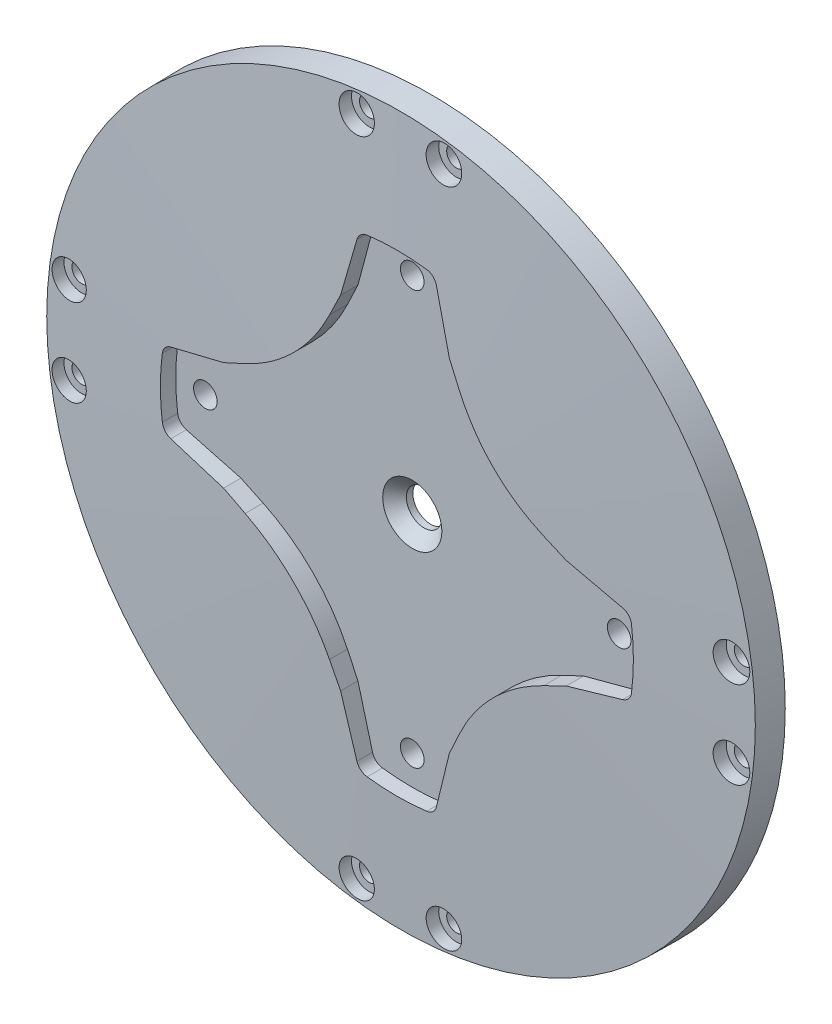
ISO-10303-21;
HEADER;
FILE_DESCRIPTION(('STEP AP214'),'2;1');
FILE_NAME('part.step','',(''),(''),'','','');
FILE_SCHEMA(('AUTOMOTIVE_DESIGN { 1 0 10303 214 1 1 1 1 }'));
ENDSEC;
DATA;
#1=APPLICATION_CONTEXT('core data for automotive mechanical design processes');
#2=APPLICATION_PROTOCOL_DEFINITION('international standard','automotive_design',2000,#1);
#3=PRODUCT_CONTEXT('',#1,'mechanical');
#4=PRODUCT('Part','Part','',(#3));
#5=PRODUCT_RELATED_PRODUCT_CATEGORY('part','',(#4));
#6=PRODUCT_DEFINITION_FORMATION('','',#4);
#7=PRODUCT_DEFINITION_CONTEXT('part definition',#1,'design');
#8=PRODUCT_DEFINITION('design','',#6,#7);
#9=PRODUCT_DEFINITION_SHAPE('','',#8);
#10=(LENGTH_UNIT() NAMED_UNIT(*) SI_UNIT(.MILLI.,.METRE.));
#11=(NAMED_UNIT(*) PLANE_ANGLE_UNIT() SI_UNIT($,.RADIAN.));
#12=(NAMED_UNIT(*) SI_UNIT($,.STERADIAN.) SOLID_ANGLE_UNIT());
#13=UNCERTAINTY_MEASURE_WITH_UNIT(LENGTH_MEASURE(1.E-05),#10,'distance_accuracy_value','');
#14=(GEOMETRIC_REPRESENTATION_CONTEXT(3) GLOBAL_UNCERTAINTY_ASSIGNED_CONTEXT((#13)) GLOBAL_UNIT_ASSIGNED_CONTEXT((#10,
#11,#12)) REPRESENTATION_CONTEXT('',''));
#15=CARTESIAN_POINT('',(0.,0.,0.));
#16=DIRECTION('',(0.,0.,1.));
#17=DIRECTION('',(1.,0.,0.));
#18=AXIS2_PLACEMENT_3D('',#15,#16,#17);
#19=CARTESIAN_POINT('',(-39.3414027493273,80.6093947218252,0.));
#20=DIRECTION('',(0.,0.,1.));
#21=DIRECTION('',(1.,0.,0.));
#22=AXIS2_PLACEMENT_3D('',#19,#20,#21);
#23=PLANE('',#22);
#24=CARTESIAN_POINT('',(20.658597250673,80.6093947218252,0.));
#25=DIRECTION('',(0.,0.,1.));
#26=DIRECTION('',(1.,0.,0.));
#27=AXIS2_PLACEMENT_3D('',#24,#25,#26);
#28=CIRCLE('',#27,3.);
#29=CARTESIAN_POINT('',(23.658597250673,80.6093947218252,0.));
#30=VERTEX_POINT('',#29);
#31=EDGE_CURVE('E1680',#30,#30,#28,.T.);
#32=ORIENTED_EDGE('',*,*,#31,.T.);
#33=EDGE_LOOP('',(#32));
#34=FACE_BOUND('',#33,.T.);
#35=CARTESIAN_POINT('',(20.658597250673,115.609394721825,0.));
#36=DIRECTION('',(0.,0.,1.));
#37=DIRECTION('',(1.,0.,0.));
#38=AXIS2_PLACEMENT_3D('',#35,#36,#37);
#39=CIRCLE('',#38,2.00000000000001);
#40=CARTESIAN_POINT('',(22.658597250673,115.609394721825,0.));
#41=VERTEX_POINT('',#40);
#42=EDGE_CURVE('E278',#41,#41,#39,.T.);
#43=ORIENTED_EDGE('',*,*,#42,.T.);
#44=EDGE_LOOP('',(#43));
#45=FACE_BOUND('',#44,.T.);
#46=CARTESIAN_POINT('',(55.658597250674,80.6093947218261,0.));
#47=DIRECTION('',(0.,0.,1.));
#48=DIRECTION('',(1.,0.,0.));
#49=AXIS2_PLACEMENT_3D('',#46,#47,#48);
#50=CIRCLE('',#49,2.00000000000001);
#51=CARTESIAN_POINT('',(57.658597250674,80.6093947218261,0.));
#52=VERTEX_POINT('',#51);
#53=EDGE_CURVE('E1690',#52,#52,#50,.T.);
#54=ORIENTED_EDGE('',*,*,#53,.T.);
#55=EDGE_LOOP('',(#54));
#56=FACE_BOUND('',#55,.T.);
#57=CARTESIAN_POINT('',(20.6585972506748,45.6093947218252,0.));
#58=DIRECTION('',(0.,0.,1.));
#59=DIRECTION('',(1.,0.,0.));
#60=AXIS2_PLACEMENT_3D('',#57,#58,#59);
#61=CIRCLE('',#60,2.);
#62=CARTESIAN_POINT('',(22.6585972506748,45.6093947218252,0.));
#63=VERTEX_POINT('',#62);
#64=EDGE_CURVE('E1696',#63,#63,#61,.T.);
#65=ORIENTED_EDGE('',*,*,#64,.T.);
#66=EDGE_LOOP('',(#65));
#67=FACE_BOUND('',#66,.T.);
#68=CARTESIAN_POINT('',(-14.341402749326,80.6093947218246,0.));
#69=DIRECTION('',(0.,0.,1.));
#70=DIRECTION('',(1.,0.,0.));
#71=AXIS2_PLACEMENT_3D('',#68,#69,#70);
#72=CIRCLE('',#71,2.00000000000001);
#73=CARTESIAN_POINT('',(-12.341402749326,80.6093947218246,0.));
#74=VERTEX_POINT('',#73);
#75=EDGE_CURVE('E284',#74,#74,#72,.T.);
#76=ORIENTED_EDGE('',*,*,#75,.T.);
#77=EDGE_LOOP('',(#76));
#78=FACE_BOUND('',#77,.T.);
#79=CARTESIAN_POINT('',(13.28386739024,136.626029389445,0.));
#80=DIRECTION('',(0.,0.,-1.));
#81=DIRECTION('',(-1.,0.,0.));
#82=AXIS2_PLACEMENT_3D('',#79,#80,#81);
#83=CIRCLE('',#82,1.65);
#84=CARTESIAN_POINT('',(11.63386739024,136.626029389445,0.));
#85=VERTEX_POINT('',#84);
#86=EDGE_CURVE('E416',#85,#85,#83,.T.);
#87=ORIENTED_EDGE('',*,*,#86,.F.);
#88=EDGE_LOOP('',(#87));
#89=FACE_BOUND('',#88,.T.);
#90=CARTESIAN_POINT('',(76.6752319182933,73.2346648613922,0.));
#91=DIRECTION('',(0.,0.,-1.));
#92=DIRECTION('',(-1.,0.,0.));
#93=AXIS2_PLACEMENT_3D('',#90,#91,#92);
#94=CIRCLE('',#93,1.65);
#95=CARTESIAN_POINT('',(75.0252319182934,73.2346648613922,0.));
#96=VERTEX_POINT('',#95);
#97=EDGE_CURVE('E419',#96,#96,#94,.T.);
#98=ORIENTED_EDGE('',*,*,#97,.F.);
#99=EDGE_LOOP('',(#98));
#100=FACE_BOUND('',#99,.T.);
#101=CARTESIAN_POINT('',(76.6752319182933,87.984124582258,0.));
#102=DIRECTION('',(0.,0.,-1.));
#103=DIRECTION('',(-1.,0.,0.));
#104=AXIS2_PLACEMENT_3D('',#101,#102,#103);
#105=CIRCLE('',#104,1.65);
#106=CARTESIAN_POINT('',(75.0252319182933,87.984124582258,0.));
#107=VERTEX_POINT('',#106);
#108=EDGE_CURVE('E422',#107,#107,#105,.T.);
#109=ORIENTED_EDGE('',*,*,#108,.F.);
#110=EDGE_LOOP('',(#109));
#111=FACE_BOUND('',#110,.T.);
#112=CARTESIAN_POINT('',(13.2838673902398,24.5927600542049,0.));
#113=DIRECTION('',(0.,0.,-1.));
#114=DIRECTION('',(-1.,0.,0.));
#115=AXIS2_PLACEMENT_3D('',#112,#113,#114);
#116=CIRCLE('',#115,1.65);
#117=CARTESIAN_POINT('',(11.6338673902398,24.5927600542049,0.));
#118=VERTEX_POINT('',#117);
#119=EDGE_CURVE('E425',#118,#118,#116,.T.);
#120=ORIENTED_EDGE('',*,*,#119,.F.);
#121=EDGE_LOOP('',(#120));
#122=FACE_BOUND('',#121,.T.);
#123=CARTESIAN_POINT('',(-35.3580374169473,87.9841245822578,0.));
#124=DIRECTION('',(0.,0.,-1.));
#125=DIRECTION('',(-1.,0.,0.));
#126=AXIS2_PLACEMENT_3D('',#123,#124,#125);
#127=CIRCLE('',#126,1.65);
#128=CARTESIAN_POINT('',(-37.0080374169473,87.9841245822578,0.));
#129=VERTEX_POINT('',#128);
#130=EDGE_CURVE('E408',#129,#129,#127,.T.);
#131=ORIENTED_EDGE('',*,*,#130,.F.);
#132=EDGE_LOOP('',(#131));
#133=FACE_BOUND('',#132,.T.);
#134=CARTESIAN_POINT('',(-35.3580374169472,73.234664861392,0.));
#135=DIRECTION('',(0.,0.,-1.));
#136=DIRECTION('',(-1.,0.,0.));
#137=AXIS2_PLACEMENT_3D('',#134,#135,#136);
#138=CIRCLE('',#137,1.65);
#139=CARTESIAN_POINT('',(-37.0080374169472,73.234664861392,0.));
#140=VERTEX_POINT('',#139);
#141=EDGE_CURVE('E411',#140,#140,#138,.T.);
#142=ORIENTED_EDGE('',*,*,#141,.F.);
#143=EDGE_LOOP('',(#142));
#144=FACE_BOUND('',#143,.T.);
#145=CARTESIAN_POINT('',(28.0333271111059,136.626029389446,0.));
#146=DIRECTION('',(0.,0.,-1.));
#147=DIRECTION('',(-1.,0.,0.));
#148=AXIS2_PLACEMENT_3D('',#145,#146,#147);
#149=CIRCLE('',#148,1.65);
#150=CARTESIAN_POINT('',(26.3833271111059,136.626029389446,0.));
#151=VERTEX_POINT('',#150);
#152=EDGE_CURVE('E413',#151,#151,#149,.T.);
#153=ORIENTED_EDGE('',*,*,#152,.F.);
#154=EDGE_LOOP('',(#153));
#155=FACE_BOUND('',#154,.T.);
#156=CARTESIAN_POINT('',(28.0333271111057,24.5927600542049,0.));
#157=DIRECTION('',(0.,0.,-1.));
#158=DIRECTION('',(-1.,0.,0.));
#159=AXIS2_PLACEMENT_3D('',#156,#157,#158);
#160=CIRCLE('',#159,1.65);
#161=CARTESIAN_POINT('',(26.3833271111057,24.5927600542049,0.));
#162=VERTEX_POINT('',#161);
#163=EDGE_CURVE('E428',#162,#162,#160,.T.);
#164=ORIENTED_EDGE('',*,*,#163,.F.);
#165=EDGE_LOOP('',(#164));
#166=FACE_BOUND('',#165,.T.);
#167=CARTESIAN_POINT('',(20.658597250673,80.6093947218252,0.));
#168=DIRECTION('',(0.,0.,-1.));
#169=DIRECTION('',(-1.,0.,0.));
#170=AXIS2_PLACEMENT_3D('',#167,#168,#169);
#171=CIRCLE('',#170,60.0000000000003);
#172=CARTESIAN_POINT('',(-39.3414027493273,80.6093947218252,0.));
#173=VERTEX_POINT('',#172);
#174=EDGE_CURVE('E433',#173,#173,#171,.T.);
#175=ORIENTED_EDGE('',*,*,#174,.T.);
#176=EDGE_LOOP('',(#175));
#177=FACE_BOUND('',#176,.T.);
#178=ADVANCED_FACE('F40',(#34,#45,#56,#67,#78,#89,#100,#111,#122,#133,#144,#155,#166,#177),#23,.F.);
#179=CARTESIAN_POINT('',(20.658597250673,80.6093947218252,7.09296047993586));
#180=DIRECTION('',(0.,0.,-1.));
#181=DIRECTION('',(-1.,0.,0.));
#182=AXIS2_PLACEMENT_3D('',#179,#180,#181);
#183=CONICAL_SURFACE('',#182,3.12250225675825E-13,1.53588974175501);
#184=CARTESIAN_POINT('',(20.658597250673,80.6093947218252,5.69612970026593));
#185=DIRECTION('',(0.,0.,-1.));
#186=DIRECTION('',(-1.,0.,0.));
#187=AXIS2_PLACEMENT_3D('',#184,#185,#186);
#188=CIRCLE('',#187,40.);
#189=CARTESIAN_POINT('',(60.3396502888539,75.5681617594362,5.69612970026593));
#190=VERTEX_POINT('',#189);
#191=CARTESIAN_POINT('',(60.3396502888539,85.6506276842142,5.69612970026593));
#192=VERTEX_POINT('',#191);
#193=EDGE_CURVE('E873',#190,#192,#188,.F.);
#194=ORIENTED_EDGE('',*,*,#193,.F.);
#195=CARTESIAN_POINT('',(60.3396502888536,75.5681617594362,5.69612970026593));
#196=CARTESIAN_POINT('',(60.332561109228,75.5123637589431,5.69612973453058));
#197=CARTESIAN_POINT('',(60.323120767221,75.4568916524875,5.69620846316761));
#198=CARTESIAN_POINT('',(60.2996059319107,75.3469418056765,5.69652268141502));
#199=CARTESIAN_POINT('',(60.2855316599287,75.2924640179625,5.69675816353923));
#200=CARTESIAN_POINT('',(60.2365131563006,75.1312066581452,5.69769776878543));
#201=CARTESIAN_POINT('',(60.1947492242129,75.0264155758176,5.69863505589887));
#202=CARTESIAN_POINT('',(60.0942393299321,74.8253458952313,5.70110881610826));
#203=CARTESIAN_POINT('',(60.0354867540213,74.7290706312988,5.70264552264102));
#204=CARTESIAN_POINT('',(59.9026576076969,74.5477350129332,5.70628048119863));
#205=CARTESIAN_POINT('',(59.828581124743,74.4626745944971,5.70837873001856));
#206=CARTESIAN_POINT('',(59.6671810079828,74.3061546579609,5.71308523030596));
#207=CARTESIAN_POINT('',(59.5798491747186,74.2347036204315,5.71569379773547));
#208=CARTESIAN_POINT('',(59.3944558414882,74.1075111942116,5.72135411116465));
#209=CARTESIAN_POINT('',(59.2964025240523,74.0517579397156,5.72440551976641));
#210=CARTESIAN_POINT('',(59.1426553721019,73.9807096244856,5.72927820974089));
#211=CARTESIAN_POINT('',(59.0898337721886,73.9589991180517,5.73096680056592));
#212=CARTESIAN_POINT('',(58.9826363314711,73.9202070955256,5.73442297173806));
#213=CARTESIAN_POINT('',(58.9282637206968,73.9031166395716,5.73619039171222));
#214=CARTESIAN_POINT('',(58.8732357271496,73.8883717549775,5.73799378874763));
#215=B_SPLINE_CURVE_WITH_KNOTS('',3,(#195,#196,#197,#198,#199,#200,#201,#202,#203,#204,#205,
#206,#207,#208,#209,#210,#211,#212,#213,#214),.UNSPECIFIED.,.F.,.F.,(4,2,2,2,2,2,2,2,2,4),(0.,
0.168635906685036,0.337263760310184,0.673959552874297,1.01078659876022,1.34761172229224,
1.68464605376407,2.02142493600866,2.19264608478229,2.36353350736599),.UNSPECIFIED.);
#216=CARTESIAN_POINT('',(58.8732357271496,73.8883717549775,5.73799378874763));
#217=VERTEX_POINT('',#216);
#218=EDGE_CURVE('E536',#190,#217,#215,.T.);
#219=ORIENTED_EDGE('',*,*,#218,.T.);
#220=CARTESIAN_POINT('',(60.1467398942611,74.2296061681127,5.69612310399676));
#221=CARTESIAN_POINT('',(59.2720212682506,73.9952260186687,5.72496928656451));
#222=CARTESIAN_POINT('',(58.3972972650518,73.7608444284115,5.75364191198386));
#223=CARTESIAN_POINT('',(56.647836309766,73.2920777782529,5.81054991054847));
#224=CARTESIAN_POINT('',(55.7730993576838,73.0576927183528,5.83878528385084));
#225=CARTESIAN_POINT('',(54.0236095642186,72.5889183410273,5.89472866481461));
#226=CARTESIAN_POINT('',(53.1488567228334,72.3545290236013,5.92243667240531));
#227=CARTESIAN_POINT('',(51.3993314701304,71.8857451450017,5.97719280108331));
#228=CARTESIAN_POINT('',(50.5245590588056,71.6513505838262,6.00424092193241));
#229=CARTESIAN_POINT('',(49.6497752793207,71.4169529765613,6.0308928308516));
#230=B_SPLINE_CURVE_WITH_KNOTS('',3,(#220,#221,#222,#223,#224,#225,#226,#227,#228,#229),
.UNSPECIFIED.,.F.,.F.,(4,2,2,2,4),(0.,2.71810406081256,5.4362071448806,8.15431059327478,
10.8724150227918),.UNSPECIFIED.);
#231=CARTESIAN_POINT('',(49.6499752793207,71.4170065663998,6.03088673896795));
#232=VERTEX_POINT('',#231);
#233=EDGE_CURVE('E439',#217,#232,#230,.T.);
#234=ORIENTED_EDGE('',*,*,#233,.T.);
#235=CARTESIAN_POINT('',(49.6501752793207,71.4171013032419,6.03088108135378));
#236=CARTESIAN_POINT('',(49.3374744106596,71.2689798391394,6.03972661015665));
#237=CARTESIAN_POINT('',(49.024771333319,71.1208573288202,6.04847690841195));
#238=CARTESIAN_POINT('',(48.3993606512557,70.8246101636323,6.06577124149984));
#239=CARTESIAN_POINT('',(48.0866530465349,70.6764855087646,6.07431527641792));
#240=CARTESIAN_POINT('',(47.4612329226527,70.3802338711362,6.09118128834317));
#241=CARTESIAN_POINT('',(47.1485204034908,70.2321068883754,6.09950326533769));
#242=CARTESIAN_POINT('',(46.5230901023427,69.9358504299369,6.11590751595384));
#243=CARTESIAN_POINT('',(46.2103723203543,69.7877209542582,6.1239897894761));
#244=CARTESIAN_POINT('',(45.8976518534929,69.6395902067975,6.13194338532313));
#245=B_SPLINE_CURVE_WITH_KNOTS('',3,(#235,#236,#237,#238,#239,#240,#241,#242,#243,#244),
.UNSPECIFIED.,.F.,.F.,(4,2,2,2,4),(0.,1.03836429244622,2.07672815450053,3.11509207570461,
4.153456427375),.UNSPECIFIED.);
#246=CARTESIAN_POINT('',(45.8978518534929,69.6396849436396,6.13193829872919));
#247=VERTEX_POINT('',#246);
#248=EDGE_CURVE('E858',#232,#247,#245,.T.);
#249=ORIENTED_EDGE('',*,*,#248,.T.);
#250=CARTESIAN_POINT('',(31.6282122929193,55.3699401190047,6.13193321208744));
#251=CARTESIAN_POINT('',(31.8109965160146,55.755823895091,6.14174692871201));
#252=CARTESIAN_POINT('',(32.002000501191,56.1377653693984,6.15112439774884));
#253=CARTESIAN_POINT('',(32.4001437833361,56.8931692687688,6.16890816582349));
#254=CARTESIAN_POINT('',(32.6072831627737,57.266631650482,6.17731445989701));
#255=CARTESIAN_POINT('',(33.2523072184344,58.3731660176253,6.20092337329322));
#256=CARTESIAN_POINT('',(33.7139154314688,59.0926334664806,6.21452244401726));
#257=CARTESIAN_POINT('',(34.6829478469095,60.4698483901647,6.23637531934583));
#258=CARTESIAN_POINT('',(35.1887165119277,61.1287631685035,6.24476881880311));
#259=CARTESIAN_POINT('',(36.2531641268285,62.4024345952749,6.25630144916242));
#260=CARTESIAN_POINT('',(36.8118420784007,63.0171920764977,6.25944067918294));
#261=CARTESIAN_POINT('',(37.9995652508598,64.2198543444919,6.26027270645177));
#262=CARTESIAN_POINT('',(38.6304349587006,64.8059590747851,6.25776245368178));
#263=CARTESIAN_POINT('',(39.9401868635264,65.9217960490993,6.24705038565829));
#264=CARTESIAN_POINT('',(40.6190730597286,66.4515235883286,6.23884809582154));
#265=CARTESIAN_POINT('',(42.0409630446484,67.4657205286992,6.2169595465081));
#266=CARTESIAN_POINT('',(42.7852799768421,67.9483534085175,6.20311601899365));
#267=CARTESIAN_POINT('',(43.9313246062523,68.6213534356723,6.17887003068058));
#268=CARTESIAN_POINT('',(44.3183268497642,68.8372232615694,6.17020638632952));
#269=CARTESIAN_POINT('',(45.1014878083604,69.2516048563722,6.15182944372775));
#270=CARTESIAN_POINT('',(45.4976464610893,69.4501167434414,6.14211615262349));
#271=CARTESIAN_POINT('',(45.8980518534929,69.6397796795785,6.13193321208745));
#272=B_SPLINE_CURVE_WITH_KNOTS('',3,(#250,#251,#252,#253,#254,#255,#256,#257,#258,#259,#260,
#261,#262,#263,#264,#265,#266,#267,#268,#269,#270,#271),.UNSPECIFIED.,.F.,.F.,(4,2,2,2,2,2,2,2,
2,2,4),(0.,1.28108814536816,2.56218283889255,5.1235506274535,7.61281489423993,10.1020322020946,
12.6821379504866,15.2624588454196,17.9202570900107,19.2495477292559,20.5788293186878),.UNSPECIFIED.);
#273=CARTESIAN_POINT('',(31.6283070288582,55.3701401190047,6.13193829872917));
#274=VERTEX_POINT('',#273);
#275=EDGE_CURVE('E255',#274,#247,#272,.T.);
#276=ORIENTED_EDGE('',*,*,#275,.F.);
#277=CARTESIAN_POINT('',(31.6284017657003,55.3703401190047,6.13194338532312));
#278=CARTESIAN_POINT('',(31.4802710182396,55.0576196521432,6.12398978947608));
#279=CARTESIAN_POINT('',(31.3321415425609,54.7449018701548,6.11590751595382));
#280=CARTESIAN_POINT('',(31.0358850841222,54.1194715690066,6.09950326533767));
#281=CARTESIAN_POINT('',(30.8877581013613,53.8067590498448,6.09118128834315));
#282=CARTESIAN_POINT('',(30.5915064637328,53.1813389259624,6.0743152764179));
#283=CARTESIAN_POINT('',(30.443381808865,52.8686313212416,6.06577124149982));
#284=CARTESIAN_POINT('',(30.1471346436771,52.2432206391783,6.04847690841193));
#285=CARTESIAN_POINT('',(29.9990121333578,51.9305175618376,6.03972661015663));
#286=CARTESIAN_POINT('',(29.8508906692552,51.6178166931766,6.03088108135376));
#287=B_SPLINE_CURVE_WITH_KNOTS('',3,(#277,#278,#279,#280,#281,#282,#283,#284,#285,#286),
.UNSPECIFIED.,.F.,.F.,(4,2,2,2,4),(0.,1.03836435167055,2.07672827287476,3.11509213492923,
4.15345642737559),.UNSPECIFIED.);
#288=CARTESIAN_POINT('',(29.8509854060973,51.6180166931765,6.03088673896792));
#289=VERTEX_POINT('',#288);
#290=EDGE_CURVE('E831',#274,#289,#287,.T.);
#291=ORIENTED_EDGE('',*,*,#290,.T.);
#292=CARTESIAN_POINT('',(27.0383858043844,41.1212520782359,5.69612310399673));
#293=CARTESIAN_POINT('',(27.2727659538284,41.9959707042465,5.72496928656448));
#294=CARTESIAN_POINT('',(27.5071475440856,42.8706947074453,5.75364191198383));
#295=CARTESIAN_POINT('',(27.9759141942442,44.6201556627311,5.81054991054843));
#296=CARTESIAN_POINT('',(28.2102992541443,45.4948926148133,5.83878528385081));
#297=CARTESIAN_POINT('',(28.6790736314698,47.2443824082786,5.89472866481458));
#298=CARTESIAN_POINT('',(28.9134629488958,48.1191352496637,5.92243667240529));
#299=CARTESIAN_POINT('',(29.3822468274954,49.8686605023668,5.97719280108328));
#300=CARTESIAN_POINT('',(29.616641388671,50.7434329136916,6.00424092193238));
#301=CARTESIAN_POINT('',(29.8510389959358,51.6182166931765,6.03089283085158));
#302=B_SPLINE_CURVE_WITH_KNOTS('',3,(#292,#293,#294,#295,#296,#297,#298,#299,#300,#301),
.UNSPECIFIED.,.F.,.F.,(4,2,2,2,4),(0.,2.71810406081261,5.4362071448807,8.15431059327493,
10.872415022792),.UNSPECIFIED.);
#303=CARTESIAN_POINT('',(27.3796202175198,42.3947562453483,5.73799378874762));
#304=VERTEX_POINT('',#303);
#305=EDGE_CURVE('E825',#304,#289,#302,.T.);
#306=ORIENTED_EDGE('',*,*,#305,.F.);
#307=CARTESIAN_POINT('',(27.3796202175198,42.3947562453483,5.73799378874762));
#308=CARTESIAN_POINT('',(27.3650565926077,42.3404056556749,5.73621259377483));
#309=CARTESIAN_POINT('',(27.3482053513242,42.2866947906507,5.73446650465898));
#310=CARTESIAN_POINT('',(27.31004060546,42.1808826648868,5.73105429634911));
#311=CARTESIAN_POINT('',(27.2887272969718,42.1287813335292,5.7293881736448));
#312=CARTESIAN_POINT('',(27.2183378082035,41.9755458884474,5.72452942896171));
#313=CARTESIAN_POINT('',(27.1627639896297,41.877301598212,5.72147058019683));
#314=CARTESIAN_POINT('',(27.0359088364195,41.6915405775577,5.71579608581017));
#315=CARTESIAN_POINT('',(26.9646211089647,41.604028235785,5.71318062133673));
#316=CARTESIAN_POINT('',(26.8083433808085,41.4421975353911,5.70845847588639));
#317=CARTESIAN_POINT('',(26.7233535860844,41.3678789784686,5.70635178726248));
#318=CARTESIAN_POINT('',(26.5421098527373,41.2345736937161,5.70270051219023));
#319=CARTESIAN_POINT('',(26.4458560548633,41.1755867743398,5.70115591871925));
#320=CARTESIAN_POINT('',(26.2448221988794,41.0746434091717,5.69866763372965));
#321=CARTESIAN_POINT('',(26.1400487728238,41.0326738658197,5.69772347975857));
#322=CARTESIAN_POINT('',(25.9782197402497,40.9831800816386,5.69677060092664));
#323=CARTESIAN_POINT('',(25.9231529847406,40.9688810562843,5.6965301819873));
#324=CARTESIAN_POINT('',(25.8121100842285,40.9450432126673,5.69620990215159));
#325=CARTESIAN_POINT('',(25.7561359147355,40.9354951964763,5.69612973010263));
#326=CARTESIAN_POINT('',(25.6998302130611,40.9283416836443,5.69612970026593));
#327=B_SPLINE_CURVE_WITH_KNOTS('',3,(#307,#308,#309,#310,#311,#312,#313,#314,#315,#316,#317,
#318,#319,#320,#321,#322,#323,#324,#325,#326),.UNSPECIFIED.,.F.,.F.,(4,2,2,2,2,2,2,2,2,4),(0.,
0.168784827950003,0.337562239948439,0.674568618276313,1.01171235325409,1.34885102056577,
1.68598547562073,2.02285995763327,2.19336092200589,2.3635305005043),.UNSPECIFIED.);
#328=CARTESIAN_POINT('',(25.6998302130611,40.9283416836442,5.69612970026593));
#329=VERTEX_POINT('',#328);
#330=EDGE_CURVE('E550',#304,#329,#327,.T.);
#331=ORIENTED_EDGE('',*,*,#330,.T.);
#332=CARTESIAN_POINT('',(20.658597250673,80.6093947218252,5.69612970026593));
#333=DIRECTION('',(0.,0.,-1.));
#334=DIRECTION('',(-1.,0.,0.));
#335=AXIS2_PLACEMENT_3D('',#332,#333,#334);
#336=CIRCLE('',#335,40.);
#337=CARTESIAN_POINT('',(15.6173642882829,40.9283416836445,5.69612970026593));
#338=VERTEX_POINT('',#337);
#339=EDGE_CURVE('E822',#338,#329,#336,.F.);
#340=ORIENTED_EDGE('',*,*,#339,.F.);
#341=CARTESIAN_POINT('',(15.6173642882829,40.9283416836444,5.69612970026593));
#342=CARTESIAN_POINT('',(15.5615662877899,40.93543086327,5.69612973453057));
#343=CARTESIAN_POINT('',(15.5060941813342,40.944871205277,5.6962084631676));
#344=CARTESIAN_POINT('',(15.3961443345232,40.9683860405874,5.696522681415));
#345=CARTESIAN_POINT('',(15.3416665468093,40.9824603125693,5.69675816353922));
#346=CARTESIAN_POINT('',(15.1804091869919,41.0314788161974,5.69769776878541));
#347=CARTESIAN_POINT('',(15.0756181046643,41.0732427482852,5.69863505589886));
#348=CARTESIAN_POINT('',(14.874548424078,41.1737526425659,5.70110881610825));
#349=CARTESIAN_POINT('',(14.7782731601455,41.2325052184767,5.70264552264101));
#350=CARTESIAN_POINT('',(14.59693754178,41.3653343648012,5.70628048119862));
#351=CARTESIAN_POINT('',(14.5118771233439,41.4394108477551,5.70837873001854));
#352=CARTESIAN_POINT('',(14.3553571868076,41.6008109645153,5.71308523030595));
#353=CARTESIAN_POINT('',(14.2839061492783,41.6881427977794,5.71569379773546));
#354=CARTESIAN_POINT('',(14.1567137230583,41.8735361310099,5.72135411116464));
#355=CARTESIAN_POINT('',(14.1009604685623,41.9715894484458,5.7244055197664));
#356=CARTESIAN_POINT('',(14.0299121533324,42.1253366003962,5.72927820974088));
#357=CARTESIAN_POINT('',(14.0082016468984,42.1781582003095,5.73096680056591));
#358=CARTESIAN_POINT('',(13.9694096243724,42.285355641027,5.73442297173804));
#359=CARTESIAN_POINT('',(13.9523191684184,42.3397282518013,5.7361903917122));
#360=CARTESIAN_POINT('',(13.9375742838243,42.3947562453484,5.73799378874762));
#361=B_SPLINE_CURVE_WITH_KNOTS('',3,(#341,#342,#343,#344,#345,#346,#347,#348,#349,#350,#351,
#352,#353,#354,#355,#356,#357,#358,#359,#360),.UNSPECIFIED.,.F.,.F.,(4,2,2,2,2,2,2,2,2,4),(0.,
0.168635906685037,0.337263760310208,0.673959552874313,1.01078659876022,1.34761172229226,
1.68464605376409,2.02142493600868,2.1926460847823,2.36353350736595),.UNSPECIFIED.);
#362=CARTESIAN_POINT('',(13.9375742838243,42.3947562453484,5.73799378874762));
#363=VERTEX_POINT('',#362);
#364=EDGE_CURVE('E574',#338,#363,#361,.T.);
#365=ORIENTED_EDGE('',*,*,#364,.T.);
#366=CARTESIAN_POINT('',(14.2788086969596,41.1212520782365,5.69612310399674));
#367=CARTESIAN_POINT('',(14.0444285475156,41.9959707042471,5.72496928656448));
#368=CARTESIAN_POINT('',(13.8100469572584,42.8706947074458,5.75364191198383));
#369=CARTESIAN_POINT('',(13.3412803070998,44.6201556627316,5.81054991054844));
#370=CARTESIAN_POINT('',(13.1068952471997,45.4948926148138,5.83878528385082));
#371=CARTESIAN_POINT('',(12.6381208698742,47.2443824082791,5.89472866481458));
#372=CARTESIAN_POINT('',(12.4037315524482,48.1191352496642,5.92243667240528));
#373=CARTESIAN_POINT('',(11.9349476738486,49.8686605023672,5.97719280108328));
#374=CARTESIAN_POINT('',(11.7005531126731,50.7434329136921,6.00424092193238));
#375=CARTESIAN_POINT('',(11.4661555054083,51.6182166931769,6.03089283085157));
#376=B_SPLINE_CURVE_WITH_KNOTS('',3,(#366,#367,#368,#369,#370,#371,#372,#373,#374,#375),
.UNSPECIFIED.,.F.,.F.,(4,2,2,2,4),(0.,2.71810406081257,5.4362071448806,8.15431059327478,
10.8724150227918),.UNSPECIFIED.);
#377=CARTESIAN_POINT('',(11.4662090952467,51.6180166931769,6.03088673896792));
#378=VERTEX_POINT('',#377);
#379=EDGE_CURVE('E816',#363,#378,#376,.T.);
#380=ORIENTED_EDGE('',*,*,#379,.T.);
#381=CARTESIAN_POINT('',(11.4663038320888,51.6178166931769,6.03088108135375));
#382=CARTESIAN_POINT('',(11.3181823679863,51.930517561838,6.03972661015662));
#383=CARTESIAN_POINT('',(11.1700598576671,52.2432206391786,6.04847690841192));
#384=CARTESIAN_POINT('',(10.8738126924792,52.868631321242,6.06577124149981));
#385=CARTESIAN_POINT('',(10.7256880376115,53.1813389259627,6.07431527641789));
#386=CARTESIAN_POINT('',(10.4294363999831,53.806759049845,6.09118128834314));
#387=CARTESIAN_POINT('',(10.2813094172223,54.1194715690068,6.09950326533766));
#388=CARTESIAN_POINT('',(9.98505295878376,54.744901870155,6.11590751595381));
#389=CARTESIAN_POINT('',(9.83692348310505,55.0576196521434,6.12398978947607));
#390=CARTESIAN_POINT('',(9.68879273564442,55.3703401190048,6.1319433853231));
#391=B_SPLINE_CURVE_WITH_KNOTS('',3,(#381,#382,#383,#384,#385,#386,#387,#388,#389,#390),
.UNSPECIFIED.,.F.,.F.,(4,2,2,2,4),(0.,1.03836429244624,2.07672815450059,3.11509207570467,
4.1534564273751),.UNSPECIFIED.);
#392=CARTESIAN_POINT('',(9.68888747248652,55.3701401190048,6.13193829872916));
#393=VERTEX_POINT('',#392);
#394=EDGE_CURVE('E809',#378,#393,#391,.T.);
#395=ORIENTED_EDGE('',*,*,#394,.T.);
#396=CARTESIAN_POINT('',(-4.58085735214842,69.6397796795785,6.1319332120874));
#397=CARTESIAN_POINT('',(-4.1949735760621,69.4569954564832,6.14174692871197));
#398=CARTESIAN_POINT('',(-3.81303210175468,69.2659914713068,6.15112439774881));
#399=CARTESIAN_POINT('',(-3.05762820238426,68.8678481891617,6.16890816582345));
#400=CARTESIAN_POINT('',(-2.68416582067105,68.6607088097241,6.17731445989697));
#401=CARTESIAN_POINT('',(-1.57763145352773,68.0156847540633,6.20092337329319));
#402=CARTESIAN_POINT('',(-0.858164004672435,67.554076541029,6.21452244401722));
#403=CARTESIAN_POINT('',(0.51905091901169,66.5850441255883,6.2363753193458));
#404=CARTESIAN_POINT('',(1.17796569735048,66.0792754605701,6.24476881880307));
#405=CARTESIAN_POINT('',(2.45163712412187,65.0148278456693,6.25630144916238));
#406=CARTESIAN_POINT('',(3.06639460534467,64.456149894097,6.25944067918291));
#407=CARTESIAN_POINT('',(4.2690568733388,63.2684267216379,6.26027270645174));
#408=CARTESIAN_POINT('',(4.85516160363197,62.6375570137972,6.25776245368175));
#409=CARTESIAN_POINT('',(5.97099857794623,61.3278051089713,6.24705038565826));
#410=CARTESIAN_POINT('',(6.50072611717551,60.6489189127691,6.23884809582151));
#411=CARTESIAN_POINT('',(7.5149230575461,59.2270289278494,6.21695954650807));
#412=CARTESIAN_POINT('',(7.99755593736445,58.4827119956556,6.20311601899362));
#413=CARTESIAN_POINT('',(8.67055596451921,57.3366673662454,6.17887003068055));
#414=CARTESIAN_POINT('',(8.88642579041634,56.9496651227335,6.17020638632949));
#415=CARTESIAN_POINT('',(9.30080738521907,56.1665041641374,6.15182944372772));
#416=CARTESIAN_POINT('',(9.49931927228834,55.7703455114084,6.14211615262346));
#417=CARTESIAN_POINT('',(9.68898220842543,55.3699401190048,6.13193321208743));
#418=B_SPLINE_CURVE_WITH_KNOTS('',3,(#396,#397,#398,#399,#400,#401,#402,#403,#404,#405,#406,
#407,#408,#409,#410,#411,#412,#413,#414,#415,#416,#417),.UNSPECIFIED.,.F.,.F.,(4,2,2,2,2,2,2,2,
2,2,4),(0.,1.28108814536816,2.56218283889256,5.12355062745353,7.61281489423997,10.1020322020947,
12.6821379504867,15.2624588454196,17.9202570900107,19.2495477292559,20.5788293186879),.UNSPECIFIED.);
#419=CARTESIAN_POINT('',(-4.58065735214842,69.6396849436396,6.13193829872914));
#420=VERTEX_POINT('',#419);
#421=EDGE_CURVE('E785',#420,#393,#418,.T.);
#422=ORIENTED_EDGE('',*,*,#421,.F.);
#423=CARTESIAN_POINT('',(-4.58045735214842,69.6395902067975,6.13194338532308));
#424=CARTESIAN_POINT('',(-4.89317781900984,69.7877209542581,6.12398978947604));
#425=CARTESIAN_POINT('',(-5.20589560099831,69.9358504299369,6.11590751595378));
#426=CARTESIAN_POINT('',(-5.83132590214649,70.2321068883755,6.09950326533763));
#427=CARTESIAN_POINT('',(-6.14403842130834,70.3802338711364,6.09118128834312));
#428=CARTESIAN_POINT('',(-6.76945854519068,70.6764855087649,6.07431527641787));
#429=CARTESIAN_POINT('',(-7.08216614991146,70.8246101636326,6.06577124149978));
#430=CARTESIAN_POINT('',(-7.70757683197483,71.1208573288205,6.04847690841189));
#431=CARTESIAN_POINT('',(-8.02027990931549,71.2689798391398,6.03972661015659));
#432=CARTESIAN_POINT('',(-8.33298077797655,71.4171013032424,6.03088108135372));
#433=B_SPLINE_CURVE_WITH_KNOTS('',3,(#423,#424,#425,#426,#427,#428,#429,#430,#431,#432),
.UNSPECIFIED.,.F.,.F.,(4,2,2,2,4),(0.,1.03836435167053,2.07672827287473,3.11509213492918,
4.15345642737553),.UNSPECIFIED.);
#434=CARTESIAN_POINT('',(-8.33278077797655,71.4170065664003,6.03088673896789));
#435=VERTEX_POINT('',#434);
#436=EDGE_CURVE('E778',#420,#435,#433,.T.);
#437=ORIENTED_EDGE('',*,*,#436,.T.);
#438=CARTESIAN_POINT('',(-18.8295453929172,74.2296061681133,5.69612310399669));
#439=CARTESIAN_POINT('',(-17.9548267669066,73.9952260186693,5.72496928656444));
#440=CARTESIAN_POINT('',(-17.0801027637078,73.760844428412,5.75364191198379));
#441=CARTESIAN_POINT('',(-15.330641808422,73.2920777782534,5.8105499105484));
#442=CARTESIAN_POINT('',(-14.4559048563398,73.0576927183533,5.83878528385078));
#443=CARTESIAN_POINT('',(-12.7064150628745,72.5889183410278,5.89472866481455));
#444=CARTESIAN_POINT('',(-11.8316622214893,72.3545290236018,5.92243667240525));
#445=CARTESIAN_POINT('',(-10.0821369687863,71.8857451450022,5.97719280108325));
#446=CARTESIAN_POINT('',(-9.20736455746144,71.6513505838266,6.00424092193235));
#447=CARTESIAN_POINT('',(-8.33258077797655,71.4169529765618,6.03089283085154));
#448=B_SPLINE_CURVE_WITH_KNOTS('',3,(#438,#439,#440,#441,#442,#443,#444,#445,#446,#447),
.UNSPECIFIED.,.F.,.F.,(4,2,2,2,4),(0.,2.71810406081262,5.4362071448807,8.15431059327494,
10.872415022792),.UNSPECIFIED.);
#449=CARTESIAN_POINT('',(-17.5560412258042,73.8883717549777,5.73799378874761));
#450=VERTEX_POINT('',#449);
#451=EDGE_CURVE('E772',#450,#435,#448,.T.);
#452=ORIENTED_EDGE('',*,*,#451,.F.);
#453=CARTESIAN_POINT('',(-17.5560412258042,73.8883717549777,5.73799378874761));
#454=CARTESIAN_POINT('',(-17.6103918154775,73.9029353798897,5.73621259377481));
#455=CARTESIAN_POINT('',(-17.6641026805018,73.9197866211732,5.73446650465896));
#456=CARTESIAN_POINT('',(-17.7699148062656,73.9579513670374,5.7310542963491));
#457=CARTESIAN_POINT('',(-17.8220161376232,73.9792646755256,5.72938817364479));
#458=CARTESIAN_POINT('',(-17.975251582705,74.049654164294,5.7245294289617));
#459=CARTESIAN_POINT('',(-18.0734958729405,74.1052279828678,5.72147058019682));
#460=CARTESIAN_POINT('',(-18.2592568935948,74.232083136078,5.71579608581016));
#461=CARTESIAN_POINT('',(-18.3467692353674,74.3033708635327,5.71318062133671));
#462=CARTESIAN_POINT('',(-18.5085999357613,74.4596485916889,5.70845847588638));
#463=CARTESIAN_POINT('',(-18.5829184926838,74.544638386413,5.70635178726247));
#464=CARTESIAN_POINT('',(-18.7162237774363,74.7258821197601,5.70270051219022));
#465=CARTESIAN_POINT('',(-18.7752106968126,74.8221359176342,5.70115591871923));
#466=CARTESIAN_POINT('',(-18.8761540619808,75.0231697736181,5.69866763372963));
#467=CARTESIAN_POINT('',(-18.9181236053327,75.1279431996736,5.69772347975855));
#468=CARTESIAN_POINT('',(-18.9676173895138,75.2897722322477,5.69677060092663));
#469=CARTESIAN_POINT('',(-18.9819164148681,75.3448389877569,5.69653018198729));
#470=CARTESIAN_POINT('',(-19.0057542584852,75.4558818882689,5.69620990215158));
#471=CARTESIAN_POINT('',(-19.0153022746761,75.5118560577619,5.69612973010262));
#472=CARTESIAN_POINT('',(-19.0224557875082,75.5681617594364,5.69612970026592));
#473=B_SPLINE_CURVE_WITH_KNOTS('',3,(#453,#454,#455,#456,#457,#458,#459,#460,#461,#462,#463,
#464,#465,#466,#467,#468,#469,#470,#471,#472),.UNSPECIFIED.,.F.,.F.,(4,2,2,2,2,2,2,2,2,4),(0.,
0.168784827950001,0.337562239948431,0.674568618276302,1.01171235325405,1.34885102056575,
1.68598547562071,2.02285995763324,2.19336092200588,2.36353050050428),.UNSPECIFIED.);
#474=CARTESIAN_POINT('',(-19.0224557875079,75.5681617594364,5.69612970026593));
#475=VERTEX_POINT('',#474);
#476=EDGE_CURVE('E544',#450,#475,#473,.T.);
#477=ORIENTED_EDGE('',*,*,#476,.T.);
#478=CARTESIAN_POINT('',(20.658597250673,80.6093947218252,5.69612970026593));
#479=DIRECTION('',(0.,0.,-1.));
#480=DIRECTION('',(-1.,0.,0.));
#481=AXIS2_PLACEMENT_3D('',#478,#479,#480);
#482=CIRCLE('',#481,40.);
#483=CARTESIAN_POINT('',(-19.0224557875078,85.6506276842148,5.69612970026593));
#484=VERTEX_POINT('',#483);
#485=EDGE_CURVE('E769',#484,#475,#482,.F.);
#486=ORIENTED_EDGE('',*,*,#485,.F.);
#487=CARTESIAN_POINT('',(-19.0224557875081,85.6506276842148,5.69612970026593));
#488=CARTESIAN_POINT('',(-19.0153666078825,85.7064256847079,5.69612973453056));
#489=CARTESIAN_POINT('',(-19.0059262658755,85.7618977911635,5.69620846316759));
#490=CARTESIAN_POINT('',(-18.9824114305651,85.8718476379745,5.69652268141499));
#491=CARTESIAN_POINT('',(-18.9683371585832,85.9263254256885,5.69675816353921));
#492=CARTESIAN_POINT('',(-18.9193186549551,86.0875827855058,5.6976977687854));
#493=CARTESIAN_POINT('',(-18.8775547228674,86.1923738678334,5.69863505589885));
#494=CARTESIAN_POINT('',(-18.7770448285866,86.3934435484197,5.70110881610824));
#495=CARTESIAN_POINT('',(-18.7182922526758,86.4897188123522,5.702645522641));
#496=CARTESIAN_POINT('',(-18.5854631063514,86.6710544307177,5.70628048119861));
#497=CARTESIAN_POINT('',(-18.5113866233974,86.7561148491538,5.70837873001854));
#498=CARTESIAN_POINT('',(-18.3499865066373,86.9126347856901,5.71308523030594));
#499=CARTESIAN_POINT('',(-18.2626546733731,86.9840858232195,5.71569379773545));
#500=CARTESIAN_POINT('',(-18.0772613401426,87.1112782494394,5.72135411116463));
#501=CARTESIAN_POINT('',(-17.9792080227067,87.1670315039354,5.72440551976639));
#502=CARTESIAN_POINT('',(-17.8254608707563,87.2380798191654,5.72927820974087));
#503=CARTESIAN_POINT('',(-17.772639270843,87.2597903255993,5.7309668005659));
#504=CARTESIAN_POINT('',(-17.6654418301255,87.2985823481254,5.73442297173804));
#505=CARTESIAN_POINT('',(-17.6110692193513,87.3156728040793,5.73619039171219));
#506=CARTESIAN_POINT('',(-17.5560412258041,87.3304176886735,5.73799378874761));
#507=B_SPLINE_CURVE_WITH_KNOTS('',3,(#487,#488,#489,#490,#491,#492,#493,#494,#495,#496,#497,
#498,#499,#500,#501,#502,#503,#504,#505,#506),.UNSPECIFIED.,.F.,.F.,(4,2,2,2,2,2,2,2,2,4),(0.,
0.16863590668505,0.337263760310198,0.673959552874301,1.01078659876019,1.34761172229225,
1.68464605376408,2.02142493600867,2.19264608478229,2.36353350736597),.UNSPECIFIED.);
#508=CARTESIAN_POINT('',(-17.5560412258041,87.3304176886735,5.73799378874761));
#509=VERTEX_POINT('',#508);
#510=EDGE_CURVE('E580',#484,#509,#507,.T.);
#511=ORIENTED_EDGE('',*,*,#510,.T.);
#512=CARTESIAN_POINT('',(-18.8295453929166,86.989183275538,5.69612310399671));
#513=CARTESIAN_POINT('',(-17.954826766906,87.223563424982,5.72496928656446));
#514=CARTESIAN_POINT('',(-17.0801027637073,87.4579450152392,5.75364191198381));
#515=CARTESIAN_POINT('',(-15.3306418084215,87.9267116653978,5.81054991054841));
#516=CARTESIAN_POINT('',(-14.4559048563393,88.1610967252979,5.83878528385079));
#517=CARTESIAN_POINT('',(-12.706415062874,88.6298711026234,5.89472866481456));
#518=CARTESIAN_POINT('',(-11.8316622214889,88.8642604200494,5.92243667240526));
#519=CARTESIAN_POINT('',(-10.0821369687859,89.333044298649,5.97719280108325));
#520=CARTESIAN_POINT('',(-9.20736455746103,89.5674388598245,6.00424092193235));
#521=CARTESIAN_POINT('',(-8.33258077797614,89.8018364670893,6.03089283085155));
#522=B_SPLINE_CURVE_WITH_KNOTS('',3,(#512,#513,#514,#515,#516,#517,#518,#519,#520,#521),
.UNSPECIFIED.,.F.,.F.,(4,2,2,2,4),(0.,2.71810406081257,5.4362071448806,8.15431059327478,
10.8724150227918),.UNSPECIFIED.);
#523=CARTESIAN_POINT('',(-8.33278077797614,89.8017828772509,6.03088673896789));
#524=VERTEX_POINT('',#523);
#525=EDGE_CURVE('E763',#509,#524,#522,.T.);
#526=ORIENTED_EDGE('',*,*,#525,.T.);
#527=CARTESIAN_POINT('',(-8.33298077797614,89.8016881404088,6.03088108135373));
#528=CARTESIAN_POINT('',(-8.02027990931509,89.9498096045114,6.0397266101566));
#529=CARTESIAN_POINT('',(-7.70757683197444,90.0979321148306,6.0484769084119));
#530=CARTESIAN_POINT('',(-7.08216614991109,90.3941792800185,6.06577124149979));
#531=CARTESIAN_POINT('',(-6.76945854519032,90.5423039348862,6.07431527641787));
#532=CARTESIAN_POINT('',(-6.14403842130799,90.8385555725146,6.09118128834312));
#533=CARTESIAN_POINT('',(-5.83132590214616,90.9866825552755,6.09950326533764));
#534=CARTESIAN_POINT('',(-5.205895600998,91.282939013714,6.11590751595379));
#535=CARTESIAN_POINT('',(-4.89317781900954,91.4310684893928,6.12398978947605));
#536=CARTESIAN_POINT('',(-4.58045735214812,91.5791992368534,6.13194338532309));
#537=B_SPLINE_CURVE_WITH_KNOTS('',3,(#527,#528,#529,#530,#531,#532,#533,#534,#535,#536),
.UNSPECIFIED.,.F.,.F.,(4,2,2,2,4),(0.,1.03836429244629,2.07672815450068,3.11509207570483,
4.15345642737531),.UNSPECIFIED.);
#538=CARTESIAN_POINT('',(-4.58065735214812,91.5791045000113,6.13193829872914));
#539=VERTEX_POINT('',#538);
#540=EDGE_CURVE('E738',#524,#539,#537,.T.);
#541=ORIENTED_EDGE('',*,*,#540,.T.);
#542=CARTESIAN_POINT('',(9.68898220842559,105.848849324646,6.13193321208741));
#543=CARTESIAN_POINT('',(9.50619798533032,105.46296554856,6.14174692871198));
#544=CARTESIAN_POINT('',(9.31519400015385,105.081024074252,6.15112439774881));
#545=CARTESIAN_POINT('',(8.91705071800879,104.325620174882,6.16890816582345));
#546=CARTESIAN_POINT('',(8.70991133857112,103.952157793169,6.17731445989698));
#547=CARTESIAN_POINT('',(8.06488728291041,102.845623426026,6.20092337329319));
#548=CARTESIAN_POINT('',(7.60327906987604,102.12615597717,6.21452244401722));
#549=CARTESIAN_POINT('',(6.63424665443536,100.748941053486,6.2363753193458));
#550=CARTESIAN_POINT('',(6.12847798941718,100.090026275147,6.24476881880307));
#551=CARTESIAN_POINT('',(5.06403037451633,98.816354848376,6.25630144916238));
#552=CARTESIAN_POINT('',(4.50535242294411,98.2015973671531,6.2594406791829));
#553=CARTESIAN_POINT('',(3.31762925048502,96.998935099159,6.26027270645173));
#554=CARTESIAN_POINT('',(2.68675954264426,96.4128303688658,6.25776245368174));
#555=CARTESIAN_POINT('',(1.37700763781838,95.2969933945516,6.24705038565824));
#556=CARTESIAN_POINT('',(0.698121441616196,94.7672658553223,6.2388480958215));
#557=CARTESIAN_POINT('',(-0.723768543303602,93.7530689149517,6.21695954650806));
#558=CARTESIAN_POINT('',(-1.46808547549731,93.2704360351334,6.20311601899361));
#559=CARTESIAN_POINT('',(-2.61413010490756,92.5974360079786,6.17887003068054));
#560=CARTESIAN_POINT('',(-3.00113234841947,92.3815661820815,6.17020638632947));
#561=CARTESIAN_POINT('',(-3.78429330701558,91.9671845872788,6.1518294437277));
#562=CARTESIAN_POINT('',(-4.18045195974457,91.7686727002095,6.14211615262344));
#563=CARTESIAN_POINT('',(-4.58085735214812,91.5790097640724,6.13193321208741));
#564=B_SPLINE_CURVE_WITH_KNOTS('',3,(#542,#543,#544,#545,#546,#547,#548,#549,#550,#551,#552,
#553,#554,#555,#556,#557,#558,#559,#560,#561,#562,#563),.UNSPECIFIED.,.F.,.F.,(4,2,2,2,2,2,2,2,
2,2,4),(0.,1.28108814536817,2.56218283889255,5.12355062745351,7.61281489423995,10.1020322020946,
12.6821379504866,15.2624588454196,17.9202570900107,19.2495477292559,20.5788293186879),.UNSPECIFIED.);
#565=CARTESIAN_POINT('',(9.68888747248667,105.848649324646,6.13193829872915));
#566=VERTEX_POINT('',#565);
#567=EDGE_CURVE('E732',#566,#539,#564,.T.);
#568=ORIENTED_EDGE('',*,*,#567,.F.);
#569=CARTESIAN_POINT('',(9.68879273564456,105.848449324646,6.13194338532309));
#570=CARTESIAN_POINT('',(9.83692348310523,106.161169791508,6.12398978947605));
#571=CARTESIAN_POINT('',(9.98505295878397,106.473887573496,6.11590751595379));
#572=CARTESIAN_POINT('',(10.2813094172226,107.099317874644,6.09950326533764));
#573=CARTESIAN_POINT('',(10.4294363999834,107.412030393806,6.09118128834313));
#574=CARTESIAN_POINT('',(10.7256880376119,108.037450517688,6.07431527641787));
#575=CARTESIAN_POINT('',(10.8738126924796,108.350158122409,6.06577124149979));
#576=CARTESIAN_POINT('',(11.1700598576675,108.975568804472,6.0484769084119));
#577=CARTESIAN_POINT('',(11.3181823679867,109.288271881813,6.0397266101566));
#578=CARTESIAN_POINT('',(11.4663038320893,109.600972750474,6.03088108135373));
#579=B_SPLINE_CURVE_WITH_KNOTS('',3,(#569,#570,#571,#572,#573,#574,#575,#576,#577,#578),
.UNSPECIFIED.,.F.,.F.,(4,2,2,2,4),(0.,1.03836435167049,2.07672827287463,3.11509213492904,
4.15345642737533),.UNSPECIFIED.);
#580=CARTESIAN_POINT('',(11.4662090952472,109.600772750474,6.0308867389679));
#581=VERTEX_POINT('',#580);
#582=EDGE_CURVE('E725',#566,#581,#579,.T.);
#583=ORIENTED_EDGE('',*,*,#582,.T.);
#584=CARTESIAN_POINT('',(14.2788086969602,120.097537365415,5.69612310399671));
#585=CARTESIAN_POINT('',(14.0444285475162,119.222818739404,5.72496928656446));
#586=CARTESIAN_POINT('',(13.8100469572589,118.348094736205,5.75364191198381));
#587=CARTESIAN_POINT('',(13.3412803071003,116.59863378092,5.81054991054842));
#588=CARTESIAN_POINT('',(13.1068952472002,115.723896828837,5.83878528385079));
#589=CARTESIAN_POINT('',(12.6381208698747,113.974407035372,5.89472866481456));
#590=CARTESIAN_POINT('',(12.4037315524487,113.099654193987,5.92243667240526));
#591=CARTESIAN_POINT('',(11.9349476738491,111.350128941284,5.97719280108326));
#592=CARTESIAN_POINT('',(11.7005531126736,110.475356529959,6.00424092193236));
#593=CARTESIAN_POINT('',(11.4661555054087,109.600572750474,6.03089283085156));
#594=B_SPLINE_CURVE_WITH_KNOTS('',3,(#584,#585,#586,#587,#588,#589,#590,#591,#592,#593),
.UNSPECIFIED.,.F.,.F.,(4,2,2,2,4),(0.,2.71810406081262,5.43620714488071,8.15431059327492,
10.872415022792),.UNSPECIFIED.);
#595=CARTESIAN_POINT('',(13.9375742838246,118.824033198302,5.73799378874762));
#596=VERTEX_POINT('',#595);
#597=EDGE_CURVE('E719',#596,#581,#594,.T.);
#598=ORIENTED_EDGE('',*,*,#597,.F.);
#599=CARTESIAN_POINT('',(13.9375742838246,118.824033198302,5.73799378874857));
#600=CARTESIAN_POINT('',(13.9521379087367,118.878383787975,5.73621259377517));
#601=CARTESIAN_POINT('',(13.9689891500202,118.932094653,5.73446650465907));
#602=CARTESIAN_POINT('',(14.0071538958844,119.037906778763,5.73105429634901));
#603=CARTESIAN_POINT('',(14.0284672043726,119.090008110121,5.72938817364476));
#604=CARTESIAN_POINT('',(14.0988566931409,119.243243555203,5.72452942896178));
#605=CARTESIAN_POINT('',(14.1544305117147,119.341487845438,5.72147058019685));
#606=CARTESIAN_POINT('',(14.2812856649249,119.527248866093,5.71579608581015));
#607=CARTESIAN_POINT('',(14.3525733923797,119.614761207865,5.71318062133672));
#608=CARTESIAN_POINT('',(14.5088511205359,119.776591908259,5.70845847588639));
#609=CARTESIAN_POINT('',(14.59384091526,119.850910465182,5.70635178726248));
#610=CARTESIAN_POINT('',(14.7750846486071,119.984215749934,5.70270051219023));
#611=CARTESIAN_POINT('',(14.8713384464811,120.043202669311,5.70115591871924));
#612=CARTESIAN_POINT('',(15.072372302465,120.144146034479,5.69866763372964));
#613=CARTESIAN_POINT('',(15.1771457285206,120.186115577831,5.69772347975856));
#614=CARTESIAN_POINT('',(15.3389747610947,120.235609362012,5.69677060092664));
#615=CARTESIAN_POINT('',(15.3940415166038,120.249908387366,5.6965301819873));
#616=CARTESIAN_POINT('',(15.5050844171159,120.273746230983,5.69620990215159));
#617=CARTESIAN_POINT('',(15.5610585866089,120.283294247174,5.69612973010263));
#618=CARTESIAN_POINT('',(15.6173642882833,120.290447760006,5.69612970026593));
#619=B_SPLINE_CURVE_WITH_KNOTS('',3,(#599,#600,#601,#602,#603,#604,#605,#606,#607,#608,#609,
#610,#611,#612,#613,#614,#615,#616,#617,#618),.UNSPECIFIED.,.F.,.F.,(4,2,2,2,2,2,2,2,2,4),(0.,
0.168784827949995,0.33756223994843,0.674568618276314,1.01171235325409,1.3488510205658,
1.68598547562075,2.02285995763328,2.1933609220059,2.36353050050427),.UNSPECIFIED.);
#620=CARTESIAN_POINT('',(15.6173642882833,120.290447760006,5.69612970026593));
#621=VERTEX_POINT('',#620);
#622=EDGE_CURVE('E62',#596,#621,#619,.T.);
#623=ORIENTED_EDGE('',*,*,#622,.T.);
#624=CARTESIAN_POINT('',(20.658597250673,80.6093947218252,5.69612970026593));
#625=DIRECTION('',(0.,0.,-1.));
#626=DIRECTION('',(-1.,0.,0.));
#627=AXIS2_PLACEMENT_3D('',#624,#625,#626);
#628=CIRCLE('',#627,40.);
#629=CARTESIAN_POINT('',(25.6998302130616,120.290447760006,5.69612970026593));
#630=VERTEX_POINT('',#629);
#631=EDGE_CURVE('E680',#630,#621,#628,.F.);
#632=ORIENTED_EDGE('',*,*,#631,.F.);
#633=CARTESIAN_POINT('',(25.6998302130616,120.290447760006,5.69612970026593));
#634=CARTESIAN_POINT('',(25.7556282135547,120.283358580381,5.69612973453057));
#635=CARTESIAN_POINT('',(25.8111003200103,120.273918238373,5.6962084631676));
#636=CARTESIAN_POINT('',(25.9210501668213,120.250403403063,5.69652268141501));
#637=CARTESIAN_POINT('',(25.9755279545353,120.236329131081,5.69675816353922));
#638=CARTESIAN_POINT('',(26.1367853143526,120.187310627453,5.69769776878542));
#639=CARTESIAN_POINT('',(26.2415763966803,120.145546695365,5.69863505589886));
#640=CARTESIAN_POINT('',(26.4426460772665,120.045036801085,5.70110881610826));
#641=CARTESIAN_POINT('',(26.5389213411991,119.986284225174,5.70264552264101));
#642=CARTESIAN_POINT('',(26.7202569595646,119.853455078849,5.70628048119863));
#643=CARTESIAN_POINT('',(26.8053173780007,119.779378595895,5.70837873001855));
#644=CARTESIAN_POINT('',(26.9618373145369,119.617978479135,5.71308523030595));
#645=CARTESIAN_POINT('',(27.0332883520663,119.530646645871,5.71569379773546));
#646=CARTESIAN_POINT('',(27.1604807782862,119.345253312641,5.72135411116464));
#647=CARTESIAN_POINT('',(27.2162340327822,119.247199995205,5.7244055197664));
#648=CARTESIAN_POINT('',(27.2872823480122,119.093452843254,5.72927820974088));
#649=CARTESIAN_POINT('',(27.3089928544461,119.040631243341,5.73096680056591));
#650=CARTESIAN_POINT('',(27.3477848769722,118.933433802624,5.73442297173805));
#651=CARTESIAN_POINT('',(27.3648753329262,118.879061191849,5.73619039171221));
#652=CARTESIAN_POINT('',(27.3796202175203,118.824033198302,5.73799378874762));
#653=B_SPLINE_CURVE_WITH_KNOTS('',3,(#633,#634,#635,#636,#637,#638,#639,#640,#641,#642,#643,
#644,#645,#646,#647,#648,#649,#650,#651,#652),.UNSPECIFIED.,.F.,.F.,(4,2,2,2,2,2,2,2,2,4),(0.,
0.168635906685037,0.337263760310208,0.673959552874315,1.01078659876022,1.34761172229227,
1.68464605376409,2.02142493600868,2.19264608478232,2.36353350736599),.UNSPECIFIED.);
#654=CARTESIAN_POINT('',(27.3796202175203,118.824033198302,5.73799378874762));
#655=VERTEX_POINT('',#654);
#656=EDGE_CURVE('E56',#630,#655,#653,.T.);
#657=ORIENTED_EDGE('',*,*,#656,.T.);
#658=CARTESIAN_POINT('',(27.0383858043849,120.097537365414,5.69612310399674));
#659=CARTESIAN_POINT('',(27.2727659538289,119.222818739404,5.72496928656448));
#660=CARTESIAN_POINT('',(27.5071475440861,118.348094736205,5.75364191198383));
#661=CARTESIAN_POINT('',(27.9759141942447,116.598633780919,5.81054991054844));
#662=CARTESIAN_POINT('',(28.2102992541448,115.723896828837,5.83878528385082));
#663=CARTESIAN_POINT('',(28.6790736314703,113.974407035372,5.89472866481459));
#664=CARTESIAN_POINT('',(28.9134629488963,113.099654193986,5.92243667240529));
#665=CARTESIAN_POINT('',(29.382246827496,111.350128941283,5.97719280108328));
#666=CARTESIAN_POINT('',(29.6166413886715,110.475356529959,6.00424092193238));
#667=CARTESIAN_POINT('',(29.8510389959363,109.600572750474,6.03089283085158));
#668=B_SPLINE_CURVE_WITH_KNOTS('',3,(#658,#659,#660,#661,#662,#663,#664,#665,#666,#667),
.UNSPECIFIED.,.F.,.F.,(4,2,2,2,4),(0.,2.71810406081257,5.43620714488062,8.15431059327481,
10.8724150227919),.UNSPECIFIED.);
#669=CARTESIAN_POINT('',(29.8509854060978,109.600772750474,6.03088673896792));
#670=VERTEX_POINT('',#669);
#671=EDGE_CURVE('E669',#655,#670,#668,.T.);
#672=ORIENTED_EDGE('',*,*,#671,.T.);
#673=CARTESIAN_POINT('',(29.8508906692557,109.600972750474,6.03088108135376));
#674=CARTESIAN_POINT('',(29.9990121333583,109.288271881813,6.03972661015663));
#675=CARTESIAN_POINT('',(30.1471346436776,108.975568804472,6.04847690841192));
#676=CARTESIAN_POINT('',(30.4433818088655,108.350158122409,6.06577124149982));
#677=CARTESIAN_POINT('',(30.5915064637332,108.037450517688,6.0743152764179));
#678=CARTESIAN_POINT('',(30.8877581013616,107.412030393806,6.09118128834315));
#679=CARTESIAN_POINT('',(31.0358850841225,107.099317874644,6.09950326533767));
#680=CARTESIAN_POINT('',(31.3321415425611,106.473887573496,6.11590751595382));
#681=CARTESIAN_POINT('',(31.4802710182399,106.161169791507,6.12398978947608));
#682=CARTESIAN_POINT('',(31.6284017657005,105.848449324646,6.13194338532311));
#683=B_SPLINE_CURVE_WITH_KNOTS('',3,(#673,#674,#675,#676,#677,#678,#679,#680,#681,#682),
.UNSPECIFIED.,.F.,.F.,(4,2,2,2,4),(0.,1.03836429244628,2.0767281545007,3.11509207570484,
4.15345642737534),.UNSPECIFIED.);
#684=CARTESIAN_POINT('',(31.6283070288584,105.848649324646,6.13193829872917));
#685=VERTEX_POINT('',#684);
#686=EDGE_CURVE('E676',#670,#685,#683,.T.);
#687=ORIENTED_EDGE('',*,*,#686,.T.);
#688=CARTESIAN_POINT('',(45.8980518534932,91.5790097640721,6.13193321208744));
#689=CARTESIAN_POINT('',(45.5121680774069,91.7617939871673,6.14174692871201));
#690=CARTESIAN_POINT('',(45.1302266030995,91.9527979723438,6.15112439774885));
#691=CARTESIAN_POINT('',(44.374822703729,92.3509412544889,6.16890816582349));
#692=CARTESIAN_POINT('',(44.0013603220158,92.5580806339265,6.17731445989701));
#693=CARTESIAN_POINT('',(42.8948259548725,93.2031046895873,6.20092337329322));
#694=CARTESIAN_POINT('',(42.1753585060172,93.6647129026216,6.21452244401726));
#695=CARTESIAN_POINT('',(40.7981435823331,94.6337453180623,6.23637531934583));
#696=CARTESIAN_POINT('',(40.1392288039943,95.1395139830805,6.2447688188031));
#697=CARTESIAN_POINT('',(38.865557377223,96.2039615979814,6.25630144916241));
#698=CARTESIAN_POINT('',(38.2507998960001,96.7626395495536,6.25944067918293));
#699=CARTESIAN_POINT('',(37.048137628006,97.9503627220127,6.26027270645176));
#700=CARTESIAN_POINT('',(36.4620328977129,98.5812324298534,6.25776245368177));
#701=CARTESIAN_POINT('',(35.3461959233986,99.8909843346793,6.24705038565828));
#702=CARTESIAN_POINT('',(34.8164683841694,100.569870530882,6.23884809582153));
#703=CARTESIAN_POINT('',(33.8022714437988,101.991760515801,6.21695954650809));
#704=CARTESIAN_POINT('',(33.3196385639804,102.736077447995,6.20311601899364));
#705=CARTESIAN_POINT('',(32.6466385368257,103.882122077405,6.17887003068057));
#706=CARTESIAN_POINT('',(32.4307687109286,104.269124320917,6.1702063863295));
#707=CARTESIAN_POINT('',(32.0163871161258,105.052285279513,6.15182944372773));
#708=CARTESIAN_POINT('',(31.8178752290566,105.448443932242,6.14211615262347));
#709=CARTESIAN_POINT('',(31.6282122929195,105.848849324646,6.13193321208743));
#710=B_SPLINE_CURVE_WITH_KNOTS('',3,(#688,#689,#690,#691,#692,#693,#694,#695,#696,#697,#698,
#699,#700,#701,#702,#703,#704,#705,#706,#707,#708,#709),.UNSPECIFIED.,.F.,.F.,(4,2,2,2,2,2,2,2,
2,2,4),(0.,1.28108814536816,2.56218283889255,5.1235506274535,7.61281489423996,10.1020322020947,
12.6821379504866,15.2624588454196,17.9202570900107,19.2495477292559,20.5788293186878),.UNSPECIFIED.);
#711=CARTESIAN_POINT('',(45.8978518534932,91.579104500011,6.13193829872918));
#712=VERTEX_POINT('',#711);
#713=EDGE_CURVE('E678',#712,#685,#710,.T.);
#714=ORIENTED_EDGE('',*,*,#713,.F.);
#715=CARTESIAN_POINT('',(45.8976518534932,91.5791992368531,6.13194338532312));
#716=CARTESIAN_POINT('',(46.2103723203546,91.4310684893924,6.12398978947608));
#717=CARTESIAN_POINT('',(46.523090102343,91.2829390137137,6.11590751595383));
#718=CARTESIAN_POINT('',(47.1485204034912,90.9866825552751,6.09950326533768));
#719=CARTESIAN_POINT('',(47.461232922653,90.8385555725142,6.09118128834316));
#720=CARTESIAN_POINT('',(48.0866530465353,90.5423039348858,6.07431527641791));
#721=CARTESIAN_POINT('',(48.3993606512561,90.394179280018,6.06577124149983));
#722=CARTESIAN_POINT('',(49.0247713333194,90.0979321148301,6.04847690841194));
#723=CARTESIAN_POINT('',(49.33747441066,89.9498096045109,6.03972661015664));
#724=CARTESIAN_POINT('',(49.6501752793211,89.8016881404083,6.03088108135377));
#725=B_SPLINE_CURVE_WITH_KNOTS('',3,(#715,#716,#717,#718,#719,#720,#721,#722,#723,#724),
.UNSPECIFIED.,.F.,.F.,(4,2,2,2,4),(0.,1.03836435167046,2.07672827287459,3.11509213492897,
4.15345642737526),.UNSPECIFIED.);
#726=CARTESIAN_POINT('',(49.6499752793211,89.8017828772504,6.03088673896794));
#727=VERTEX_POINT('',#726);
#728=EDGE_CURVE('E682',#712,#727,#725,.T.);
#729=ORIENTED_EDGE('',*,*,#728,.T.);
#730=CARTESIAN_POINT('',(60.1467398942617,86.9891832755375,5.69612310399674));
#731=CARTESIAN_POINT('',(59.2720212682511,87.2235634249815,5.72496928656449));
#732=CARTESIAN_POINT('',(58.3972972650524,87.4579450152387,5.75364191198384));
#733=CARTESIAN_POINT('',(56.6478363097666,87.9267116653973,5.81054991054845));
#734=CARTESIAN_POINT('',(55.7730993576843,88.1610967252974,5.83878528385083));
#735=CARTESIAN_POINT('',(54.023609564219,88.6298711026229,5.8947286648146));
#736=CARTESIAN_POINT('',(53.1488567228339,88.8642604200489,5.9224366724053));
#737=CARTESIAN_POINT('',(51.3993314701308,89.3330442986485,5.9771928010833));
#738=CARTESIAN_POINT('',(50.524559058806,89.5674388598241,6.0042409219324));
#739=CARTESIAN_POINT('',(49.6497752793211,89.8018364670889,6.03089283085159));
#740=B_SPLINE_CURVE_WITH_KNOTS('',3,(#730,#731,#732,#733,#734,#735,#736,#737,#738,#739),
.UNSPECIFIED.,.F.,.F.,(4,2,2,2,4),(0.,2.71810406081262,5.4362071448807,8.15431059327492,
10.872415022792),.UNSPECIFIED.);
#741=CARTESIAN_POINT('',(58.8732357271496,87.3304176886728,5.73799378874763));
#742=VERTEX_POINT('',#741);
#743=EDGE_CURVE('E880',#742,#727,#740,.T.);
#744=ORIENTED_EDGE('',*,*,#743,.F.);
#745=CARTESIAN_POINT('',(58.8732357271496,87.3304176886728,5.73799378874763));
#746=CARTESIAN_POINT('',(58.9275863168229,87.3158540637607,5.73621259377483));
#747=CARTESIAN_POINT('',(58.9812971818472,87.2990028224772,5.73446650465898));
#748=CARTESIAN_POINT('',(59.0871093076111,87.2608380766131,5.73105429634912));
#749=CARTESIAN_POINT('',(59.1392106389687,87.2395247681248,5.72938817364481));
#750=CARTESIAN_POINT('',(59.2924460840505,87.1691352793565,5.72452942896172));
#751=CARTESIAN_POINT('',(59.3906903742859,87.1135614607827,5.72147058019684));
#752=CARTESIAN_POINT('',(59.5764513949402,86.9867063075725,5.71579608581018));
#753=CARTESIAN_POINT('',(59.6639637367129,86.9154185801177,5.71318062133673));
#754=CARTESIAN_POINT('',(59.8257944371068,86.7591408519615,5.7084584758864));
#755=CARTESIAN_POINT('',(59.9001129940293,86.6741510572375,5.70635178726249));
#756=CARTESIAN_POINT('',(60.0334182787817,86.4929073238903,5.70270051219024));
#757=CARTESIAN_POINT('',(60.0924051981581,86.3966535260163,5.70115591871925));
#758=CARTESIAN_POINT('',(60.1933485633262,86.1956196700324,5.69866763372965));
#759=CARTESIAN_POINT('',(60.2353181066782,86.0908462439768,5.69772347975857));
#760=CARTESIAN_POINT('',(60.2848118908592,85.9290172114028,5.69677060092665));
#761=CARTESIAN_POINT('',(60.2991109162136,85.8739504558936,5.69653018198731));
#762=CARTESIAN_POINT('',(60.3229487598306,85.7629075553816,5.6962099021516));
#763=CARTESIAN_POINT('',(60.3324967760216,85.7069333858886,5.69612973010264));
#764=CARTESIAN_POINT('',(60.3396502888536,85.6506276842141,5.69612970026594));
#765=B_SPLINE_CURVE_WITH_KNOTS('',3,(#745,#746,#747,#748,#749,#750,#751,#752,#753,#754,#755,
#756,#757,#758,#759,#760,#761,#762,#763,#764),.UNSPECIFIED.,.F.,.F.,(4,2,2,2,2,2,2,2,2,4),(0.,
0.168784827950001,0.337562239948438,0.674568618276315,1.01171235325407,1.34885102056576,
1.68598547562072,2.02285995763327,2.19336092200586,2.36353050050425),.UNSPECIFIED.);
#766=EDGE_CURVE('E529',#742,#192,#765,.T.);
#767=ORIENTED_EDGE('',*,*,#766,.T.);
#768=EDGE_LOOP('',(#194,#219,#234,#249,#276,#291,#306,#331,#340,#365,#380,#395,#422,#437,#452,
#477,#486,#511,#526,#541,#568,#583,#598,#623,#632,#657,#672,#687,#714,#729,#744,#767));
#769=FACE_BOUND('',#768,.T.);
#770=CARTESIAN_POINT('',(-37.4603929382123,85.8440074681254,5.05518525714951));
#771=CARTESIAN_POINT('',(-37.5805647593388,85.9620693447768,5.05063584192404));
#772=CARTESIAN_POINT('',(-37.690862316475,86.0903682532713,5.04638753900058));
#773=CARTESIAN_POINT('',(-37.8884536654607,86.3637827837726,5.0386056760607));
#774=CARTESIAN_POINT('',(-37.9757197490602,86.5089183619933,5.03507297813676));
#775=CARTESIAN_POINT('',(-38.1246172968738,86.8117431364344,5.02881655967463));
#776=CARTESIAN_POINT('',(-38.1862604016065,86.9694265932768,5.026092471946));
#777=CARTESIAN_POINT('',(-38.282182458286,87.2928735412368,5.02151993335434));
#778=CARTESIAN_POINT('',(-38.3164682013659,87.4586350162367,5.01967126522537));
#779=CARTESIAN_POINT('',(-38.3567216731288,87.7935272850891,5.01689421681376));
#780=CARTESIAN_POINT('',(-38.3626965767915,87.9626572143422,5.01596560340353));
#781=CARTESIAN_POINT('',(-38.3461739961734,88.2995294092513,5.01505058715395));
#782=CARTESIAN_POINT('',(-38.3236754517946,88.467271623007,5.01506421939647));
#783=CARTESIAN_POINT('',(-38.2508538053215,88.7965514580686,5.01603330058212));
#784=CARTESIAN_POINT('',(-38.2005384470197,88.9580907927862,5.01698848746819));
#785=CARTESIAN_POINT('',(-38.0735194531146,89.2704292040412,5.01981693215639));
#786=CARTESIAN_POINT('',(-37.9968158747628,89.4212283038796,5.0216901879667));
#787=CARTESIAN_POINT('',(-37.8191947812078,89.7078205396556,5.02630890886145));
#788=CARTESIAN_POINT('',(-37.7182753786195,89.8436125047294,5.02905444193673));
#789=CARTESIAN_POINT('',(-37.4950948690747,90.0963282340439,5.03534959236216));
#790=CARTESIAN_POINT('',(-37.372833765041,90.2132520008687,5.03889920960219));
#791=CARTESIAN_POINT('',(-37.1103919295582,90.4249623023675,5.04671496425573));
#792=CARTESIAN_POINT('',(-36.9702043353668,90.5197403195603,5.05098137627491));
#793=CARTESIAN_POINT('',(-36.6759270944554,90.6844202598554,5.06012098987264));
#794=CARTESIAN_POINT('',(-36.5218373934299,90.7543220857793,5.06499419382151));
#795=CARTESIAN_POINT('',(-36.2040406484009,90.8673058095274,5.07522363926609));
#796=CARTESIAN_POINT('',(-36.0403283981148,90.9103730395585,5.08058014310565));
#797=CARTESIAN_POINT('',(-35.7080084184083,90.9684120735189,5.09163170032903));
#798=CARTESIAN_POINT('',(-35.5394006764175,90.9833838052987,5.09732675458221));
#799=CARTESIAN_POINT('',(-35.2019875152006,90.9848119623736,5.10890346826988));
#800=CARTESIAN_POINT('',(-35.0331820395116,90.9712543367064,5.11478521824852));
#801=CARTESIAN_POINT('',(-34.7002461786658,90.9159817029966,5.12656848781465));
#802=CARTESIAN_POINT('',(-34.5361158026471,90.8742666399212,5.13247000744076));
#803=CARTESIAN_POINT('',(-34.2171515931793,90.7638490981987,5.14412493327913));
#804=CARTESIAN_POINT('',(-34.062319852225,90.6951405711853,5.14987830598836));
#805=CARTESIAN_POINT('',(-33.7663904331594,90.5326832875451,5.16106595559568));
#806=CARTESIAN_POINT('',(-33.6252927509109,90.4389345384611,5.16650023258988));
#807=CARTESIAN_POINT('',(-33.3608642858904,90.2290713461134,5.17688422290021));
#808=CARTESIAN_POINT('',(-33.2375305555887,90.1129606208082,5.18183401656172));
#809=CARTESIAN_POINT('',(-33.0121114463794,89.8616556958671,5.19109623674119));
#810=CARTESIAN_POINT('',(-32.9100260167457,89.7264615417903,5.19540866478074));
#811=CARTESIAN_POINT('',(-32.7300586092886,89.4409005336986,5.20325690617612));
#812=CARTESIAN_POINT('',(-32.6521642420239,89.2905414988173,5.20679311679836));
#813=CARTESIAN_POINT('',(-32.5227292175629,88.9788615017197,5.21297697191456));
#814=CARTESIAN_POINT('',(-32.4711884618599,88.8175405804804,5.21562461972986));
#815=CARTESIAN_POINT('',(-32.39595700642,88.4886268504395,5.21994262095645));
#816=CARTESIAN_POINT('',(-32.3722484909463,88.3210381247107,5.22161359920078));
#817=CARTESIAN_POINT('',(-32.353300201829,87.9842519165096,5.22392519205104));
#818=CARTESIAN_POINT('',(-32.3580603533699,87.8150544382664,5.22456580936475));
#819=CARTESIAN_POINT('',(-32.3959072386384,87.4799360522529,5.22479514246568));
#820=CARTESIAN_POINT('',(-32.4289809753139,87.3140136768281,5.22438434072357));
#821=CARTESIAN_POINT('',(-32.5224972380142,86.9900762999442,5.22252563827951));
#822=CARTESIAN_POINT('',(-32.5829397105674,86.8320612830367,5.22107773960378));
#823=CARTESIAN_POINT('',(-32.7294703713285,86.5284288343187,5.21719324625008));
#824=CARTESIAN_POINT('',(-32.815557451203,86.3828108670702,5.21475669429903));
#825=CARTESIAN_POINT('',(-33.0109301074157,86.1080921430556,5.20897533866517));
#826=CARTESIAN_POINT('',(-33.1202157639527,85.9789914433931,5.20563053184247));
#827=CARTESIAN_POINT('',(-33.3589273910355,85.7409156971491,5.19813992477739));
#828=CARTESIAN_POINT('',(-33.4883612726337,85.631948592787,5.19399380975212));
#829=CARTESIAN_POINT('',(-33.763662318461,85.4372854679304,5.18503367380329));
#830=CARTESIAN_POINT('',(-33.909529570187,85.351589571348,5.18021964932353));
#831=CARTESIAN_POINT('',(-34.2136579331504,85.2058430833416,5.17007045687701));
#832=CARTESIAN_POINT('',(-34.3719270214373,85.1458091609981,5.16473495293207));
#833=CARTESIAN_POINT('',(-34.6962794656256,85.0531653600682,5.15370795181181));
#834=CARTESIAN_POINT('',(-34.8623625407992,85.0205544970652,5.14801646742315));
#835=CARTESIAN_POINT('',(-35.1977147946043,84.9836635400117,5.13644328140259));
#836=CARTESIAN_POINT('',(-35.3669853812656,84.9793962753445,5.13056149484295));
#837=CARTESIAN_POINT('',(-35.7038845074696,84.9993520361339,5.11877813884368));
#838=CARTESIAN_POINT('',(-35.8715126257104,85.0235821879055,5.11287656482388));
#839=CARTESIAN_POINT('',(-36.2004274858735,85.0998719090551,5.10121727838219));
#840=CARTESIAN_POINT('',(-36.3617095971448,85.1519514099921,5.09545967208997));
#841=CARTESIAN_POINT('',(-36.6730959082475,85.2824484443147,5.08425488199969));
#842=CARTESIAN_POINT('',(-36.8232133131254,85.3608342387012,5.07880733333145));
#843=CARTESIAN_POINT('',(-37.0546873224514,85.5077278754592,5.0703229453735));
#844=CARTESIAN_POINT('',(-37.1407498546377,85.5689514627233,5.06714697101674));
#845=CARTESIAN_POINT('',(-37.3059641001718,85.7001135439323,5.06100303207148));
#846=CARTESIAN_POINT('',(-37.385115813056,85.7700520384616,5.05803506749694));
#847=CARTESIAN_POINT('',(-37.4603929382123,85.8440074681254,5.05518525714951));
#848=B_SPLINE_CURVE_WITH_KNOTS('',3,(#770,#771,#772,#773,#774,#775,#776,#777,#778,#779,#780,
#781,#782,#783,#784,#785,#786,#787,#788,#789,#790,#791,#792,#793,#794,#795,#796,#797,#798,#799,
#800,#801,#802,#803,#804,#805,#806,#807,#808,#809,#810,#811,#812,#813,#814,#815,#816,#817,#818,
#819,#820,#821,#822,#823,#824,#825,#826,#827,#828,#829,#830,#831,#832,#833,#834,#835,#836,#837,
#838,#839,#840,#841,#842,#843,#844,#845,#846,#847),.UNSPECIFIED.,.T.,.F.,(4,2,2,2,2,2,2,2,2,2,2,
2,2,2,2,2,2,2,2,2,2,2,2,2,2,2,2,2,2,2,2,2,2,2,2,2,2,2,4),(0.,0.505189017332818,1.01098306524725,
1.51654707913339,2.02198555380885,2.52729592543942,3.03262511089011,3.53781369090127,
4.0430011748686,4.54822804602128,5.05345484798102,5.55887564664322,6.06429841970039,
6.56999721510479,7.07569730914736,7.58164652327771,8.08759672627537,8.59366036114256,
9.09972384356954,9.60570325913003,10.1116814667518,10.6174001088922,11.1231168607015,
11.6285097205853,12.1339012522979,12.6390609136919,13.1442195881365,13.6493564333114,
14.1544950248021,14.6598324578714,15.1651725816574,15.6708404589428,16.1764901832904,
16.6823687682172,17.188373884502,17.694741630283,18.2005006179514,18.5169572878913,
18.8334139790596),.UNSPECIFIED.);
#849=CARTESIAN_POINT('',(-37.4603929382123,85.8440074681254,5.05518525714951));
#850=VERTEX_POINT('',#849);
#851=EDGE_CURVE('E407',#850,#850,#848,.T.);
#852=ORIENTED_EDGE('',*,*,#851,.T.);
#853=EDGE_LOOP('',(#852));
#854=FACE_BOUND('',#853,.T.);
#855=CARTESIAN_POINT('',(25.893209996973,22.4904045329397,5.0551852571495));
#856=CARTESIAN_POINT('',(25.775065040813,22.6106822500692,5.05973861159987));
#857=CARTESIAN_POINT('',(25.6670020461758,22.7410244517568,5.06460017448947));
#858=CARTESIAN_POINT('',(25.4742232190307,23.0181054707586,5.07481198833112));
#859=CARTESIAN_POINT('',(25.3895358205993,23.164863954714,5.080162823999));
#860=CARTESIAN_POINT('',(25.2460546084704,23.4704510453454,5.09120518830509));
#861=CARTESIAN_POINT('',(25.1872479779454,23.6292736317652,5.09689654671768));
#862=CARTESIAN_POINT('',(25.0971599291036,23.9544888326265,5.10846561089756));
#863=CARTESIAN_POINT('',(25.0658716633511,24.1208795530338,5.11434326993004));
#864=CARTESIAN_POINT('',(25.0316699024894,24.4566158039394,5.12612480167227));
#865=CARTESIAN_POINT('',(25.0287671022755,24.6259624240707,5.13202868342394));
#866=CARTESIAN_POINT('',(25.0514493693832,24.9627487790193,5.14369145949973));
#867=CARTESIAN_POINT('',(25.0770355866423,25.1301884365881,5.14945034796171));
#868=CARTESIAN_POINT('',(25.1559758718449,25.4584040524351,5.16065339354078));
#869=CARTESIAN_POINT('',(25.2093305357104,25.6191798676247,5.16609754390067));
#870=CARTESIAN_POINT('',(25.3422990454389,25.9294955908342,5.17650617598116));
#871=CARTESIAN_POINT('',(25.421912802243,26.0790355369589,5.18147065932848));
#872=CARTESIAN_POINT('',(25.6051124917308,26.3625773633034,5.19076411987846));
#873=CARTESIAN_POINT('',(25.7086900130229,26.4965846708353,5.19509331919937));
#874=CARTESIAN_POINT('',(25.9368967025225,26.7453084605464,5.20298063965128));
#875=CARTESIAN_POINT('',(26.0615257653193,26.8600250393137,5.20653876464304));
#876=CARTESIAN_POINT('',(26.328216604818,27.0668365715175,5.21276656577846));
#877=CARTESIAN_POINT('',(26.4702676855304,27.1589453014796,5.21543678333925));
#878=CARTESIAN_POINT('',(26.7678305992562,27.31800857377,5.21980374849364));
#879=CARTESIAN_POINT('',(26.9233423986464,27.384963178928,5.22150049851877));
#880=CARTESIAN_POINT('',(27.2433130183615,27.4917786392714,5.22386324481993));
#881=CARTESIAN_POINT('',(27.4077665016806,27.5316554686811,5.22452984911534));
#882=CARTESIAN_POINT('',(27.7410339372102,27.5832444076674,5.22481187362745));
#883=CARTESIAN_POINT('',(27.9098478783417,27.5949565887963,5.22442729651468));
#884=CARTESIAN_POINT('',(28.2469949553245,27.5898856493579,5.22262011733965));
#885=CARTESIAN_POINT('',(28.4153282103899,27.5731103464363,5.22119780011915));
#886=CARTESIAN_POINT('',(28.7467835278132,27.5115599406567,5.21736292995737));
#887=CARTESIAN_POINT('',(28.909905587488,27.4667848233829,5.21495037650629));
#888=CARTESIAN_POINT('',(29.2263417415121,27.3505009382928,5.20921417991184));
#889=CARTESIAN_POINT('',(29.3796540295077,27.2789872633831,5.20589036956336));
#890=CARTESIAN_POINT('',(29.6720934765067,27.1112632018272,5.198439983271));
#891=CARTESIAN_POINT('',(29.8112205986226,27.0150527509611,5.19431340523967));
#892=CARTESIAN_POINT('',(30.071422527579,26.8006108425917,5.18538667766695));
#893=CARTESIAN_POINT('',(30.1924874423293,26.6823673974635,5.18058616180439));
#894=CARTESIAN_POINT('',(30.4130473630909,26.4272529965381,5.17046307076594));
#895=CARTESIAN_POINT('',(30.5125422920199,26.2903819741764,5.16514049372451));
#896=CARTESIAN_POINT('',(30.6872033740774,26.0018039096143,5.15413171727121));
#897=CARTESIAN_POINT('',(30.7623540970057,25.850087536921,5.14844528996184));
#898=CARTESIAN_POINT('',(30.8861131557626,25.5361968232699,5.13688045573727));
#899=CARTESIAN_POINT('',(30.9347214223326,25.3740224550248,5.13100204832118));
#900=CARTESIAN_POINT('',(31.0040334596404,25.0437451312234,5.1192203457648));
#901=CARTESIAN_POINT('',(31.0247253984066,24.8756396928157,5.11331704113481));
#902=CARTESIAN_POINT('',(31.0375779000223,24.5383364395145,5.10165393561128));
#903=CARTESIAN_POINT('',(31.0297384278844,24.3691386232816,5.09589413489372));
#904=CARTESIAN_POINT('',(30.985745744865,24.0344465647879,5.0846755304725));
#905=CARTESIAN_POINT('',(30.9495912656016,23.8689524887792,5.07921674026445));
#906=CARTESIAN_POINT('',(30.8499878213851,23.5463776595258,5.06874640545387));
#907=CARTESIAN_POINT('',(30.7865389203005,23.3892968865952,5.06373485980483));
#908=CARTESIAN_POINT('',(30.6341672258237,23.0880636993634,5.05429165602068));
#909=CARTESIAN_POINT('',(30.5452527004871,22.9439071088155,5.04985981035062));
#910=CARTESIAN_POINT('',(30.3444604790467,22.6725651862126,5.04168778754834));
#911=CARTESIAN_POINT('',(30.232582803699,22.5453798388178,5.03794760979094));
#912=CARTESIAN_POINT('',(29.9891040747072,22.3116643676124,5.03125514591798));
#913=CARTESIAN_POINT('',(29.8575136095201,22.2051232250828,5.02830243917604));
#914=CARTESIAN_POINT('',(29.5782992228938,22.015644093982,5.02325579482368));
#915=CARTESIAN_POINT('',(29.4306753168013,21.932706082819,5.02116185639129));
#916=CARTESIAN_POINT('',(29.1236646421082,21.7928305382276,5.01788521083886));
#917=CARTESIAN_POINT('',(28.9642837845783,21.7358800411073,5.01670204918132));
#918=CARTESIAN_POINT('',(28.6382263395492,21.649541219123,5.01527423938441));
#919=CARTESIAN_POINT('',(28.4715500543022,21.620151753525,5.01502955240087));
#920=CARTESIAN_POINT('',(28.1356998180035,21.5897716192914,5.01548442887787));
#921=CARTESIAN_POINT('',(27.9665269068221,21.5887694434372,5.01618360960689));
#922=CARTESIAN_POINT('',(27.6303720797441,21.6151680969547,5.0185089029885));
#923=CARTESIAN_POINT('',(27.4633907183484,21.6425759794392,5.02013524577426));
#924=CARTESIAN_POINT('',(27.1363357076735,21.7250301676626,5.02427563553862));
#925=CARTESIAN_POINT('',(26.9762656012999,21.7800904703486,5.02679013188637));
#926=CARTESIAN_POINT('',(26.6677907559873,21.9162566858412,5.03264292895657));
#927=CARTESIAN_POINT('',(26.5193722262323,21.9973312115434,5.03598023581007));
#928=CARTESIAN_POINT('',(26.2912055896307,22.1481555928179,5.04199734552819));
#929=CARTESIAN_POINT('',(26.2066085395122,22.2107150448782,5.04445305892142));
#930=CARTESIAN_POINT('',(26.0444381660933,22.3443472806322,5.04962767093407));
#931=CARTESIAN_POINT('',(25.9668648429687,22.4154200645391,5.05234656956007));
#932=CARTESIAN_POINT('',(25.893209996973,22.4904045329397,5.0551852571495));
#933=B_SPLINE_CURVE_WITH_KNOTS('',3,(#855,#856,#857,#858,#859,#860,#861,#862,#863,#864,#865,
#866,#867,#868,#869,#870,#871,#872,#873,#874,#875,#876,#877,#878,#879,#880,#881,#882,#883,#884,
#885,#886,#887,#888,#889,#890,#891,#892,#893,#894,#895,#896,#897,#898,#899,#900,#901,#902,#903,
#904,#905,#906,#907,#908,#909,#910,#911,#912,#913,#914,#915,#916,#917,#918,#919,#920,#921,#922,
#923,#924,#925,#926,#927,#928,#929,#930,#931,#932),.UNSPECIFIED.,.T.,.F.,(4,2,2,2,2,2,2,2,2,2,2,
2,2,2,2,2,2,2,2,2,2,2,2,2,2,2,2,2,2,2,2,2,2,2,2,2,2,2,4),(0.,0.505591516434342,1.01179535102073,
1.51774821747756,2.02357515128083,2.52959265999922,3.03563059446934,3.5416793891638,
4.04772646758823,4.5535961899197,5.05946337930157,5.56502153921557,6.07057843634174,
6.57583682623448,7.08109393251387,7.58621240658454,8.09133114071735,8.59654262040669,
9.10175541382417,9.60724388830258,10.1127341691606,10.6185442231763,11.1243555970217,
11.6303812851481,12.1364075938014,12.6424565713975,13.1485043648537,13.6543880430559,
14.160271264,14.6658837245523,15.1714957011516,15.6768551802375,16.1821937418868,
16.6873274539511,17.1925866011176,17.69810175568,18.2030092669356,18.5182090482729,
18.8334088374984),.UNSPECIFIED.);
#934=CARTESIAN_POINT('',(25.893209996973,22.4904045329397,5.0551852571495));
#935=VERTEX_POINT('',#934);
#936=EDGE_CURVE('E1554',#935,#935,#933,.T.);
#937=ORIENTED_EDGE('',*,*,#936,.T.);
#938=EDGE_LOOP('',(#937));
#939=FACE_BOUND('',#938,.T.);
#940=CARTESIAN_POINT('',(11.1479683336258,22.4861193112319,5.03625842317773));
#941=CARTESIAN_POINT('',(11.0296104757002,22.6061316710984,5.03972690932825));
#942=CARTESIAN_POINT('',(10.9213094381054,22.7362242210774,5.04358292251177));
#943=CARTESIAN_POINT('',(10.7280110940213,23.0128440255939,5.05197217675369));
#944=CARTESIAN_POINT('',(10.6430421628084,23.1593909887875,5.05650623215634));
#945=CARTESIAN_POINT('',(10.4989616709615,23.4645976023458,5.06613046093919));
#946=CARTESIAN_POINT('',(10.4398371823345,23.623251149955,5.07122035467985));
#947=CARTESIAN_POINT('',(10.3490826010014,23.9481756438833,5.0818229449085));
#948=CARTESIAN_POINT('',(10.317445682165,24.1144446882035,5.08733553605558));
#949=CARTESIAN_POINT('',(10.2825193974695,24.4500079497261,5.09863981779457));
#950=CARTESIAN_POINT('',(10.2792439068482,24.6193036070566,5.1044316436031));
#951=CARTESIAN_POINT('',(10.3011680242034,24.9560435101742,5.11613293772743));
#952=CARTESIAN_POINT('',(10.3263688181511,25.1234876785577,5.12204241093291));
#953=CARTESIAN_POINT('',(10.4045435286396,25.451817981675,5.13381386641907));
#954=CARTESIAN_POINT('',(10.4575258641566,25.612702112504,5.13967583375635));
#955=CARTESIAN_POINT('',(10.5897669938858,25.9232904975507,5.15118042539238));
#956=CARTESIAN_POINT('',(10.669025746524,26.0729947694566,5.15682305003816));
#957=CARTESIAN_POINT('',(10.8515698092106,26.356964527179,5.16772051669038));
#958=CARTESIAN_POINT('',(10.9548540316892,26.4912307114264,5.17297537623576));
#959=CARTESIAN_POINT('',(11.1825231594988,26.7405137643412,5.18293669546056));
#960=CARTESIAN_POINT('',(11.3069079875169,26.8555307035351,5.18764315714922));
#961=CARTESIAN_POINT('',(11.5731926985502,27.0629963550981,5.19635807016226));
#962=CARTESIAN_POINT('',(11.7150850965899,27.1554546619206,5.20036681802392));
#963=CARTESIAN_POINT('',(12.0124001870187,27.3152317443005,5.20756012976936));
#964=CARTESIAN_POINT('',(12.1678228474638,27.3825505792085,5.2107446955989));
#965=CARTESIAN_POINT('',(12.4876809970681,27.4900929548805,5.21618377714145));
#966=CARTESIAN_POINT('',(12.652110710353,27.5303336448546,5.21843888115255));
#967=CARTESIAN_POINT('',(12.9854024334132,27.5826385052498,5.22194720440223));
#968=CARTESIAN_POINT('',(13.154264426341,27.594702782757,5.2232004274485));
#969=CARTESIAN_POINT('',(13.4915294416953,27.590309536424,5.22466266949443));
#970=CARTESIAN_POINT('',(13.6599326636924,27.5738675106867,5.22487225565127));
#971=CARTESIAN_POINT('',(13.991589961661,27.5129578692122,5.22424172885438));
#972=CARTESIAN_POINT('',(14.1548440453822,27.4684902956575,5.22340161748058));
#973=CARTESIAN_POINT('',(14.4715395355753,27.3528052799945,5.22070008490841));
#974=CARTESIAN_POINT('',(14.6249826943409,27.2815926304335,5.21883884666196));
#975=CARTESIAN_POINT('',(14.9177365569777,27.1144425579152,5.2141570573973));
#976=CARTESIAN_POINT('',(15.0570472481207,27.0185051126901,5.21133650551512));
#977=CARTESIAN_POINT('',(15.317625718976,26.8046029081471,5.20482775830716));
#978=CARTESIAN_POINT('',(15.4388884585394,26.6866320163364,5.20113932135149));
#979=CARTESIAN_POINT('',(15.6598920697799,26.4320324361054,5.19301427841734));
#980=CARTESIAN_POINT('',(15.7596328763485,26.2954036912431,5.18857767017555));
#981=CARTESIAN_POINT('',(15.9348248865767,26.0072804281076,5.17909366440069));
#982=CARTESIAN_POINT('',(16.0102616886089,25.8557771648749,5.17404590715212));
#983=CARTESIAN_POINT('',(16.1346331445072,25.5422722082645,5.16349755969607));
#984=CARTESIAN_POINT('',(16.1835677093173,25.3802704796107,5.157996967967));
#985=CARTESIAN_POINT('',(16.2535747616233,25.0502610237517,5.1467049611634));
#986=CARTESIAN_POINT('',(16.2746302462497,24.8822496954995,5.14091337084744));
#987=CARTESIAN_POINT('',(16.2882298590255,24.5450809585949,5.12921219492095));
#988=CARTESIAN_POINT('',(16.280773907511,24.3759235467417,5.12330260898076));
#989=CARTESIAN_POINT('',(16.2375549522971,24.0412020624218,5.111531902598));
#990=CARTESIAN_POINT('',(16.2017820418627,23.8756392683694,5.10567079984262));
#991=CARTESIAN_POINT('',(16.1029300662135,23.5528688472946,5.09416203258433));
#992=CARTESIAN_POINT('',(16.0398510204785,23.3956612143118,5.08851436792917));
#993=CARTESIAN_POINT('',(15.8881765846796,23.094073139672,5.07758573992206));
#994=CARTESIAN_POINT('',(15.7995822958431,22.9496921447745,5.07230476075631));
#995=CARTESIAN_POINT('',(15.599386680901,22.6778543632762,5.06224905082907));
#996=CARTESIAN_POINT('',(15.487785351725,22.5503975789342,5.05747432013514));
#997=CARTESIAN_POINT('',(15.2447886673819,22.3160816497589,5.0485566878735));
#998=CARTESIAN_POINT('',(15.1134010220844,22.2092145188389,5.0444135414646));
#999=CARTESIAN_POINT('',(14.8345274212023,22.019059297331,5.03686233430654));
#1000=CARTESIAN_POINT('',(14.6870414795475,21.9357711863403,5.03345427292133));
#1001=CARTESIAN_POINT('',(14.3802422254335,21.7951861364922,5.02746034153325));
#1002=CARTESIAN_POINT('',(14.2209352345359,21.7378754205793,5.02487403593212));
#1003=CARTESIAN_POINT('',(13.8949551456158,21.6508167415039,5.02058533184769));
#1004=CARTESIAN_POINT('',(13.7282823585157,21.6210676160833,5.01888289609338));
#1005=CARTESIAN_POINT('',(13.3924015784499,21.5899862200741,5.01640432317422));
#1006=CARTESIAN_POINT('',(13.223195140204,21.5886371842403,5.01562763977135));
#1007=CARTESIAN_POINT('',(12.8869085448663,21.6143605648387,5.0150177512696));
#1008=CARTESIAN_POINT('',(12.7198289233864,21.6414400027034,5.01518477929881));
#1009=CARTESIAN_POINT('',(12.3925624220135,21.7232575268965,5.0164585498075));
#1010=CARTESIAN_POINT('',(12.2323772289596,21.7780023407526,5.01756552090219));
#1011=CARTESIAN_POINT('',(11.9236167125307,21.913565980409,5.02069192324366));
#1012=CARTESIAN_POINT('',(11.7750276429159,21.9943533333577,5.02271025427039));
#1013=CARTESIAN_POINT('',(11.5465706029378,22.1447253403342,5.02668423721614));
#1014=CARTESIAN_POINT('',(11.4618661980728,22.2071056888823,5.02837825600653));
#1015=CARTESIAN_POINT('',(11.2994609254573,22.3403910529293,5.03208411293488));
#1016=CARTESIAN_POINT('',(11.2217600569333,22.4112960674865,5.03409595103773));
#1017=CARTESIAN_POINT('',(11.1479683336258,22.4861193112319,5.03625842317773));
#1018=B_SPLINE_CURVE_WITH_KNOTS('',3,(#940,#941,#942,#943,#944,#945,#946,#947,#948,#949,#950,
#951,#952,#953,#954,#955,#956,#957,#958,#959,#960,#961,#962,#963,#964,#965,#966,#967,#968,#969,
#970,#971,#972,#973,#974,#975,#976,#977,#978,#979,#980,#981,#982,#983,#984,#985,#986,#987,#988,
#989,#990,#991,#992,#993,#994,#995,#996,#997,#998,#999,#1000,#1001,#1002,#1003,#1004,#1005,
#1006,#1007,#1008,#1009,#1010,#1011,#1012,#1013,#1014,#1015,#1016,#1017),.UNSPECIFIED.,.T.,.F.,
(4,2,2,2,2,2,2,2,2,2,2,2,2,2,2,2,2,2,2,2,2,2,2,2,2,2,2,2,2,2,2,2,2,2,2,2,2,2,4),(0.,
0.505394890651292,1.01140172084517,1.51715514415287,2.02278293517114,2.52865808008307,
3.03455429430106,3.54060390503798,4.04665271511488,4.55267862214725,5.05870267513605,
5.56451113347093,6.07031839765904,6.57580502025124,7.08128972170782,7.58649969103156,
8.09170889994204,8.59682762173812,9.10194679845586,9.60720677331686,10.1124682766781,
10.6180286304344,11.1235906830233,11.6294609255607,12.1353325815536,12.6413812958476,
13.1474296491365,13.6534561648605,14.1594827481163,14.6653126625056,15.1711421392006,
15.6767030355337,16.1822426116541,16.6874837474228,17.1928496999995,17.6983386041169,
18.2032188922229,18.5183138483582,18.8334087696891),.UNSPECIFIED.);
#1019=CARTESIAN_POINT('',(11.1479683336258,22.4861193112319,5.03625842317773));
#1020=VERTEX_POINT('',#1019);
#1021=EDGE_CURVE('E1560',#1020,#1020,#1018,.T.);
#1022=ORIENTED_EDGE('',*,*,#1021,.T.);
#1023=EDGE_LOOP('',(#1022));
#1024=FACE_BOUND('',#1023,.T.);
#1025=CARTESIAN_POINT('',(74.5405062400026,85.8762948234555,5.20239492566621));
#1026=CARTESIAN_POINT('',(74.4221823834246,85.9961390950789,5.20610011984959));
#1027=CARTESIAN_POINT('',(74.3138813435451,86.126063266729,5.20940610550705));
#1028=CARTESIAN_POINT('',(74.1205229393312,86.4023663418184,5.21510791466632));
#1029=CARTESIAN_POINT('',(74.0354935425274,86.548764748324,5.21750264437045));
#1030=CARTESIAN_POINT('',(73.8912424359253,86.8537143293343,5.22129825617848));
#1031=CARTESIAN_POINT('',(73.8320089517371,87.0122599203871,5.22269959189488));
#1032=CARTESIAN_POINT('',(73.7410079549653,87.3370059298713,5.22446261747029));
#1033=CARTESIAN_POINT('',(73.7092336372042,87.5032044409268,5.22482456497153));
#1034=CARTESIAN_POINT('',(73.6740282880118,87.8385454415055,5.22449758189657));
#1035=CARTESIAN_POINT('',(73.6705920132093,88.0076873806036,5.22380884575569));
#1036=CARTESIAN_POINT('',(73.6921459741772,88.3441490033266,5.22140384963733));
#1037=CARTESIAN_POINT('',(73.7171373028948,88.5114686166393,5.21968755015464));
#1038=CARTESIAN_POINT('',(73.7948335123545,88.8395311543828,5.21528454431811));
#1039=CARTESIAN_POINT('',(73.8475384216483,89.0002740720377,5.21259783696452));
#1040=CARTESIAN_POINT('',(73.9791594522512,89.3106252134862,5.20634240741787));
#1041=CARTESIAN_POINT('',(74.0580755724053,89.4602334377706,5.20277368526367));
#1042=CARTESIAN_POINT('',(74.2399144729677,89.744141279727,5.19486792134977));
#1043=CARTESIAN_POINT('',(74.3428479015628,89.8784340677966,5.19053053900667));
#1044=CARTESIAN_POINT('',(74.5697761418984,90.1278316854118,5.18122610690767));
#1045=CARTESIAN_POINT('',(74.6937709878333,90.242936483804,5.17625905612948));
#1046=CARTESIAN_POINT('',(74.9593878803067,90.4507688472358,5.16584577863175));
#1047=CARTESIAN_POINT('',(75.101021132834,90.5434820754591,5.16039924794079));
#1048=CARTESIAN_POINT('',(75.3978324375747,90.7038123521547,5.14919428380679));
#1049=CARTESIAN_POINT('',(75.5530105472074,90.7714292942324,5.14343584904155));
#1050=CARTESIAN_POINT('',(75.8725948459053,90.8796818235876,5.13177333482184));
#1051=CARTESIAN_POINT('',(76.0370058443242,90.9203032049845,5.12586918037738));
#1052=CARTESIAN_POINT('',(76.370315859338,90.9733558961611,5.11408724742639));
#1053=CARTESIAN_POINT('',(76.5392148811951,90.9857871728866,5.10820946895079));
#1054=CARTESIAN_POINT('',(76.8767399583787,90.9821045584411,5.09664309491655));
#1055=CARTESIAN_POINT('',(77.0453659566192,90.96598531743,5.09095453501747));
#1056=CARTESIAN_POINT('',(77.3775244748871,90.9056443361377,5.07992245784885));
#1057=CARTESIAN_POINT('',(77.5410569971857,90.8614226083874,5.07457894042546));
#1058=CARTESIAN_POINT('',(77.8583487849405,90.7461382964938,5.06437994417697));
#1059=CARTESIAN_POINT('',(78.012110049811,90.6750812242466,5.05952436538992));
#1060=CARTESIAN_POINT('',(78.3055240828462,90.5081368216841,5.05042626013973));
#1061=CARTESIAN_POINT('',(78.445176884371,90.4122495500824,5.046183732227));
#1062=CARTESIAN_POINT('',(78.7063363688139,90.1984152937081,5.03842193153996));
#1063=CARTESIAN_POINT('',(78.8278517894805,90.0804789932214,5.03490231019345));
#1064=CARTESIAN_POINT('',(79.0493587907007,89.8258615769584,5.02867218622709));
#1065=CARTESIAN_POINT('',(79.1493504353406,89.6891805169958,5.02596168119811));
#1066=CARTESIAN_POINT('',(79.3249136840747,89.4010344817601,5.02141833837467));
#1067=CARTESIAN_POINT('',(79.4004986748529,89.2495776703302,5.01958501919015));
#1068=CARTESIAN_POINT('',(79.5251721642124,88.9361175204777,5.01683892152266));
#1069=CARTESIAN_POINT('',(79.574260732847,88.77411420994,5.01592614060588));
#1070=CARTESIAN_POINT('',(79.6445303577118,88.4442290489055,5.01504362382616));
#1071=CARTESIAN_POINT('',(79.6657224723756,88.2763495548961,5.01507351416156));
#1072=CARTESIAN_POINT('',(79.6796337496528,87.9394178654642,5.01607468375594));
#1073=CARTESIAN_POINT('',(79.6723529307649,87.7703656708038,5.0170459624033));
#1074=CARTESIAN_POINT('',(79.6295297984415,87.4359037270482,5.01990602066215));
#1075=CARTESIAN_POINT('',(79.5939901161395,87.2704936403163,5.02179471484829));
#1076=CARTESIAN_POINT('',(79.4956661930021,86.9479927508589,5.02644313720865));
#1077=CARTESIAN_POINT('',(79.4328819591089,86.7909019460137,5.02920286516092));
#1078=CARTESIAN_POINT('',(79.2818379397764,86.489456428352,5.03552570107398));
#1079=CARTESIAN_POINT('',(79.1935719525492,86.3451048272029,5.03908900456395));
#1080=CARTESIAN_POINT('',(78.9940810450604,86.0732709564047,5.04692915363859));
#1081=CARTESIAN_POINT('',(78.8828560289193,85.9457887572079,5.05120600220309));
#1082=CARTESIAN_POINT('',(78.6405475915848,85.7112455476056,5.06036644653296));
#1083=CARTESIAN_POINT('',(78.5094544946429,85.6041945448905,5.06525033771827));
#1084=CARTESIAN_POINT('',(78.2311727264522,85.4136210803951,5.07549629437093));
#1085=CARTESIAN_POINT('',(78.0839839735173,85.3300987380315,5.08085836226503));
#1086=CARTESIAN_POINT('',(77.7776001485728,85.1889050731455,5.0919214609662));
#1087=CARTESIAN_POINT('',(77.6183983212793,85.1312484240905,5.0976226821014));
#1088=CARTESIAN_POINT('',(77.2925858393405,85.0434891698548,5.10920598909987));
#1089=CARTESIAN_POINT('',(77.1259754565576,85.0133855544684,5.11508806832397));
#1090=CARTESIAN_POINT('',(76.7900207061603,84.9815753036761,5.12687071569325));
#1091=CARTESIAN_POINT('',(76.6206756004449,84.9798764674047,5.13277128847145));
#1092=CARTESIAN_POINT('',(76.2840548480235,85.0049521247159,5.14442165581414));
#1093=CARTESIAN_POINT('',(76.1167797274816,85.0317337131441,5.15017141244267));
#1094=CARTESIAN_POINT('',(75.7890254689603,85.1130318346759,5.16135133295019));
#1095=CARTESIAN_POINT('',(75.6285498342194,85.1675624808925,5.166781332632));
#1096=CARTESIAN_POINT('',(75.319172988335,85.3027929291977,5.17714961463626));
#1097=CARTESIAN_POINT('',(75.1702580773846,85.3834611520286,5.18208848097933));
#1098=CARTESIAN_POINT('',(74.9410406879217,85.5338711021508,5.18959278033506));
#1099=CARTESIAN_POINT('',(74.8559215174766,85.5963987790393,5.19235459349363));
#1100=CARTESIAN_POINT('',(74.6927252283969,85.7300633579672,5.19759482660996));
#1101=CARTESIAN_POINT('',(74.614648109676,85.801200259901,5.2000732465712));
#1102=CARTESIAN_POINT('',(74.5405062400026,85.8762948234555,5.20239492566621));
#1103=B_SPLINE_CURVE_WITH_KNOTS('',3,(#1025,#1026,#1027,#1028,#1029,#1030,#1031,#1032,#1033,
#1034,#1035,#1036,#1037,#1038,#1039,#1040,#1041,#1042,#1043,#1044,#1045,#1046,#1047,#1048,#1049,
#1050,#1051,#1052,#1053,#1054,#1055,#1056,#1057,#1058,#1059,#1060,#1061,#1062,#1063,#1064,#1065,
#1066,#1067,#1068,#1069,#1070,#1071,#1072,#1073,#1074,#1075,#1076,#1077,#1078,#1079,#1080,#1081,
#1082,#1083,#1084,#1085,#1086,#1087,#1088,#1089,#1090,#1091,#1092,#1093,#1094,#1095,#1096,#1097,
#1098,#1099,#1100,#1101,#1102),.UNSPECIFIED.,.T.,.F.,(4,2,2,2,2,2,2,2,2,2,2,2,2,2,2,2,2,2,2,2,2,
2,2,2,2,2,2,2,2,2,2,2,2,2,2,2,2,2,4),(0.,0.504978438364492,1.0105611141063,1.51591277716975,
2.02113916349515,2.52627206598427,3.03142438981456,3.53657723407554,4.04173005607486,
4.54710726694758,5.05248529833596,5.55818605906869,6.06388896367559,6.56985777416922,
7.0758271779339,7.58189140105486,8.08795539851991,8.59391550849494,9.09987442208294,
9.60558879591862,10.1113016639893,10.6167366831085,11.1221703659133,11.6274036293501,
12.1326365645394,12.6378224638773,13.1430082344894,13.6483170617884,14.1536279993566,
14.6591858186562,15.1647462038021,15.6705930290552,16.1764213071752,16.6823884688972,
17.1884817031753,17.69483259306,18.200573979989,18.5169940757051,18.8334141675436),.UNSPECIFIED.);
#1104=CARTESIAN_POINT('',(74.5405062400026,85.8762948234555,5.20239492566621));
#1105=VERTEX_POINT('',#1104);
#1106=EDGE_CURVE('E1571',#1105,#1105,#1103,.T.);
#1107=ORIENTED_EDGE('',*,*,#1106,.T.);
#1108=EDGE_LOOP('',(#1107));
#1109=FACE_BOUND('',#1108,.T.);
#1110=CARTESIAN_POINT('',(-37.4646781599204,71.0987658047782,5.03625842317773));
#1111=CARTESIAN_POINT('',(-37.5845886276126,71.2170441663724,5.03279296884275));
#1112=CARTESIAN_POINT('',(-37.6946081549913,71.3455354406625,5.02970941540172));
#1113=CARTESIAN_POINT('',(-37.8916183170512,71.619279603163,5.02438683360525));
#1114=CARTESIAN_POINT('',(-37.9785812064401,71.7645523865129,5.02214882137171));
#1115=CARTESIAN_POINT('',(-38.1268575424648,72.0675900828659,5.01857673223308));
#1116=CARTESIAN_POINT('',(-38.1881828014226,72.2253492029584,5.01724223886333));
#1117=CARTESIAN_POINT('',(-38.2834675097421,72.54888437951,5.01550895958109));
#1118=CARTESIAN_POINT('',(-38.3174337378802,72.7146584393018,5.01510994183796));
#1119=CARTESIAN_POINT('',(-38.3570623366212,73.0495356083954,5.01525653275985));
#1120=CARTESIAN_POINT('',(-38.3627281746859,73.2186383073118,5.01580202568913));
#1121=CARTESIAN_POINT('',(-38.3456045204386,73.5553973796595,5.01782416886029));
#1122=CARTESIAN_POINT('',(-38.3228139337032,73.7230536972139,5.01930085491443));
#1123=CARTESIAN_POINT('',(-38.2494275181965,74.0521521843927,5.02314917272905));
#1124=CARTESIAN_POINT('',(-38.1988321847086,74.2135944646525,5.02552078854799));
#1125=CARTESIAN_POINT('',(-38.07127824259,74.5256886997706,5.031100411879));
#1126=CARTESIAN_POINT('',(-37.9943196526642,74.6763406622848,5.03430841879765));
#1127=CARTESIAN_POINT('',(-37.8161994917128,74.9626321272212,5.04148196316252));
#1128=CARTESIAN_POINT('',(-37.7150300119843,75.0982667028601,5.0454477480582));
#1129=CARTESIAN_POINT('',(-37.4913780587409,75.3506242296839,5.05403577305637));
#1130=CARTESIAN_POINT('',(-37.3688955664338,75.4673471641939,5.05865801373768));
#1131=CARTESIAN_POINT('',(-37.1060258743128,75.6786343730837,5.06844253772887));
#1132=CARTESIAN_POINT('',(-36.9656292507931,75.7731869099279,5.07360510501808));
#1133=CARTESIAN_POINT('',(-36.6709680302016,75.9373782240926,5.08433253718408));
#1134=CARTESIAN_POINT('',(-36.5167033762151,76.00701689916,5.0898974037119));
#1135=CARTESIAN_POINT('',(-36.1985986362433,76.1194402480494,5.10128277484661));
#1136=CARTESIAN_POINT('',(-36.0347535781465,76.162210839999,5.10710341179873));
#1137=CARTESIAN_POINT('',(-35.7022108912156,76.2196297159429,5.11883700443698));
#1138=CARTESIAN_POINT('',(-35.5335132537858,76.2342779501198,5.12474996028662));
#1139=CARTESIAN_POINT('',(-35.1960006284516,76.2350367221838,5.1365024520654));
#1140=CARTESIAN_POINT('',(-35.0271856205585,76.2211387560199,5.14234196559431));
#1141=CARTESIAN_POINT('',(-34.6942809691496,76.1651795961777,5.15377568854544));
#1142=CARTESIAN_POINT('',(-34.5301913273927,76.1231183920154,5.15936989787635));
#1143=CARTESIAN_POINT('',(-34.2114105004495,76.0120260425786,5.17014512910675));
#1144=CARTESIAN_POINT('',(-34.0567185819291,75.9429970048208,5.17532618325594));
#1145=CARTESIAN_POINT('',(-33.7611163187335,75.77992247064,5.18511633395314));
#1146=CARTESIAN_POINT('',(-33.6202059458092,75.6858770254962,5.18972543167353));
#1147=CARTESIAN_POINT('',(-33.3562358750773,75.4754826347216,5.19822452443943));
#1148=CARTESIAN_POINT('',(-33.2331681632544,75.3591437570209,5.20211484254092));
#1149=CARTESIAN_POINT('',(-33.0083110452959,75.1074342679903,5.20905372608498));
#1150=CARTESIAN_POINT('',(-32.9065215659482,74.9720637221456,5.21210229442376));
#1151=CARTESIAN_POINT('',(-32.7271786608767,74.6862263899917,5.21725610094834));
#1152=CARTESIAN_POINT('',(-32.6496098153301,74.5357692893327,5.21936193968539));
#1153=CARTESIAN_POINT('',(-32.5208294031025,74.2239590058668,5.22256322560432));
#1154=CARTESIAN_POINT('',(-32.4696177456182,74.0626058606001,5.2236586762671));
#1155=CARTESIAN_POINT('',(-32.395029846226,73.7336749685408,5.22480221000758));
#1156=CARTESIAN_POINT('',(-32.3716390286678,73.5661005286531,5.22485084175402));
#1157=CARTESIAN_POINT('',(-32.3533082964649,73.2294057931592,5.22390050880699));
#1158=CARTESIAN_POINT('',(-32.3583683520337,73.0602854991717,5.22290154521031));
#1159=CARTESIAN_POINT('',(-32.39678975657,72.72532513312,5.21988967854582));
#1160=CARTESIAN_POINT('',(-32.4301470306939,72.5594845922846,5.21787692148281));
#1161=CARTESIAN_POINT('',(-32.5242049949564,72.2357632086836,5.21290434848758));
#1162=CARTESIAN_POINT('',(-32.5849056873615,72.0778823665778,5.20994453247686));
#1163=CARTESIAN_POINT('',(-32.7319444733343,71.7745077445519,5.2031737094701));
#1164=CARTESIAN_POINT('',(-32.818290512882,71.629017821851,5.19936243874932));
#1165=CARTESIAN_POINT('',(-33.0141568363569,71.3546006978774,5.19101187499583));
#1166=CARTESIAN_POINT('',(-33.1236772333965,71.2256735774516,5.1864725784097));
#1167=CARTESIAN_POINT('',(-33.3628538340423,70.9879588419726,5.17680599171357));
#1168=CARTESIAN_POINT('',(-33.4925221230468,70.8791834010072,5.17167834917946));
#1169=CARTESIAN_POINT('',(-33.7682650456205,70.6849463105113,5.16099500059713));
#1170=CARTESIAN_POINT('',(-33.9143397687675,70.5994847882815,5.15543929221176));
#1171=CARTESIAN_POINT('',(-34.2188463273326,70.4542484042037,5.14406275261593));
#1172=CARTESIAN_POINT('',(-34.3772857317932,70.3944894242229,5.13824175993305));
#1173=CARTESIAN_POINT('',(-34.7019407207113,70.3024294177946,5.12650796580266));
#1174=CARTESIAN_POINT('',(-34.8681560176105,70.2701273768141,5.12059516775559));
#1175=CARTESIAN_POINT('',(-35.2036890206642,70.2338886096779,5.10884422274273));
#1176=CARTESIAN_POINT('',(-35.3730073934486,70.2299580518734,5.10300609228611));
#1177=CARTESIAN_POINT('',(-35.7099524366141,70.250599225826,5.0915657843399));
#1178=CARTESIAN_POINT('',(-35.8775786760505,70.2751780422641,5.08596366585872));
#1179=CARTESIAN_POINT('',(-36.2063841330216,70.3521586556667,5.07514652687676));
#1180=CARTESIAN_POINT('',(-36.367560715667,70.4045717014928,5.06993166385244));
#1181=CARTESIAN_POINT('',(-36.6786856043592,70.535716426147,5.06003336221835));
#1182=CARTESIAN_POINT('',(-36.8286471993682,70.6144163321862,5.05534929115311));
#1183=CARTESIAN_POINT('',(-37.0597927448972,70.7617753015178,5.04826574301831));
#1184=CARTESIAN_POINT('',(-37.14570000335,70.823154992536,5.04566767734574));
#1185=CARTESIAN_POINT('',(-37.3105909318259,70.9546095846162,5.04074927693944));
#1186=CARTESIAN_POINT('',(-37.3895746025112,71.0246844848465,5.03842894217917));
#1187=CARTESIAN_POINT('',(-37.4646781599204,71.0987658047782,5.03625842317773));
#1188=B_SPLINE_CURVE_WITH_KNOTS('',3,(#1110,#1111,#1112,#1113,#1114,#1115,#1116,#1117,#1118,
#1119,#1120,#1121,#1122,#1123,#1124,#1125,#1126,#1127,#1128,#1129,#1130,#1131,#1132,#1133,#1134,
#1135,#1136,#1137,#1138,#1139,#1140,#1141,#1142,#1143,#1144,#1145,#1146,#1147,#1148,#1149,#1150,
#1151,#1152,#1153,#1154,#1155,#1156,#1157,#1158,#1159,#1160,#1161,#1162,#1163,#1164,#1165,#1166,
#1167,#1168,#1169,#1170,#1171,#1172,#1173,#1174,#1175,#1176,#1177,#1178,#1179,#1180,#1181,#1182,
#1183,#1184,#1185,#1186,#1187),.UNSPECIFIED.,.T.,.F.,(4,2,2,2,2,2,2,2,2,2,2,2,2,2,2,2,2,2,2,2,2,
2,2,2,2,2,2,2,2,2,2,2,2,2,2,2,2,2,4),(0.,0.50500869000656,1.0106223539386,1.51600280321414,
2.02125799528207,2.52645128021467,3.03166399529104,3.53686771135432,4.04207106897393,
4.54743968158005,5.0528087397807,5.55844475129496,6.064082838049,6.56998571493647,
7.07588948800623,7.58194399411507,8.08799868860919,8.59401384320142,9.10002796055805,
9.60581409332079,10.1115984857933,10.6170602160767,11.1225202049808,11.627715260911,
12.1329097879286,12.6380315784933,13.1431534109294,13.6484319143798,14.1537128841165,
14.6592981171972,15.1648861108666,15.6707860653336,16.1766673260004,16.6826585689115,
17.1887755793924,17.6950972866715,18.2008092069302,18.5171114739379,18.8334137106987),.UNSPECIFIED.);
#1189=CARTESIAN_POINT('',(-37.4646781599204,71.0987658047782,5.03625842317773));
#1190=VERTEX_POINT('',#1189);
#1191=EDGE_CURVE('E1577',#1190,#1190,#1188,.T.);
#1192=ORIENTED_EDGE('',*,*,#1191,.T.);
#1193=EDGE_LOOP('',(#1192));
#1194=FACE_BOUND('',#1193,.T.);
#1195=CARTESIAN_POINT('',(74.5362386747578,71.1311658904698,5.18261976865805));
#1196=CARTESIAN_POINT('',(74.4181258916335,71.2512823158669,5.18740872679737));
#1197=CARTESIAN_POINT('',(74.3100620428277,71.3814634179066,5.19190384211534));
#1198=CARTESIAN_POINT('',(74.1172232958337,71.6582433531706,5.20016027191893));
#1199=CARTESIAN_POINT('',(74.0324764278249,71.8048616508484,5.20392070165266));
#1200=CARTESIAN_POINT('',(73.888828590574,72.1102099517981,5.21058059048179));
#1201=CARTESIAN_POINT('',(73.8299160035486,72.268934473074,5.21348043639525));
#1202=CARTESIAN_POINT('',(73.7395904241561,72.5939919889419,5.21832493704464));
#1203=CARTESIAN_POINT('',(73.7081705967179,72.7603230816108,5.22026982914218));
#1204=CARTESIAN_POINT('',(73.6737052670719,73.0958528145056,5.22314051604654));
#1205=CARTESIAN_POINT('',(73.6706502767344,73.2650504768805,5.22406665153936));
#1206=CARTESIAN_POINT('',(73.6929811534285,73.6015672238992,5.22486993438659));
#1207=CARTESIAN_POINT('',(73.7183680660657,73.76888623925,5.22474704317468));
#1208=CARTESIAN_POINT('',(73.7968488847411,74.0968294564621,5.22345654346));
#1209=CARTESIAN_POINT('',(73.8499332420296,74.2574559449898,5.22228929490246));
#1210=CARTESIAN_POINT('',(73.982293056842,74.5675168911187,5.21894960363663));
#1211=CARTESIAN_POINT('',(74.0615684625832,74.7169513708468,5.21677716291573));
#1212=CARTESIAN_POINT('',(74.2440672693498,75.0004099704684,5.21149871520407));
#1213=CARTESIAN_POINT('',(74.3472937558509,75.1344321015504,5.20839258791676));
#1214=CARTESIAN_POINT('',(74.5747544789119,75.3832473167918,5.20134834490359));
#1215=CARTESIAN_POINT('',(74.6989887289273,75.4980403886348,5.19741022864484));
#1216=CARTESIAN_POINT('',(74.9650059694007,75.7052037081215,5.1888260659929));
#1217=CARTESIAN_POINT('',(75.1067979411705,75.7975624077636,5.18417965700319));
#1218=CARTESIAN_POINT('',(75.4038550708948,75.9571693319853,5.17432623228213));
#1219=CARTESIAN_POINT('',(75.559120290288,76.0244174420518,5.16911921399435));
#1220=CARTESIAN_POINT('',(75.8788230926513,76.1319383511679,5.15830053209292));
#1221=CARTESIAN_POINT('',(76.0432664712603,76.1721938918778,5.15268861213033));
#1222=CARTESIAN_POINT('',(76.3765696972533,76.2245241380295,5.14123058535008));
#1223=CARTESIAN_POINT('',(76.5454295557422,76.236598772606,5.13538447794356));
#1224=CARTESIAN_POINT('',(76.8828557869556,76.2322262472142,5.12362513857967));
#1225=CARTESIAN_POINT('',(77.0514219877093,76.2157658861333,5.11771187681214));
#1226=CARTESIAN_POINT('',(77.3833983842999,76.1547646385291,5.10598818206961));
#1227=CARTESIAN_POINT('',(77.5468085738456,76.1102237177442,5.10017774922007));
#1228=CARTESIAN_POINT('',(77.8638488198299,75.9943169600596,5.08881929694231));
#1229=CARTESIAN_POINT('',(78.017477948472,75.922948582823,5.08327130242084));
#1230=CARTESIAN_POINT('',(78.3105736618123,75.7554089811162,5.072587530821));
#1231=CARTESIAN_POINT('',(78.4500402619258,75.6592377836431,5.06745175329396));
#1232=CARTESIAN_POINT('',(78.710807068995,75.444849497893,5.0577288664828));
#1233=CARTESIAN_POINT('',(78.8321124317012,75.3266386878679,5.05314160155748));
#1234=CARTESIAN_POINT('',(79.0531517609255,75.0715058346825,5.04463226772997));
#1235=CARTESIAN_POINT('',(79.1528857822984,74.9345838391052,5.04071019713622));
#1236=CARTESIAN_POINT('',(79.3278950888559,74.6459911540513,5.03363248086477));
#1237=CARTESIAN_POINT('',(79.4031830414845,74.4943281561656,5.03047643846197));
#1238=CARTESIAN_POINT('',(79.5272250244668,74.1804997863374,5.02500696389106));
#1239=CARTESIAN_POINT('',(79.5759791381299,74.0183344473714,5.02269352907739));
#1240=CARTESIAN_POINT('',(79.645543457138,73.6881973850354,5.01896743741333));
#1241=CARTESIAN_POINT('',(79.6663685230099,73.5202287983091,5.01755430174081));
#1242=CARTESIAN_POINT('',(79.6795277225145,73.1831740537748,5.015661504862));
#1243=CARTESIAN_POINT('',(79.6718619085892,73.0140878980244,5.0151818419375));
#1244=CARTESIAN_POINT('',(79.6282632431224,72.6796580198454,5.01516770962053));
#1245=CARTESIAN_POINT('',(79.5923398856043,72.5143130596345,5.01563292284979));
#1246=CARTESIAN_POINT('',(79.4932591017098,72.1920008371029,5.01749654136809));
#1247=CARTESIAN_POINT('',(79.4301017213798,72.0350335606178,5.01889494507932));
#1248=CARTESIAN_POINT('',(79.2783503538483,71.7339328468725,5.02259065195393));
#1249=CARTESIAN_POINT('',(79.1897567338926,71.5897992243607,5.02488794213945));
#1250=CARTESIAN_POINT('',(78.989651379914,71.3184495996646,5.03032475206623));
#1251=CARTESIAN_POINT('',(78.8781395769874,71.1912336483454,5.03346427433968));
#1252=CARTESIAN_POINT('',(78.6353285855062,70.9572865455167,5.04050839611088));
#1253=CARTESIAN_POINT('',(78.5040232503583,70.8505617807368,5.04441323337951));
#1254=CARTESIAN_POINT('',(78.2253802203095,70.6606667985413,5.05288866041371));
#1255=CARTESIAN_POINT('',(78.0780424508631,70.5774966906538,5.05745925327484));
#1256=CARTESIAN_POINT('',(77.7714327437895,70.4370239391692,5.06715132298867));
#1257=CARTESIAN_POINT('',(77.6121543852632,70.3797353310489,5.07227309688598));
#1258=CARTESIAN_POINT('',(77.2862602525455,70.2927117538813,5.08293088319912));
#1259=CARTESIAN_POINT('',(77.1196447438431,70.2629757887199,5.08846688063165));
#1260=CARTESIAN_POINT('',(76.7837249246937,70.2318836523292,5.09980709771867));
#1261=CARTESIAN_POINT('',(76.6144195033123,70.2305395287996,5.10561143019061));
#1262=CARTESIAN_POINT('',(76.277944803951,70.2563036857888,5.11732802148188));
#1263=CARTESIAN_POINT('',(76.1107760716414,70.2834190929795,5.1232403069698));
#1264=CARTESIAN_POINT('',(75.7832485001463,70.3653621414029,5.13500824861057));
#1265=CARTESIAN_POINT('',(75.6228951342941,70.4202116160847,5.14086385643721));
#1266=CARTESIAN_POINT('',(75.3138193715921,70.5560484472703,5.15233895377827));
#1267=CARTESIAN_POINT('',(75.1650832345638,70.6370043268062,5.15795871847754));
#1268=CARTESIAN_POINT('',(74.9361639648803,70.7878692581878,5.1667658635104));
#1269=CARTESIAN_POINT('',(74.8511521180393,70.8505796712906,5.17007665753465));
#1270=CARTESIAN_POINT('',(74.6881914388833,70.9845983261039,5.17650334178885));
#1271=CARTESIAN_POINT('',(74.6102426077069,71.0559065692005,5.17961923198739));
#1272=CARTESIAN_POINT('',(74.5362386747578,71.1311658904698,5.18261976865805));
#1273=B_SPLINE_CURVE_WITH_KNOTS('',3,(#1195,#1196,#1197,#1198,#1199,#1200,#1201,#1202,#1203,
#1204,#1205,#1206,#1207,#1208,#1209,#1210,#1211,#1212,#1213,#1214,#1215,#1216,#1217,#1218,#1219,
#1220,#1221,#1222,#1223,#1224,#1225,#1226,#1227,#1228,#1229,#1230,#1231,#1232,#1233,#1234,#1235,
#1236,#1237,#1238,#1239,#1240,#1241,#1242,#1243,#1244,#1245,#1246,#1247,#1248,#1249,#1250,#1251,
#1252,#1253,#1254,#1255,#1256,#1257,#1258,#1259,#1260,#1261,#1262,#1263,#1264,#1265,#1266,#1267,
#1268,#1269,#1270,#1271,#1272),.UNSPECIFIED.,.T.,.F.,(4,2,2,2,2,2,2,2,2,2,2,2,2,2,2,2,2,2,2,2,2,
2,2,2,2,2,2,2,2,2,2,2,2,2,2,2,2,2,4),(0.,0.505197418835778,1.01099952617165,1.51657393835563,
2.02202262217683,2.52730222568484,3.03260040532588,3.537724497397,4.04284759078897,
4.54803579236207,5.05322431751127,5.55867233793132,6.06412266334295,6.56989585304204,
7.07567031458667,7.58167882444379,8.08768795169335,8.59374500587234,9.09980150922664,
9.60571407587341,10.1116253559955,10.6172740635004,11.1229211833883,11.6282991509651,
12.1336761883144,12.6388835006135,13.1440899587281,13.649289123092,14.1544898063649,
14.6598476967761,15.165207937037,15.6708419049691,16.1764575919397,16.682287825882,
17.1882447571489,17.6946006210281,18.2003482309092,18.516881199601,18.8334142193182),.UNSPECIFIED.);
#1274=CARTESIAN_POINT('',(74.5362386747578,71.1311658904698,5.18261976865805));
#1275=VERTEX_POINT('',#1274);
#1276=EDGE_CURVE('E1583',#1275,#1275,#1273,.T.);
#1277=ORIENTED_EDGE('',*,*,#1276,.T.);
#1278=EDGE_LOOP('',(#1277));
#1279=FACE_BOUND('',#1278,.T.);
#1280=CARTESIAN_POINT('',(25.9254973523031,134.491303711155,5.20239492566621));
#1281=CARTESIAN_POINT('',(25.8055549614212,134.609745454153,5.19868593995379));
#1282=CARTESIAN_POINT('',(25.695536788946,134.738400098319,5.19457165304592));
#1283=CARTESIAN_POINT('',(25.4985873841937,135.012451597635,5.18566432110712));
#1284=CARTESIAN_POINT('',(25.4116842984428,135.157868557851,5.18087045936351));
#1285=CARTESIAN_POINT('',(25.2635753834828,135.461156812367,5.17075875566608));
#1286=CARTESIAN_POINT('',(25.2023566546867,135.619021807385,5.16544117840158));
#1287=CARTESIAN_POINT('',(25.1073126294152,135.942733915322,5.1544438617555));
#1288=CARTESIAN_POINT('',(25.0734805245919,136.108579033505,5.14876421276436));
#1289=CARTESIAN_POINT('',(25.0341240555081,136.443674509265,5.13720690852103));
#1290=CARTESIAN_POINT('',(25.0286140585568,136.61292655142,5.13132915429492));
#1291=CARTESIAN_POINT('',(25.0460966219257,136.949957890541,5.11954790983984));
#1292=CARTESIAN_POINT('',(25.0690903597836,137.117737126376,5.11364441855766));
#1293=CARTESIAN_POINT('',(25.1429391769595,137.44709345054,5.10197653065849));
#1294=CARTESIAN_POINT('',(25.1938006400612,137.60866910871,5.09621216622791));
#1295=CARTESIAN_POINT('',(25.3219488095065,137.920988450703,5.08498191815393));
#1296=CARTESIAN_POINT('',(25.3992354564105,138.071732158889,5.07951603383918));
#1297=CARTESIAN_POINT('',(25.5780311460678,138.358082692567,5.06902971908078));
#1298=CARTESIAN_POINT('',(25.6795366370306,138.493691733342,5.06400922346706));
#1299=CARTESIAN_POINT('',(25.9038983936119,138.745940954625,5.05454417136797));
#1300=CARTESIAN_POINT('',(26.0267545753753,138.862581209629,5.05009961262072));
#1301=CARTESIAN_POINT('',(26.2902718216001,139.073524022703,5.04190237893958));
#1302=CARTESIAN_POINT('',(26.4309248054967,139.167836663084,5.03814939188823));
#1303=CARTESIAN_POINT('',(26.7260873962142,139.331505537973,5.03142754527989));
#1304=CARTESIAN_POINT('',(26.880596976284,139.400861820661,5.02845868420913));
#1305=CARTESIAN_POINT('',(27.1989946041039,139.512608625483,5.02338047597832));
#1306=CARTESIAN_POINT('',(27.3628774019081,139.555014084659,5.02127065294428));
#1307=CARTESIAN_POINT('',(27.6954449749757,139.611710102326,5.01796017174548));
#1308=CARTESIAN_POINT('',(27.8641297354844,139.626000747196,5.01675951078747));
#1309=CARTESIAN_POINT('',(28.2014350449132,139.626057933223,5.01529708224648));
#1310=CARTESIAN_POINT('',(28.3700555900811,139.611836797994,5.01503490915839));
#1311=CARTESIAN_POINT('',(28.7025173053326,139.55529827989,5.01545472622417));
#1312=CARTESIAN_POINT('',(28.8663584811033,139.512980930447,5.01613671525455));
#1313=CARTESIAN_POINT('',(29.1845864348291,139.401461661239,5.01842802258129));
#1314=CARTESIAN_POINT('',(29.3389745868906,139.332263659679,5.02003720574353));
#1315=CARTESIAN_POINT('',(29.6339427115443,139.168950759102,5.02414332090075));
#1316=CARTESIAN_POINT('',(29.7745226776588,139.074835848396,5.02664025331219));
#1317=CARTESIAN_POINT('',(30.0379152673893,138.864344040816,5.03246071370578));
#1318=CARTESIAN_POINT('',(30.1607244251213,138.747962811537,5.03578440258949));
#1319=CARTESIAN_POINT('',(30.3850643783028,138.496257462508,5.04317502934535));
#1320=CARTESIAN_POINT('',(30.486595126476,138.360933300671,5.04724196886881));
#1321=CARTESIAN_POINT('',(30.6655475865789,138.075117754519,5.05601798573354));
#1322=CARTESIAN_POINT('',(30.742958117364,137.924619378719,5.06072735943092));
#1323=CARTESIAN_POINT('',(30.8714180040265,137.612780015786,5.0706651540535));
#1324=CARTESIAN_POINT('',(30.9224672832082,137.451438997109,5.07589357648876));
#1325=CARTESIAN_POINT('',(30.9967846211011,137.122399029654,5.08673464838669));
#1326=CARTESIAN_POINT('',(31.0200372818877,136.954696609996,5.09234750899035));
#1327=CARTESIAN_POINT('',(31.0380554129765,136.617776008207,5.10380332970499));
#1328=CARTESIAN_POINT('',(31.0328207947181,136.448557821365,5.10964629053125));
#1329=CARTESIAN_POINT('',(30.9940070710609,136.113334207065,5.12140303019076));
#1330=CARTESIAN_POINT('',(30.9604160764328,135.947330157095,5.12731683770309));
#1331=CARTESIAN_POINT('',(30.8658269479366,135.623319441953,5.1390446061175));
#1332=CARTESIAN_POINT('',(30.8048288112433,135.465312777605,5.14485856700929));
#1333=CARTESIAN_POINT('',(30.6571467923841,135.161768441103,5.15621718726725));
#1334=CARTESIAN_POINT('',(30.5704605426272,135.016231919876,5.16176182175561));
#1335=CARTESIAN_POINT('',(30.3738606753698,134.741779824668,5.17241458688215));
#1336=CARTESIAN_POINT('',(30.2639470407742,134.612864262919,5.17752271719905));
#1337=CARTESIAN_POINT('',(30.0240459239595,134.375358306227,5.18714337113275));
#1338=CARTESIAN_POINT('',(29.8940645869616,134.266761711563,5.19165607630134));
#1339=CARTESIAN_POINT('',(29.6176904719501,134.072937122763,5.19994510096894));
#1340=CARTESIAN_POINT('',(29.4712977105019,133.987709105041,5.20372142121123));
#1341=CARTESIAN_POINT('',(29.1663458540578,133.843093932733,5.21041380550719));
#1342=CARTESIAN_POINT('',(29.0077937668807,133.783692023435,5.21333036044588));
#1343=CARTESIAN_POINT('',(28.6829586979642,133.692355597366,5.21821023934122));
#1344=CARTESIAN_POINT('',(28.5166760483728,133.660419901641,5.22017360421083));
#1345=CARTESIAN_POINT('',(28.1812218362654,133.624936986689,5.22308095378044));
#1346=CARTESIAN_POINT('',(28.0120524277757,133.621369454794,5.22402566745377));
#1347=CARTESIAN_POINT('',(27.6754660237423,133.642679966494,5.2248665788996));
#1348=CARTESIAN_POINT('',(27.5080494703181,133.667565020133,5.22476251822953));
#1349=CARTESIAN_POINT('',(27.1797614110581,133.745076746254,5.22350907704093));
#1350=CARTESIAN_POINT('',(27.0188908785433,133.797707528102,5.22235954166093));
#1351=CARTESIAN_POINT('',(26.7084146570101,133.929186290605,5.21905383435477));
#1352=CARTESIAN_POINT('',(26.5587956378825,134.008002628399,5.21689887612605));
#1353=CARTESIAN_POINT('',(26.3284294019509,134.155322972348,5.21264500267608));
#1354=CARTESIAN_POINT('',(26.242940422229,134.216559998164,5.21082972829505));
#1355=CARTESIAN_POINT('',(26.0788486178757,134.347643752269,5.20686041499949));
#1356=CARTESIAN_POINT('',(26.0002457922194,134.417490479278,5.20470637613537));
#1357=CARTESIAN_POINT('',(25.9254973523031,134.491303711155,5.20239492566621));
#1358=B_SPLINE_CURVE_WITH_KNOTS('',3,(#1280,#1281,#1282,#1283,#1284,#1285,#1286,#1287,#1288,
#1289,#1290,#1291,#1292,#1293,#1294,#1295,#1296,#1297,#1298,#1299,#1300,#1301,#1302,#1303,#1304,
#1305,#1306,#1307,#1308,#1309,#1310,#1311,#1312,#1313,#1314,#1315,#1316,#1317,#1318,#1319,#1320,
#1321,#1322,#1323,#1324,#1325,#1326,#1327,#1328,#1329,#1330,#1331,#1332,#1333,#1334,#1335,#1336,
#1337,#1338,#1339,#1340,#1341,#1342,#1343,#1344,#1345,#1346,#1347,#1348,#1349,#1350,#1351,#1352,
#1353,#1354,#1355,#1356,#1357),.UNSPECIFIED.,.T.,.F.,(4,2,2,2,2,2,2,2,2,2,2,2,2,2,2,2,2,2,2,2,2,
2,2,2,2,2,2,2,2,2,2,2,2,2,2,2,2,2,4),(0.,0.505437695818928,1.01148805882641,1.51728396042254,
2.02295408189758,2.52888069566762,3.03482821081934,3.54089167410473,4.04695399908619,
4.55294215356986,5.05892832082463,5.56468556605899,6.07044183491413,6.57591755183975,
7.08139171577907,7.58664744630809,8.09190257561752,8.59708408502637,9.10226583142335,
9.60754597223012,10.1128272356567,10.6183423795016,11.1238589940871,11.6296555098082,
12.1354535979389,12.641463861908,13.1474741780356,13.6535311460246,14.1595884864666,
14.6654911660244,15.1713933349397,15.6770060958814,16.1825971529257,16.6878261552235,
17.193179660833,17.6986080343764,18.2034278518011,18.5184181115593,18.8334083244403),.UNSPECIFIED.);
#1359=CARTESIAN_POINT('',(25.9254973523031,134.491303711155,5.20239492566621));
#1360=VERTEX_POINT('',#1359);
#1361=EDGE_CURVE('E412',#1360,#1360,#1358,.T.);
#1362=ORIENTED_EDGE('',*,*,#1361,.T.);
#1363=EDGE_LOOP('',(#1362));
#1364=FACE_BOUND('',#1363,.T.);
#1365=CARTESIAN_POINT('',(11.1803684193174,134.48703614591,5.18261976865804));
#1366=CARTESIAN_POINT('',(11.0601587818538,134.605261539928,5.17782638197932));
#1367=CARTESIAN_POINT('',(10.949856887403,134.733724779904,5.17273170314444));
#1368=CARTESIAN_POINT('',(10.7523154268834,135.007450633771,5.16209846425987));
#1369=CARTESIAN_POINT('',(10.6651039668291,135.152733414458,5.15655937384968));
#1370=CARTESIAN_POINT('',(10.516364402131,135.455817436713,5.14521003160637));
#1371=CARTESIAN_POINT('',(10.4548236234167,135.613612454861,5.13939991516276));
#1372=CARTESIAN_POINT('',(10.3591358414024,135.937249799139,5.12767797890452));
#1373=CARTESIAN_POINT('',(10.3249820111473,136.103090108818,5.12176618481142));
#1374=CARTESIAN_POINT('',(10.2849995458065,136.438210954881,5.11000551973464));
#1375=CARTESIAN_POINT('',(10.279180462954,136.60749263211,5.10415667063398));
#1376=CARTESIAN_POINT('',(10.2960628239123,136.944642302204,5.09268589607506));
#1377=CARTESIAN_POINT('',(10.318765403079,137.112510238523,5.08706397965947));
#1378=CARTESIAN_POINT('',(10.3920501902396,137.442045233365,5.07619975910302));
#1379=CARTESIAN_POINT('',(10.4426302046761,137.603712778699,5.07095742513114));
#1380=CARTESIAN_POINT('',(10.5702383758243,137.916266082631,5.06099043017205));
#1381=CARTESIAN_POINT('',(10.6472664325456,138.067151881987,5.05626576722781));
#1382=CARTESIAN_POINT('',(10.8255533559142,138.353793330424,5.0474581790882));
#1383=CARTESIAN_POINT('',(10.9268026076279,138.489554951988,5.04337500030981));
#1384=CARTESIAN_POINT('',(11.1506777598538,138.742153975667,5.035951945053));
#1385=CARTESIAN_POINT('',(11.2733035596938,138.858991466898,5.03261206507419));
#1386=CARTESIAN_POINT('',(11.5363784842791,139.070357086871,5.02676090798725));
#1387=CARTESIAN_POINT('',(11.6768177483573,139.16489747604,5.02424917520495));
#1388=CARTESIAN_POINT('',(11.9715861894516,139.329060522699,5.02011396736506));
#1389=CARTESIAN_POINT('',(12.125915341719,139.398683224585,5.01849049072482));
#1390=CARTESIAN_POINT('',(12.4440027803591,139.51100125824,5.01617223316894));
#1391=CARTESIAN_POINT('',(12.6077565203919,139.553709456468,5.01547700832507));
#1392=CARTESIAN_POINT('',(12.9401101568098,139.611036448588,5.01503079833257));
#1393=CARTESIAN_POINT('',(13.1087100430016,139.62565530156,5.015279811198));
#1394=CARTESIAN_POINT('',(13.4459303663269,139.62638918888,5.01671583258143));
#1395=CARTESIAN_POINT('',(13.614550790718,139.612510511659,5.01790263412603));
#1396=CARTESIAN_POINT('',(13.9470636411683,139.556659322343,5.02118493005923));
#1397=CARTESIAN_POINT('',(14.1109560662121,139.514686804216,5.02328042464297));
#1398=CARTESIAN_POINT('',(14.4293824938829,139.403837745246,5.02832881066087));
#1399=CARTESIAN_POINT('',(14.5839153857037,139.334958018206,5.03128180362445));
#1400=CARTESIAN_POINT('',(14.8792204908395,139.172255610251,5.03797167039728));
#1401=CARTESIAN_POINT('',(15.0199926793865,139.078432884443,5.04170854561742));
#1402=CARTESIAN_POINT('',(15.2838437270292,138.868468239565,5.04987376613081));
#1403=CARTESIAN_POINT('',(15.4069152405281,138.752317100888,5.05430239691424));
#1404=CARTESIAN_POINT('',(15.6318106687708,138.501021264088,5.06373659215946));
#1405=CARTESIAN_POINT('',(15.7336345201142,138.365876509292,5.06874215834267));
#1406=CARTESIAN_POINT('',(15.9132036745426,138.080350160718,5.07920246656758));
#1407=CARTESIAN_POINT('',(15.990935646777,137.929960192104,5.08465745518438));
#1408=CARTESIAN_POINT('',(16.120045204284,137.618274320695,5.09586854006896));
#1409=CARTESIAN_POINT('',(16.171422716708,137.456978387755,5.101624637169));
#1410=CARTESIAN_POINT('',(16.2463876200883,137.127977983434,5.11328322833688));
#1411=CARTESIAN_POINT('',(16.2699619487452,136.96027053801,5.11918578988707));
#1412=CARTESIAN_POINT('',(16.2886087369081,136.623277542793,5.13096886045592));
#1413=CARTESIAN_POINT('',(16.2836811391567,136.453991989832,5.13684936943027));
#1414=CARTESIAN_POINT('',(16.2454584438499,136.118616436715,5.14841961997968));
#1415=CARTESIAN_POINT('',(16.2121582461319,135.952527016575,5.15410932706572));
#1416=CARTESIAN_POINT('',(16.1181243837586,135.62829201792,5.1651279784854));
#1417=CARTESIAN_POINT('',(16.0573907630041,135.470146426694,5.17045692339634));
#1418=CARTESIAN_POINT('',(15.9102244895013,135.166326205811,5.18059047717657));
#1419=CARTESIAN_POINT('',(15.8237973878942,135.020648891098,5.18539519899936));
#1420=CARTESIAN_POINT('',(15.6276869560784,134.745869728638,5.19433140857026));
#1421=CARTESIAN_POINT('',(15.5180036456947,134.616767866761,5.19846289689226));
#1422=CARTESIAN_POINT('',(15.2785574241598,134.37888066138,5.20591841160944));
#1423=CARTESIAN_POINT('',(15.1488055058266,134.270084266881,5.2092428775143));
#1424=CARTESIAN_POINT('',(14.8728597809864,134.075818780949,5.21497890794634));
#1425=CARTESIAN_POINT('',(14.7266660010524,133.990349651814,5.21739047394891));
#1426=CARTESIAN_POINT('',(14.4220840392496,133.845219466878,5.2212197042));
#1427=CARTESIAN_POINT('',(14.2637034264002,133.785542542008,5.22263797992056));
#1428=CARTESIAN_POINT('',(13.9391730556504,133.693621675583,5.22443561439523));
#1429=CARTESIAN_POINT('',(13.7730236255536,133.661376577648,5.2248150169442));
#1430=CARTESIAN_POINT('',(13.4377593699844,133.625240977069,5.22452241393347));
#1431=CARTESIAN_POINT('',(13.2686461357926,133.621335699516,5.22385095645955));
#1432=CARTESIAN_POINT('',(12.9321231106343,133.641955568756,5.22147970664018));
#1433=CARTESIAN_POINT('',(12.7647137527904,133.666487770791,5.21977965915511));
#1434=CARTESIAN_POINT('',(12.4363290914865,133.743298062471,5.21540712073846));
#1435=CARTESIAN_POINT('',(12.2753570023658,133.795589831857,5.21273415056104));
#1436=CARTESIAN_POINT('',(11.9646268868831,133.926407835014,5.20650555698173));
#1437=CARTESIAN_POINT('',(11.8148556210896,134.004902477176,5.20295099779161));
#1438=CARTESIAN_POINT('',(11.5841556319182,134.151750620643,5.1965590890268));
#1439=CARTESIAN_POINT('',(11.4985037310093,134.212833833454,5.19395404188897));
#1440=CARTESIAN_POINT('',(11.3340742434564,134.343630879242,5.1884782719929));
#1441=CARTESIAN_POINT('',(11.2552966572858,134.413344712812,5.18560754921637));
#1442=CARTESIAN_POINT('',(11.1803684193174,134.48703614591,5.18261976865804));
#1443=B_SPLINE_CURVE_WITH_KNOTS('',3,(#1365,#1366,#1367,#1368,#1369,#1370,#1371,#1372,#1373,
#1374,#1375,#1376,#1377,#1378,#1379,#1380,#1381,#1382,#1383,#1384,#1385,#1386,#1387,#1388,#1389,
#1390,#1391,#1392,#1393,#1394,#1395,#1396,#1397,#1398,#1399,#1400,#1401,#1402,#1403,#1404,#1405,
#1406,#1407,#1408,#1409,#1410,#1411,#1412,#1413,#1414,#1415,#1416,#1417,#1418,#1419,#1420,#1421,
#1422,#1423,#1424,#1425,#1426,#1427,#1428,#1429,#1430,#1431,#1432,#1433,#1434,#1435,#1436,#1437,
#1438,#1439,#1440,#1441,#1442),.UNSPECIFIED.,.T.,.F.,(4,2,2,2,2,2,2,2,2,2,2,2,2,2,2,2,2,2,2,2,2,
2,2,2,2,2,2,2,2,2,2,2,2,2,2,2,2,2,4),(0.,0.505634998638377,1.01188266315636,1.51788008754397,
2.02375133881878,2.52979311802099,3.03585504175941,3.54187715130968,4.04789734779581,
4.55371700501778,5.05953428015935,5.56507277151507,6.07061036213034,6.57590609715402,
7.08120076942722,7.58638395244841,8.09156724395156,8.5968103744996,9.1020544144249,
9.60750752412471,10.1129621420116,10.6186959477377,11.1244311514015,11.6304038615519,
12.1363775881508,12.6424422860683,13.1485061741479,13.6544608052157,14.1604150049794,
14.6660930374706,15.1717702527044,15.6771358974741,16.1824802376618,16.6875610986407,
17.192767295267,17.6982226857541,18.2030708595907,18.5182397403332,18.8334086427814),.UNSPECIFIED.);
#1444=CARTESIAN_POINT('',(11.1803684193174,134.48703614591,5.18261976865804));
#1445=VERTEX_POINT('',#1444);
#1446=EDGE_CURVE('E445',#1445,#1445,#1443,.T.);
#1447=ORIENTED_EDGE('',*,*,#1446,.T.);
#1448=EDGE_LOOP('',(#1447));
#1449=FACE_BOUND('',#1448,.T.);
#1450=CARTESIAN_POINT('',(20.658597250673,80.6093947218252,4.99999999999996));
#1451=DIRECTION('',(0.,0.,-1.));
#1452=DIRECTION('',(-1.,0.,0.));
#1453=AXIS2_PLACEMENT_3D('',#1450,#1451,#1452);
#1454=CIRCLE('',#1453,59.9345464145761);
#1455=CARTESIAN_POINT('',(-39.2759491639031,80.6093947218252,4.99999999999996));
#1456=VERTEX_POINT('',#1455);
#1457=EDGE_CURVE('E436',#1456,#1456,#1454,.T.);
#1458=ORIENTED_EDGE('',*,*,#1457,.F.);
#1459=EDGE_LOOP('',(#1458));
#1460=FACE_BOUND('',#1459,.T.);
#1461=ADVANCED_FACE('F458',(#769,#854,#939,#1024,#1109,#1194,#1279,#1364,#1449,#1460),#183,.T.);
#1462=CARTESIAN_POINT('',(20.658597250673,80.6093947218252,4.99999999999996));
#1463=DIRECTION('',(0.,0.,-1.));
#1464=DIRECTION('',(-1.,0.,0.));
#1465=AXIS2_PLACEMENT_3D('',#1462,#1463,#1464);
#1466=CONICAL_SURFACE('',#1465,59.9345464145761,0.0130899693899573);
#1467=ORIENTED_EDGE('',*,*,#174,.F.);
#1468=EDGE_LOOP('',(#1467));
#1469=FACE_BOUND('',#1468,.T.);
#1470=ORIENTED_EDGE('',*,*,#1457,.T.);
#1471=EDGE_LOOP('',(#1470));
#1472=FACE_BOUND('',#1471,.T.);
#1473=ADVANCED_FACE('F504',(#1469,#1472),#1466,.T.);
#1474=CARTESIAN_POINT('',(28.0333271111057,24.5927600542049,7.09296047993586));
#1475=DIRECTION('',(0.,0.,-1.));
#1476=DIRECTION('',(-1.,0.,0.));
#1477=AXIS2_PLACEMENT_3D('',#1474,#1475,#1476);
#1478=CYLINDRICAL_SURFACE('',#1477,1.65);
#1479=CARTESIAN_POINT('',(28.0333271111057,24.5927600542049,2.99999999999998));
#1480=DIRECTION('',(0.,0.,-1.));
#1481=DIRECTION('',(-1.,0.,0.));
#1482=AXIS2_PLACEMENT_3D('',#1479,#1480,#1481);
#1483=CIRCLE('',#1482,1.65);
#1484=CARTESIAN_POINT('',(26.3833271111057,24.5927600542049,2.99999999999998));
#1485=VERTEX_POINT('',#1484);
#1486=EDGE_CURVE('E1589',#1485,#1485,#1483,.F.);
#1487=ORIENTED_EDGE('',*,*,#1486,.T.);
#1488=EDGE_LOOP('',(#1487));
#1489=FACE_BOUND('',#1488,.T.);
#1490=ORIENTED_EDGE('',*,*,#163,.T.);
#1491=EDGE_LOOP('',(#1490));
#1492=FACE_BOUND('',#1491,.T.);
#1493=ADVANCED_FACE('F484',(#1489,#1492),#1478,.F.);
#1494=CARTESIAN_POINT('',(28.0333271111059,136.626029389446,7.09296047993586));
#1495=DIRECTION('',(0.,0.,-1.));
#1496=DIRECTION('',(-1.,0.,0.));
#1497=AXIS2_PLACEMENT_3D('',#1494,#1495,#1496);
#1498=CYLINDRICAL_SURFACE('',#1497,1.65);
#1499=CARTESIAN_POINT('',(28.0333271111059,136.626029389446,2.99999999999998));
#1500=DIRECTION('',(0.,0.,-1.));
#1501=DIRECTION('',(-1.,0.,0.));
#1502=AXIS2_PLACEMENT_3D('',#1499,#1500,#1501);
#1503=CIRCLE('',#1502,1.65);
#1504=CARTESIAN_POINT('',(26.3833271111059,136.626029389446,2.99999999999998));
#1505=VERTEX_POINT('',#1504);
#1506=EDGE_CURVE('E442',#1505,#1505,#1503,.F.);
#1507=ORIENTED_EDGE('',*,*,#1506,.T.);
#1508=EDGE_LOOP('',(#1507));
#1509=FACE_BOUND('',#1508,.T.);
#1510=ORIENTED_EDGE('',*,*,#152,.T.);
#1511=EDGE_LOOP('',(#1510));
#1512=FACE_BOUND('',#1511,.T.);
#1513=ADVANCED_FACE('F481',(#1509,#1512),#1498,.F.);
#1514=CARTESIAN_POINT('',(-35.3580374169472,73.234664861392,7.09296047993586));
#1515=DIRECTION('',(0.,0.,-1.));
#1516=DIRECTION('',(-1.,0.,0.));
#1517=AXIS2_PLACEMENT_3D('',#1514,#1515,#1516);
#1518=CYLINDRICAL_SURFACE('',#1517,1.65);
#1519=CARTESIAN_POINT('',(-35.3580374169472,73.234664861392,2.99999999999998));
#1520=DIRECTION('',(0.,0.,-1.));
#1521=DIRECTION('',(-1.,0.,0.));
#1522=AXIS2_PLACEMENT_3D('',#1519,#1520,#1521);
#1523=CIRCLE('',#1522,1.65);
#1524=CARTESIAN_POINT('',(-37.0080374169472,73.234664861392,2.99999999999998));
#1525=VERTEX_POINT('',#1524);
#1526=EDGE_CURVE('E1594',#1525,#1525,#1523,.F.);
#1527=ORIENTED_EDGE('',*,*,#1526,.T.);
#1528=EDGE_LOOP('',(#1527));
#1529=FACE_BOUND('',#1528,.T.);
#1530=ORIENTED_EDGE('',*,*,#141,.T.);
#1531=EDGE_LOOP('',(#1530));
#1532=FACE_BOUND('',#1531,.T.);
#1533=ADVANCED_FACE('F479',(#1529,#1532),#1518,.F.);
#1534=CARTESIAN_POINT('',(-35.3580374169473,87.9841245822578,7.09296047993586));
#1535=DIRECTION('',(0.,0.,-1.));
#1536=DIRECTION('',(-1.,0.,0.));
#1537=AXIS2_PLACEMENT_3D('',#1534,#1535,#1536);
#1538=CYLINDRICAL_SURFACE('',#1537,1.65);
#1539=CARTESIAN_POINT('',(-35.3580374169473,87.9841245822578,2.99999999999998));
#1540=DIRECTION('',(0.,0.,-1.));
#1541=DIRECTION('',(-1.,0.,0.));
#1542=AXIS2_PLACEMENT_3D('',#1539,#1540,#1541);
#1543=CIRCLE('',#1542,1.65);
#1544=CARTESIAN_POINT('',(-37.0080374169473,87.9841245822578,2.99999999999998));
#1545=VERTEX_POINT('',#1544);
#1546=EDGE_CURVE('E1597',#1545,#1545,#1543,.F.);
#1547=ORIENTED_EDGE('',*,*,#1546,.T.);
#1548=EDGE_LOOP('',(#1547));
#1549=FACE_BOUND('',#1548,.T.);
#1550=ORIENTED_EDGE('',*,*,#130,.T.);
#1551=EDGE_LOOP('',(#1550));
#1552=FACE_BOUND('',#1551,.T.);
#1553=ADVANCED_FACE('F475',(#1549,#1552),#1538,.F.);
#1554=CARTESIAN_POINT('',(13.2838673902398,24.5927600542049,7.09296047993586));
#1555=DIRECTION('',(0.,0.,-1.));
#1556=DIRECTION('',(-1.,0.,0.));
#1557=AXIS2_PLACEMENT_3D('',#1554,#1555,#1556);
#1558=CYLINDRICAL_SURFACE('',#1557,1.65);
#1559=CARTESIAN_POINT('',(13.2838673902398,24.5927600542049,2.99999999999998));
#1560=DIRECTION('',(0.,0.,-1.));
#1561=DIRECTION('',(-1.,0.,0.));
#1562=AXIS2_PLACEMENT_3D('',#1559,#1560,#1561);
#1563=CIRCLE('',#1562,1.65);
#1564=CARTESIAN_POINT('',(11.6338673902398,24.5927600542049,2.99999999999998));
#1565=VERTEX_POINT('',#1564);
#1566=EDGE_CURVE('E1600',#1565,#1565,#1563,.F.);
#1567=ORIENTED_EDGE('',*,*,#1566,.T.);
#1568=EDGE_LOOP('',(#1567));
#1569=FACE_BOUND('',#1568,.T.);
#1570=ORIENTED_EDGE('',*,*,#119,.T.);
#1571=EDGE_LOOP('',(#1570));
#1572=FACE_BOUND('',#1571,.T.);
#1573=ADVANCED_FACE('F478',(#1569,#1572),#1558,.F.);
#1574=CARTESIAN_POINT('',(76.6752319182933,87.984124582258,7.09296047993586));
#1575=DIRECTION('',(0.,0.,-1.));
#1576=DIRECTION('',(-1.,0.,0.));
#1577=AXIS2_PLACEMENT_3D('',#1574,#1575,#1576);
#1578=CYLINDRICAL_SURFACE('',#1577,1.65);
#1579=CARTESIAN_POINT('',(76.6752319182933,87.984124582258,2.99999999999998));
#1580=DIRECTION('',(0.,0.,-1.));
#1581=DIRECTION('',(-1.,0.,0.));
#1582=AXIS2_PLACEMENT_3D('',#1579,#1580,#1581);
#1583=CIRCLE('',#1582,1.65);
#1584=CARTESIAN_POINT('',(75.0252319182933,87.984124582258,2.99999999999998));
#1585=VERTEX_POINT('',#1584);
#1586=EDGE_CURVE('E1603',#1585,#1585,#1583,.F.);
#1587=ORIENTED_EDGE('',*,*,#1586,.T.);
#1588=EDGE_LOOP('',(#1587));
#1589=FACE_BOUND('',#1588,.T.);
#1590=ORIENTED_EDGE('',*,*,#108,.T.);
#1591=EDGE_LOOP('',(#1590));
#1592=FACE_BOUND('',#1591,.T.);
#1593=ADVANCED_FACE('F492',(#1589,#1592),#1578,.F.);
#1594=CARTESIAN_POINT('',(76.6752319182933,73.2346648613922,7.09296047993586));
#1595=DIRECTION('',(0.,0.,-1.));
#1596=DIRECTION('',(-1.,0.,0.));
#1597=AXIS2_PLACEMENT_3D('',#1594,#1595,#1596);
#1598=CYLINDRICAL_SURFACE('',#1597,1.65);
#1599=CARTESIAN_POINT('',(76.6752319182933,73.2346648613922,2.99999999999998));
#1600=DIRECTION('',(0.,0.,-1.));
#1601=DIRECTION('',(-1.,0.,0.));
#1602=AXIS2_PLACEMENT_3D('',#1599,#1600,#1601);
#1603=CIRCLE('',#1602,1.65);
#1604=CARTESIAN_POINT('',(75.0252319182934,73.2346648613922,2.99999999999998));
#1605=VERTEX_POINT('',#1604);
#1606=EDGE_CURVE('E399',#1605,#1605,#1603,.F.);
#1607=ORIENTED_EDGE('',*,*,#1606,.T.);
#1608=EDGE_LOOP('',(#1607));
#1609=FACE_BOUND('',#1608,.T.);
#1610=ORIENTED_EDGE('',*,*,#97,.T.);
#1611=EDGE_LOOP('',(#1610));
#1612=FACE_BOUND('',#1611,.T.);
#1613=ADVANCED_FACE('F489',(#1609,#1612),#1598,.F.);
#1614=CARTESIAN_POINT('',(13.28386739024,136.626029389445,7.09296047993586));
#1615=DIRECTION('',(0.,0.,-1.));
#1616=DIRECTION('',(-1.,0.,0.));
#1617=AXIS2_PLACEMENT_3D('',#1614,#1615,#1616);
#1618=CYLINDRICAL_SURFACE('',#1617,1.65);
#1619=CARTESIAN_POINT('',(13.28386739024,136.626029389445,2.99999999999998));
#1620=DIRECTION('',(0.,0.,-1.));
#1621=DIRECTION('',(-1.,0.,0.));
#1622=AXIS2_PLACEMENT_3D('',#1619,#1620,#1621);
#1623=CIRCLE('',#1622,1.65);
#1624=CARTESIAN_POINT('',(11.63386739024,136.626029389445,2.99999999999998));
#1625=VERTEX_POINT('',#1624);
#1626=EDGE_CURVE('E403',#1625,#1625,#1623,.F.);
#1627=ORIENTED_EDGE('',*,*,#1626,.T.);
#1628=EDGE_LOOP('',(#1627));
#1629=FACE_BOUND('',#1628,.T.);
#1630=ORIENTED_EDGE('',*,*,#86,.T.);
#1631=EDGE_LOOP('',(#1630));
#1632=FACE_BOUND('',#1631,.T.);
#1633=ADVANCED_FACE('F467',(#1629,#1632),#1618,.F.);
#1634=CARTESIAN_POINT('',(13.2838673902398,136.626029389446,7.09296047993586));
#1635=DIRECTION('',(0.,0.,-1.));
#1636=DIRECTION('',(-1.,0.,0.));
#1637=AXIS2_PLACEMENT_3D('',#1634,#1635,#1636);
#1638=CYLINDRICAL_SURFACE('',#1637,3.);
#1639=CARTESIAN_POINT('',(13.2838673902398,136.626029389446,2.99999999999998));
#1640=DIRECTION('',(0.,0.,-1.));
#1641=DIRECTION('',(-1.,0.,0.));
#1642=AXIS2_PLACEMENT_3D('',#1639,#1640,#1641);
#1643=CIRCLE('',#1642,3.);
#1644=CARTESIAN_POINT('',(10.2838673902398,136.626029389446,2.99999999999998));
#1645=VERTEX_POINT('',#1644);
#1646=EDGE_CURVE('E404',#1645,#1645,#1643,.T.);
#1647=ORIENTED_EDGE('',*,*,#1646,.T.);
#1648=EDGE_LOOP('',(#1647));
#1649=FACE_BOUND('',#1648,.T.);
#1650=ORIENTED_EDGE('',*,*,#1446,.F.);
#1651=EDGE_LOOP('',(#1650));
#1652=FACE_BOUND('',#1651,.T.);
#1653=ADVANCED_FACE('F462',(#1649,#1652),#1638,.F.);
#1654=CARTESIAN_POINT('',(13.2838673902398,136.626029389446,2.99999999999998));
#1655=DIRECTION('',(0.,0.,-1.));
#1656=DIRECTION('',(-1.,0.,0.));
#1657=AXIS2_PLACEMENT_3D('',#1654,#1655,#1656);
#1658=PLANE('',#1657);
#1659=ORIENTED_EDGE('',*,*,#1646,.F.);
#1660=EDGE_LOOP('',(#1659));
#1661=FACE_BOUND('',#1660,.T.);
#1662=ORIENTED_EDGE('',*,*,#1626,.F.);
#1663=EDGE_LOOP('',(#1662));
#1664=FACE_BOUND('',#1663,.T.);
#1665=ADVANCED_FACE('F466',(#1661,#1664),#1658,.F.);
#1666=CARTESIAN_POINT('',(28.0333271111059,136.626029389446,7.09296047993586));
#1667=DIRECTION('',(0.,0.,-1.));
#1668=DIRECTION('',(-1.,0.,0.));
#1669=AXIS2_PLACEMENT_3D('',#1666,#1667,#1668);
#1670=CYLINDRICAL_SURFACE('',#1669,3.);
#1671=CARTESIAN_POINT('',(28.0333271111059,136.626029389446,2.99999999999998));
#1672=DIRECTION('',(0.,0.,-1.));
#1673=DIRECTION('',(-1.,0.,0.));
#1674=AXIS2_PLACEMENT_3D('',#1671,#1672,#1673);
#1675=CIRCLE('',#1674,3.);
#1676=CARTESIAN_POINT('',(25.0333271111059,136.626029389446,2.99999999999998));
#1677=VERTEX_POINT('',#1676);
#1678=EDGE_CURVE('E400',#1677,#1677,#1675,.T.);
#1679=ORIENTED_EDGE('',*,*,#1678,.T.);
#1680=EDGE_LOOP('',(#1679));
#1681=FACE_BOUND('',#1680,.T.);
#1682=ORIENTED_EDGE('',*,*,#1361,.F.);
#1683=EDGE_LOOP('',(#1682));
#1684=FACE_BOUND('',#1683,.T.);
#1685=ADVANCED_FACE('F469',(#1681,#1684),#1670,.F.);
#1686=CARTESIAN_POINT('',(28.0333271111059,136.626029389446,2.99999999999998));
#1687=DIRECTION('',(0.,0.,-1.));
#1688=DIRECTION('',(-1.,0.,0.));
#1689=AXIS2_PLACEMENT_3D('',#1686,#1687,#1688);
#1690=PLANE('',#1689);
#1691=ORIENTED_EDGE('',*,*,#1678,.F.);
#1692=EDGE_LOOP('',(#1691));
#1693=FACE_BOUND('',#1692,.T.);
#1694=ORIENTED_EDGE('',*,*,#1506,.F.);
#1695=EDGE_LOOP('',(#1694));
#1696=FACE_BOUND('',#1695,.T.);
#1697=ADVANCED_FACE('F1319',(#1693,#1696),#1690,.F.);
#1698=CARTESIAN_POINT('',(76.6752319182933,73.2346648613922,7.09296047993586));
#1699=DIRECTION('',(0.,0.,-1.));
#1700=DIRECTION('',(-1.,0.,0.));
#1701=AXIS2_PLACEMENT_3D('',#1698,#1699,#1700);
#1702=CYLINDRICAL_SURFACE('',#1701,3.);
#1703=CARTESIAN_POINT('',(76.6752319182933,73.2346648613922,2.99999999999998));
#1704=DIRECTION('',(0.,0.,-1.));
#1705=DIRECTION('',(0.,1.,0.));
#1706=AXIS2_PLACEMENT_3D('',#1703,#1704,#1705);
#1707=CIRCLE('',#1706,3.);
#1708=CARTESIAN_POINT('',(76.6752319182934,76.2346648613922,2.99999999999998));
#1709=VERTEX_POINT('',#1708);
#1710=EDGE_CURVE('E394',#1709,#1709,#1707,.T.);
#1711=ORIENTED_EDGE('',*,*,#1710,.T.);
#1712=EDGE_LOOP('',(#1711));
#1713=FACE_BOUND('',#1712,.T.);
#1714=ORIENTED_EDGE('',*,*,#1276,.F.);
#1715=EDGE_LOOP('',(#1714));
#1716=FACE_BOUND('',#1715,.T.);
#1717=ADVANCED_FACE('F1328',(#1713,#1716),#1702,.F.);
#1718=CARTESIAN_POINT('',(76.6752319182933,73.2346648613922,2.99999999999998));
#1719=DIRECTION('',(0.,0.,-1.));
#1720=DIRECTION('',(0.,1.,0.));
#1721=AXIS2_PLACEMENT_3D('',#1718,#1719,#1720);
#1722=PLANE('',#1721);
#1723=ORIENTED_EDGE('',*,*,#1710,.F.);
#1724=EDGE_LOOP('',(#1723));
#1725=FACE_BOUND('',#1724,.T.);
#1726=ORIENTED_EDGE('',*,*,#1606,.F.);
#1727=EDGE_LOOP('',(#1726));
#1728=FACE_BOUND('',#1727,.T.);
#1729=ADVANCED_FACE('F1337',(#1725,#1728),#1722,.F.);
#1730=CARTESIAN_POINT('',(76.6752319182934,87.9841245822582,7.09296047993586));
#1731=DIRECTION('',(0.,0.,-1.));
#1732=DIRECTION('',(-1.,0.,0.));
#1733=AXIS2_PLACEMENT_3D('',#1730,#1731,#1732);
#1734=CYLINDRICAL_SURFACE('',#1733,3.);
#1735=CARTESIAN_POINT('',(76.6752319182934,87.9841245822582,2.99999999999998));
#1736=DIRECTION('',(0.,0.,-1.));
#1737=DIRECTION('',(0.,1.,0.));
#1738=AXIS2_PLACEMENT_3D('',#1735,#1736,#1737);
#1739=CIRCLE('',#1738,3.);
#1740=CARTESIAN_POINT('',(76.6752319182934,90.9841245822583,2.99999999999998));
#1741=VERTEX_POINT('',#1740);
#1742=EDGE_CURVE('E391',#1741,#1741,#1739,.T.);
#1743=ORIENTED_EDGE('',*,*,#1742,.T.);
#1744=EDGE_LOOP('',(#1743));
#1745=FACE_BOUND('',#1744,.T.);
#1746=ORIENTED_EDGE('',*,*,#1106,.F.);
#1747=EDGE_LOOP('',(#1746));
#1748=FACE_BOUND('',#1747,.T.);
#1749=ADVANCED_FACE('F1347',(#1745,#1748),#1734,.F.);
#1750=CARTESIAN_POINT('',(76.6752319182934,87.9841245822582,2.99999999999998));
#1751=DIRECTION('',(0.,0.,-1.));
#1752=DIRECTION('',(0.,1.,0.));
#1753=AXIS2_PLACEMENT_3D('',#1750,#1751,#1752);
#1754=PLANE('',#1753);
#1755=ORIENTED_EDGE('',*,*,#1742,.F.);
#1756=EDGE_LOOP('',(#1755));
#1757=FACE_BOUND('',#1756,.T.);
#1758=ORIENTED_EDGE('',*,*,#1586,.F.);
#1759=EDGE_LOOP('',(#1758));
#1760=FACE_BOUND('',#1759,.T.);
#1761=ADVANCED_FACE('F1357',(#1757,#1760),#1754,.F.);
#1762=CARTESIAN_POINT('',(13.2838673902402,24.5927600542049,7.09296047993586));
#1763=DIRECTION('',(0.,0.,-1.));
#1764=DIRECTION('',(-1.,0.,0.));
#1765=AXIS2_PLACEMENT_3D('',#1762,#1763,#1764);
#1766=CYLINDRICAL_SURFACE('',#1765,3.);
#1767=CARTESIAN_POINT('',(13.2838673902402,24.5927600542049,2.99999999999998));
#1768=DIRECTION('',(0.,0.,-1.));
#1769=DIRECTION('',(1.,0.,0.));
#1770=AXIS2_PLACEMENT_3D('',#1767,#1768,#1769);
#1771=CIRCLE('',#1770,3.);
#1772=CARTESIAN_POINT('',(16.2838673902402,24.5927600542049,2.99999999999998));
#1773=VERTEX_POINT('',#1772);
#1774=EDGE_CURVE('E388',#1773,#1773,#1771,.T.);
#1775=ORIENTED_EDGE('',*,*,#1774,.T.);
#1776=EDGE_LOOP('',(#1775));
#1777=FACE_BOUND('',#1776,.T.);
#1778=ORIENTED_EDGE('',*,*,#1021,.F.);
#1779=EDGE_LOOP('',(#1778));
#1780=FACE_BOUND('',#1779,.T.);
#1781=ADVANCED_FACE('F1367',(#1777,#1780),#1766,.F.);
#1782=CARTESIAN_POINT('',(13.2838673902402,24.5927600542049,2.99999999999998));
#1783=DIRECTION('',(0.,0.,-1.));
#1784=DIRECTION('',(1.,0.,0.));
#1785=AXIS2_PLACEMENT_3D('',#1782,#1783,#1784);
#1786=PLANE('',#1785);
#1787=ORIENTED_EDGE('',*,*,#1774,.F.);
#1788=EDGE_LOOP('',(#1787));
#1789=FACE_BOUND('',#1788,.T.);
#1790=ORIENTED_EDGE('',*,*,#1566,.F.);
#1791=EDGE_LOOP('',(#1790));
#1792=FACE_BOUND('',#1791,.T.);
#1793=ADVANCED_FACE('F1377',(#1789,#1792),#1786,.F.);
#1794=CARTESIAN_POINT('',(-35.3580374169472,87.9841245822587,7.09296047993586));
#1795=DIRECTION('',(0.,0.,-1.));
#1796=DIRECTION('',(-1.,0.,0.));
#1797=AXIS2_PLACEMENT_3D('',#1794,#1795,#1796);
#1798=CYLINDRICAL_SURFACE('',#1797,3.);
#1799=CARTESIAN_POINT('',(-35.3580374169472,87.9841245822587,2.99999999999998));
#1800=DIRECTION('',(0.,0.,-1.));
#1801=DIRECTION('',(0.,-1.,0.));
#1802=AXIS2_PLACEMENT_3D('',#1799,#1800,#1801);
#1803=CIRCLE('',#1802,3.);
#1804=CARTESIAN_POINT('',(-35.3580374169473,84.9841245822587,2.99999999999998));
#1805=VERTEX_POINT('',#1804);
#1806=EDGE_CURVE('E384',#1805,#1805,#1803,.T.);
#1807=ORIENTED_EDGE('',*,*,#1806,.T.);
#1808=EDGE_LOOP('',(#1807));
#1809=FACE_BOUND('',#1808,.T.);
#1810=ORIENTED_EDGE('',*,*,#851,.F.);
#1811=EDGE_LOOP('',(#1810));
#1812=FACE_BOUND('',#1811,.T.);
#1813=ADVANCED_FACE('F1387',(#1809,#1812),#1798,.F.);
#1814=CARTESIAN_POINT('',(-35.3580374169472,87.9841245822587,2.99999999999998));
#1815=DIRECTION('',(0.,0.,-1.));
#1816=DIRECTION('',(0.,-1.,0.));
#1817=AXIS2_PLACEMENT_3D('',#1814,#1815,#1816);
#1818=PLANE('',#1817);
#1819=ORIENTED_EDGE('',*,*,#1806,.F.);
#1820=EDGE_LOOP('',(#1819));
#1821=FACE_BOUND('',#1820,.T.);
#1822=ORIENTED_EDGE('',*,*,#1546,.F.);
#1823=EDGE_LOOP('',(#1822));
#1824=FACE_BOUND('',#1823,.T.);
#1825=ADVANCED_FACE('F1397',(#1821,#1824),#1818,.F.);
#1826=CARTESIAN_POINT('',(-35.3580374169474,73.2346648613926,7.09296047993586));
#1827=DIRECTION('',(0.,0.,-1.));
#1828=DIRECTION('',(-1.,0.,0.));
#1829=AXIS2_PLACEMENT_3D('',#1826,#1827,#1828);
#1830=CYLINDRICAL_SURFACE('',#1829,3.);
#1831=CARTESIAN_POINT('',(-35.3580374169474,73.2346648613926,2.99999999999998));
#1832=DIRECTION('',(0.,0.,-1.));
#1833=DIRECTION('',(0.,-1.,0.));
#1834=AXIS2_PLACEMENT_3D('',#1831,#1832,#1833);
#1835=CIRCLE('',#1834,3.);
#1836=CARTESIAN_POINT('',(-35.3580374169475,70.2346648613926,2.99999999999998));
#1837=VERTEX_POINT('',#1836);
#1838=EDGE_CURVE('E260',#1837,#1837,#1835,.T.);
#1839=ORIENTED_EDGE('',*,*,#1838,.T.);
#1840=EDGE_LOOP('',(#1839));
#1841=FACE_BOUND('',#1840,.T.);
#1842=ORIENTED_EDGE('',*,*,#1191,.F.);
#1843=EDGE_LOOP('',(#1842));
#1844=FACE_BOUND('',#1843,.T.);
#1845=ADVANCED_FACE('F1407',(#1841,#1844),#1830,.F.);
#1846=CARTESIAN_POINT('',(-35.3580374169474,73.2346648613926,2.99999999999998));
#1847=DIRECTION('',(0.,0.,-1.));
#1848=DIRECTION('',(0.,-1.,0.));
#1849=AXIS2_PLACEMENT_3D('',#1846,#1847,#1848);
#1850=PLANE('',#1849);
#1851=ORIENTED_EDGE('',*,*,#1838,.F.);
#1852=EDGE_LOOP('',(#1851));
#1853=FACE_BOUND('',#1852,.T.);
#1854=ORIENTED_EDGE('',*,*,#1526,.F.);
#1855=EDGE_LOOP('',(#1854));
#1856=FACE_BOUND('',#1855,.T.);
#1857=ADVANCED_FACE('F1417',(#1853,#1856),#1850,.F.);
#1858=CARTESIAN_POINT('',(28.0333271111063,24.5927600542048,7.09296047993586));
#1859=DIRECTION('',(0.,0.,-1.));
#1860=DIRECTION('',(-1.,0.,0.));
#1861=AXIS2_PLACEMENT_3D('',#1858,#1859,#1860);
#1862=CYLINDRICAL_SURFACE('',#1861,3.);
#1863=CARTESIAN_POINT('',(28.0333271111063,24.5927600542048,2.99999999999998));
#1864=DIRECTION('',(0.,0.,-1.));
#1865=DIRECTION('',(1.,0.,0.));
#1866=AXIS2_PLACEMENT_3D('',#1863,#1864,#1865);
#1867=CIRCLE('',#1866,3.);
#1868=CARTESIAN_POINT('',(31.0333271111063,24.5927600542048,2.99999999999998));
#1869=VERTEX_POINT('',#1868);
#1870=EDGE_CURVE('E385',#1869,#1869,#1867,.T.);
#1871=ORIENTED_EDGE('',*,*,#1870,.T.);
#1872=EDGE_LOOP('',(#1871));
#1873=FACE_BOUND('',#1872,.T.);
#1874=ORIENTED_EDGE('',*,*,#936,.F.);
#1875=EDGE_LOOP('',(#1874));
#1876=FACE_BOUND('',#1875,.T.);
#1877=ADVANCED_FACE('F1427',(#1873,#1876),#1862,.F.);
#1878=CARTESIAN_POINT('',(28.0333271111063,24.5927600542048,2.99999999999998));
#1879=DIRECTION('',(0.,0.,-1.));
#1880=DIRECTION('',(1.,0.,0.));
#1881=AXIS2_PLACEMENT_3D('',#1878,#1879,#1880);
#1882=PLANE('',#1881);
#1883=ORIENTED_EDGE('',*,*,#1870,.F.);
#1884=EDGE_LOOP('',(#1883));
#1885=FACE_BOUND('',#1884,.T.);
#1886=ORIENTED_EDGE('',*,*,#1486,.F.);
#1887=EDGE_LOOP('',(#1886));
#1888=FACE_BOUND('',#1887,.T.);
#1889=ADVANCED_FACE('F1436',(#1885,#1888),#1882,.F.);
#1890=CARTESIAN_POINT('',(-18.5309052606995,39.1207999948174,3.09999999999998));
#1891=DIRECTION('',(0.428086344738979,-0.90373783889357,0.));
#1892=DIRECTION('',(0.90373783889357,0.428086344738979,0.));
#1893=AXIS2_PLACEMENT_3D('',#1890,#1891,#1892);
#1894=PLANE('',#1893);
#1895=DIRECTION('',(0.,0.,1.));
#1896=VECTOR('',#1895,1.);
#1897=CARTESIAN_POINT('',(49.6499752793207,71.4170065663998,3.09999999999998));
#1898=LINE('',#1897,#1896);
#1899=CARTESIAN_POINT('',(49.6499752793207,71.4170065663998,3.09999999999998));
#1900=VERTEX_POINT('',#1899);
#1901=EDGE_CURVE('E277',#1900,#232,#1898,.T.);
#1902=ORIENTED_EDGE('',*,*,#1901,.F.);
#1903=DIRECTION('',(0.90373783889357,0.428086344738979,0.));
#1904=VECTOR('',#1903,1.);
#1905=CARTESIAN_POINT('',(-18.5309052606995,39.1207999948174,3.09999999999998));
#1906=LINE('',#1905,#1904);
#1907=CARTESIAN_POINT('',(45.8978518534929,69.6396849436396,3.09999999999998));
#1908=VERTEX_POINT('',#1907);
#1909=EDGE_CURVE('E269',#1908,#1900,#1906,.T.);
#1910=ORIENTED_EDGE('',*,*,#1909,.F.);
#1911=DIRECTION('',(0.,0.,1.));
#1912=VECTOR('',#1911,1.);
#1913=CARTESIAN_POINT('',(45.8978518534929,69.6396849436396,3.09999999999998));
#1914=LINE('',#1913,#1912);
#1915=EDGE_CURVE('E248',#1908,#247,#1914,.T.);
#1916=ORIENTED_EDGE('',*,*,#1915,.T.);
#1917=ORIENTED_EDGE('',*,*,#248,.F.);
#1918=EDGE_LOOP('',(#1902,#1910,#1916,#1917));
#1919=FACE_BOUND('',#1918,.T.);
#1920=ADVANCED_FACE('F275',(#1919),#1894,.F.);
#1921=CARTESIAN_POINT('',(58.7404421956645,42.5275497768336,3.09999999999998));
#1922=DIRECTION('',(0.,0.,1.));
#1923=DIRECTION('',(1.,0.,0.));
#1924=AXIS2_PLACEMENT_3D('',#1921,#1922,#1923);
#1925=CYLINDRICAL_SURFACE('',#1924,30.);
#1926=ORIENTED_EDGE('',*,*,#275,.T.);
#1927=ORIENTED_EDGE('',*,*,#1915,.F.);
#1928=CARTESIAN_POINT('',(58.7404421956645,42.5275497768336,3.09999999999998));
#1929=DIRECTION('',(0.,0.,-1.));
#1930=DIRECTION('',(-1.,0.,0.));
#1931=AXIS2_PLACEMENT_3D('',#1928,#1929,#1930);
#1932=CIRCLE('',#1931,30.);
#1933=CARTESIAN_POINT('',(31.6283070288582,55.3701401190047,3.09999999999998));
#1934=VERTEX_POINT('',#1933);
#1935=EDGE_CURVE('E252',#1908,#1934,#1932,.F.);
#1936=ORIENTED_EDGE('',*,*,#1935,.T.);
#1937=DIRECTION('',(0.,0.,1.));
#1938=VECTOR('',#1937,1.);
#1939=CARTESIAN_POINT('',(31.6283070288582,55.3701401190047,3.09999999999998));
#1940=LINE('',#1939,#1938);
#1941=EDGE_CURVE('E261',#1934,#274,#1940,.T.);
#1942=ORIENTED_EDGE('',*,*,#1941,.T.);
#1943=EDGE_LOOP('',(#1926,#1927,#1936,#1942));
#1944=FACE_BOUND('',#1943,.T.);
#1945=ADVANCED_FACE('F250',(#1944),#1925,.T.);
#1946=CARTESIAN_POINT('',(4.41068976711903,-2.08927410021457,3.09999999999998));
#1947=DIRECTION('',(0.903737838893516,-0.428086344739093,0.));
#1948=DIRECTION('',(0.428086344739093,0.903737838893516,0.));
#1949=AXIS2_PLACEMENT_3D('',#1946,#1947,#1948);
#1950=PLANE('',#1949);
#1951=ORIENTED_EDGE('',*,*,#1941,.F.);
#1952=DIRECTION('',(0.428086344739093,0.903737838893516,0.));
#1953=VECTOR('',#1952,1.);
#1954=CARTESIAN_POINT('',(4.41068976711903,-2.08927410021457,3.09999999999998));
#1955=LINE('',#1954,#1953);
#1956=CARTESIAN_POINT('',(29.8509854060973,51.6180166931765,3.09999999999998));
#1957=VERTEX_POINT('',#1956);
#1958=EDGE_CURVE('E273',#1957,#1934,#1955,.T.);
#1959=ORIENTED_EDGE('',*,*,#1958,.F.);
#1960=DIRECTION('',(0.,0.,1.));
#1961=VECTOR('',#1960,1.);
#1962=CARTESIAN_POINT('',(29.8509854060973,51.6180166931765,3.09999999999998));
#1963=LINE('',#1962,#1961);
#1964=EDGE_CURVE('E378',#1957,#289,#1963,.T.);
#1965=ORIENTED_EDGE('',*,*,#1964,.T.);
#1966=ORIENTED_EDGE('',*,*,#290,.F.);
#1967=EDGE_LOOP('',(#1951,#1959,#1965,#1966));
#1968=FACE_BOUND('',#1967,.T.);
#1969=ADVANCED_FACE('F842',(#1968),#1950,.F.);
#1970=CARTESIAN_POINT('',(14.9468443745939,-4.00499487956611,3.09999999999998));
#1971=DIRECTION('',(-0.965925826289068,0.258819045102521,0.));
#1972=DIRECTION('',(-0.258819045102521,-0.965925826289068,0.));
#1973=AXIS2_PLACEMENT_3D('',#1970,#1971,#1972);
#1974=PLANE('',#1973);
#1975=DIRECTION('',(-0.258819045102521,-0.965925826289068,0.));
#1976=VECTOR('',#1975,1.);
#1977=CARTESIAN_POINT('',(14.9468443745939,-4.00499487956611,3.09999999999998));
#1978=LINE('',#1977,#1976);
#1979=CARTESIAN_POINT('',(27.3796202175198,42.3947562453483,3.09999999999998));
#1980=VERTEX_POINT('',#1979);
#1981=EDGE_CURVE('E288',#1957,#1980,#1978,.T.);
#1982=ORIENTED_EDGE('',*,*,#1981,.T.);
#1983=DIRECTION('',(0.,0.,-1.));
#1984=VECTOR('',#1983,1.);
#1985=CARTESIAN_POINT('',(27.3796202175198,42.3947562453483,5.69612970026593));
#1986=LINE('',#1985,#1984);
#1987=EDGE_CURVE('E648',#1980,#304,#1986,.F.);
#1988=ORIENTED_EDGE('',*,*,#1987,.T.);
#1989=ORIENTED_EDGE('',*,*,#305,.T.);
#1990=ORIENTED_EDGE('',*,*,#1964,.F.);
#1991=EDGE_LOOP('',(#1982,#1988,#1989,#1990));
#1992=FACE_BOUND('',#1991,.T.);
#1993=ADVANCED_FACE('F838',(#1992),#1974,.T.);
#1994=CARTESIAN_POINT('',(20.6585972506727,80.6093947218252,3.09999999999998));
#1995=DIRECTION('',(0.,0.,1.));
#1996=DIRECTION('',(1.,0.,0.));
#1997=AXIS2_PLACEMENT_3D('',#1994,#1995,#1996);
#1998=CYLINDRICAL_SURFACE('',#1997,40.);
#1999=ORIENTED_EDGE('',*,*,#339,.T.);
#2000=DIRECTION('',(0.,0.,1.));
#2001=VECTOR('',#2000,1.);
#2002=CARTESIAN_POINT('',(25.6998302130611,40.9283416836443,3.09999999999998));
#2003=LINE('',#2002,#2001);
#2004=CARTESIAN_POINT('',(25.6998302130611,40.9283416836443,3.09999999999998));
#2005=VERTEX_POINT('',#2004);
#2006=EDGE_CURVE('E654',#329,#2005,#2003,.F.);
#2007=ORIENTED_EDGE('',*,*,#2006,.T.);
#2008=CARTESIAN_POINT('',(20.6585972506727,80.6093947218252,3.09999999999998));
#2009=DIRECTION('',(0.,0.,-1.));
#2010=DIRECTION('',(-1.,0.,0.));
#2011=AXIS2_PLACEMENT_3D('',#2008,#2009,#2010);
#2012=CIRCLE('',#2011,40.);
#2013=CARTESIAN_POINT('',(15.6173642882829,40.9283416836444,3.09999999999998));
#2014=VERTEX_POINT('',#2013);
#2015=EDGE_CURVE('E291',#2005,#2014,#2012,.T.);
#2016=ORIENTED_EDGE('',*,*,#2015,.T.);
#2017=DIRECTION('',(0.,0.,1.));
#2018=VECTOR('',#2017,1.);
#2019=CARTESIAN_POINT('',(15.6173642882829,40.9283416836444,3.09999999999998));
#2020=LINE('',#2019,#2018);
#2021=EDGE_CURVE('E651',#2014,#338,#2020,.T.);
#2022=ORIENTED_EDGE('',*,*,#2021,.T.);
#2023=EDGE_LOOP('',(#1999,#2007,#2016,#2022));
#2024=FACE_BOUND('',#2023,.T.);
#2025=ADVANCED_FACE('F841',(#2024),#1998,.F.);
#2026=CARTESIAN_POINT('',(23.6026229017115,6.32430374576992,3.09999999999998));
#2027=DIRECTION('',(-0.965925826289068,-0.258819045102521,0.));
#2028=DIRECTION('',(0.258819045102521,-0.965925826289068,0.));
#2029=AXIS2_PLACEMENT_3D('',#2026,#2027,#2028);
#2030=PLANE('',#2029);
#2031=ORIENTED_EDGE('',*,*,#379,.F.);
#2032=DIRECTION('',(0.,0.,1.));
#2033=VECTOR('',#2032,1.);
#2034=CARTESIAN_POINT('',(13.9375742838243,42.3947562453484,3.09999999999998));
#2035=LINE('',#2034,#2033);
#2036=CARTESIAN_POINT('',(13.9375742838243,42.3947562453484,3.09999999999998));
#2037=VERTEX_POINT('',#2036);
#2038=EDGE_CURVE('E656',#363,#2037,#2035,.F.);
#2039=ORIENTED_EDGE('',*,*,#2038,.T.);
#2040=DIRECTION('',(0.258819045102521,-0.965925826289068,0.));
#2041=VECTOR('',#2040,1.);
#2042=CARTESIAN_POINT('',(23.6026229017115,6.32430374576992,3.09999999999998));
#2043=LINE('',#2042,#2041);
#2044=CARTESIAN_POINT('',(11.4662090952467,51.6180166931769,3.09999999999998));
#2045=VERTEX_POINT('',#2044);
#2046=EDGE_CURVE('E294',#2045,#2037,#2043,.T.);
#2047=ORIENTED_EDGE('',*,*,#2046,.F.);
#2048=DIRECTION('',(0.,0.,1.));
#2049=VECTOR('',#2048,1.);
#2050=CARTESIAN_POINT('',(11.4662090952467,51.6180166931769,3.09999999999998));
#2051=LINE('',#2050,#2049);
#2052=EDGE_CURVE('E375',#2045,#378,#2051,.T.);
#2053=ORIENTED_EDGE('',*,*,#2052,.T.);
#2054=EDGE_LOOP('',(#2031,#2039,#2047,#2053));
#2055=FACE_BOUND('',#2054,.T.);
#2056=ADVANCED_FACE('F805',(#2055),#2030,.F.);
#2057=CARTESIAN_POINT('',(29.3348016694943,13.8954323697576,3.09999999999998));
#2058=DIRECTION('',(-0.903737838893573,-0.428086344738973,0.));
#2059=DIRECTION('',(0.428086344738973,-0.903737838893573,0.));
#2060=AXIS2_PLACEMENT_3D('',#2057,#2058,#2059);
#2061=PLANE('',#2060);
#2062=ORIENTED_EDGE('',*,*,#2052,.F.);
#2063=DIRECTION('',(0.428086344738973,-0.903737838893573,0.));
#2064=VECTOR('',#2063,1.);
#2065=CARTESIAN_POINT('',(29.3348016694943,13.8954323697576,3.09999999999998));
#2066=LINE('',#2065,#2064);
#2067=CARTESIAN_POINT('',(9.68888747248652,55.3701401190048,3.09999999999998));
#2068=VERTEX_POINT('',#2067);
#2069=EDGE_CURVE('E299',#2068,#2045,#2066,.T.);
#2070=ORIENTED_EDGE('',*,*,#2069,.F.);
#2071=DIRECTION('',(0.,0.,1.));
#2072=VECTOR('',#2071,1.);
#2073=CARTESIAN_POINT('',(9.68888747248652,55.3701401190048,3.09999999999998));
#2074=LINE('',#2073,#2072);
#2075=EDGE_CURVE('E372',#2068,#393,#2074,.T.);
#2076=ORIENTED_EDGE('',*,*,#2075,.T.);
#2077=ORIENTED_EDGE('',*,*,#394,.F.);
#2078=EDGE_LOOP('',(#2062,#2070,#2076,#2077));
#2079=FACE_BOUND('',#2078,.T.);
#2080=ADVANCED_FACE('F800',(#2079),#2061,.F.);
#2081=CARTESIAN_POINT('',(-17.4232476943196,42.5275497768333,3.09999999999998));
#2082=DIRECTION('',(0.,0.,1.));
#2083=DIRECTION('',(1.,0.,0.));
#2084=AXIS2_PLACEMENT_3D('',#2081,#2082,#2083);
#2085=CYLINDRICAL_SURFACE('',#2084,30.);
#2086=ORIENTED_EDGE('',*,*,#421,.T.);
#2087=ORIENTED_EDGE('',*,*,#2075,.F.);
#2088=CARTESIAN_POINT('',(-17.4232476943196,42.5275497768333,3.09999999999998));
#2089=DIRECTION('',(0.,0.,-1.));
#2090=DIRECTION('',(-1.,0.,0.));
#2091=AXIS2_PLACEMENT_3D('',#2088,#2089,#2090);
#2092=CIRCLE('',#2091,30.);
#2093=CARTESIAN_POINT('',(-4.58065735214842,69.6396849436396,3.09999999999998));
#2094=VERTEX_POINT('',#2093);
#2095=EDGE_CURVE('E302',#2068,#2094,#2092,.F.);
#2096=ORIENTED_EDGE('',*,*,#2095,.T.);
#2097=DIRECTION('',(0.,0.,1.));
#2098=VECTOR('',#2097,1.);
#2099=CARTESIAN_POINT('',(-4.58065735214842,69.6396849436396,3.09999999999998));
#2100=LINE('',#2099,#2098);
#2101=EDGE_CURVE('E369',#2094,#420,#2100,.T.);
#2102=ORIENTED_EDGE('',*,*,#2101,.T.);
#2103=EDGE_LOOP('',(#2086,#2087,#2096,#2102));
#2104=FACE_BOUND('',#2103,.T.);
#2105=ADVANCED_FACE('F795',(#2104),#2085,.T.);
#2106=CARTESIAN_POINT('',(26.1026083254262,55.1055064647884,3.09999999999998));
#2107=DIRECTION('',(-0.428086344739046,-0.903737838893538,0.));
#2108=DIRECTION('',(0.903737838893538,-0.428086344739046,0.));
#2109=AXIS2_PLACEMENT_3D('',#2106,#2107,#2108);
#2110=PLANE('',#2109);
#2111=ORIENTED_EDGE('',*,*,#2101,.F.);
#2112=DIRECTION('',(0.903737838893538,-0.428086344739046,0.));
#2113=VECTOR('',#2112,1.);
#2114=CARTESIAN_POINT('',(26.1026083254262,55.1055064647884,3.09999999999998));
#2115=LINE('',#2114,#2113);
#2116=CARTESIAN_POINT('',(-8.33278077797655,71.4170065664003,3.09999999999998));
#2117=VERTEX_POINT('',#2116);
#2118=EDGE_CURVE('E304',#2117,#2094,#2115,.T.);
#2119=ORIENTED_EDGE('',*,*,#2118,.F.);
#2120=DIRECTION('',(0.,0.,1.));
#2121=VECTOR('',#2120,1.);
#2122=CARTESIAN_POINT('',(-8.33278077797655,71.4170065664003,3.09999999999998));
#2123=LINE('',#2122,#2121);
#2124=EDGE_CURVE('E366',#2117,#435,#2123,.T.);
#2125=ORIENTED_EDGE('',*,*,#2124,.T.);
#2126=ORIENTED_EDGE('',*,*,#436,.F.);
#2127=EDGE_LOOP('',(#2111,#2119,#2125,#2126));
#2128=FACE_BOUND('',#2127,.T.);
#2129=ADVANCED_FACE('F792',(#2128),#2110,.F.);
#2130=CARTESIAN_POINT('',(17.2960611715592,64.5497790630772,3.09999999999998));
#2131=DIRECTION('',(0.258819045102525,0.965925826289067,0.));
#2132=DIRECTION('',(-0.965925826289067,0.258819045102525,0.));
#2133=AXIS2_PLACEMENT_3D('',#2130,#2131,#2132);
#2134=PLANE('',#2133);
#2135=DIRECTION('',(-0.965925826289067,0.258819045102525,0.));
#2136=VECTOR('',#2135,1.);
#2137=CARTESIAN_POINT('',(17.2960611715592,64.5497790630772,3.09999999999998));
#2138=LINE('',#2137,#2136);
#2139=CARTESIAN_POINT('',(-17.5560412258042,73.8883717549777,3.09999999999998));
#2140=VERTEX_POINT('',#2139);
#2141=EDGE_CURVE('E307',#2117,#2140,#2138,.T.);
#2142=ORIENTED_EDGE('',*,*,#2141,.T.);
#2143=DIRECTION('',(0.,0.,-1.));
#2144=VECTOR('',#2143,1.);
#2145=CARTESIAN_POINT('',(-17.5560412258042,73.8883717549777,5.69612970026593));
#2146=LINE('',#2145,#2144);
#2147=EDGE_CURVE('E640',#2140,#450,#2146,.F.);
#2148=ORIENTED_EDGE('',*,*,#2147,.T.);
#2149=ORIENTED_EDGE('',*,*,#451,.T.);
#2150=ORIENTED_EDGE('',*,*,#2124,.F.);
#2151=EDGE_LOOP('',(#2142,#2148,#2149,#2150));
#2152=FACE_BOUND('',#2151,.T.);
#2153=ADVANCED_FACE('F760',(#2152),#2134,.T.);
#2154=ORIENTED_EDGE('',*,*,#485,.T.);
#2155=DIRECTION('',(0.,0.,1.));
#2156=VECTOR('',#2155,1.);
#2157=CARTESIAN_POINT('',(-19.0224557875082,75.5681617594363,3.09999999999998));
#2158=LINE('',#2157,#2156);
#2159=CARTESIAN_POINT('',(-19.0224557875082,75.5681617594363,3.09999999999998));
#2160=VERTEX_POINT('',#2159);
#2161=EDGE_CURVE('E646',#475,#2160,#2158,.F.);
#2162=ORIENTED_EDGE('',*,*,#2161,.T.);
#2163=CARTESIAN_POINT('',(-19.0224557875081,85.6506276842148,3.09999999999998));
#2164=VERTEX_POINT('',#2163);
#2165=EDGE_CURVE('E295',#2160,#2164,#2012,.T.);
#2166=ORIENTED_EDGE('',*,*,#2165,.T.);
#2167=DIRECTION('',(0.,0.,1.));
#2168=VECTOR('',#2167,1.);
#2169=CARTESIAN_POINT('',(-19.0224557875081,85.6506276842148,3.09999999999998));
#2170=LINE('',#2169,#2168);
#2171=EDGE_CURVE('E643',#2164,#484,#2170,.T.);
#2172=ORIENTED_EDGE('',*,*,#2171,.T.);
#2173=EDGE_LOOP('',(#2154,#2162,#2166,#2172));
#2174=FACE_BOUND('',#2173,.T.);
#2175=ADVANCED_FACE('F758',(#2174),#1998,.F.);
#2176=CARTESIAN_POINT('',(-23.0086361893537,85.8693992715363,3.09999999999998));
#2177=DIRECTION('',(-0.25881904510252,0.965925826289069,0.));
#2178=DIRECTION('',(-0.965925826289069,-0.25881904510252,0.));
#2179=AXIS2_PLACEMENT_3D('',#2176,#2177,#2178);
#2180=PLANE('',#2179);
#2181=ORIENTED_EDGE('',*,*,#525,.F.);
#2182=DIRECTION('',(0.,0.,1.));
#2183=VECTOR('',#2182,1.);
#2184=CARTESIAN_POINT('',(-17.5560412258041,87.3304176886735,3.09999999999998));
#2185=LINE('',#2184,#2183);
#2186=CARTESIAN_POINT('',(-17.5560412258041,87.3304176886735,3.09999999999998));
#2187=VERTEX_POINT('',#2186);
#2188=EDGE_CURVE('E658',#509,#2187,#2185,.F.);
#2189=ORIENTED_EDGE('',*,*,#2188,.T.);
#2190=DIRECTION('',(-0.965925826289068,-0.25881904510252,0.));
#2191=VECTOR('',#2190,1.);
#2192=CARTESIAN_POINT('',(-23.0086361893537,85.8693992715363,3.09999999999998));
#2193=LINE('',#2192,#2191);
#2194=CARTESIAN_POINT('',(-8.33278077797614,89.8017828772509,3.09999999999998));
#2195=VERTEX_POINT('',#2194);
#2196=EDGE_CURVE('E310',#2195,#2187,#2193,.T.);
#2197=ORIENTED_EDGE('',*,*,#2196,.F.);
#2198=DIRECTION('',(0.,0.,1.));
#2199=VECTOR('',#2198,1.);
#2200=CARTESIAN_POINT('',(-8.33278077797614,89.8017828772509,3.09999999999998));
#2201=LINE('',#2200,#2199);
#2202=EDGE_CURVE('E363',#2195,#524,#2201,.T.);
#2203=ORIENTED_EDGE('',*,*,#2202,.T.);
#2204=EDGE_LOOP('',(#2181,#2189,#2197,#2203));
#2205=FACE_BOUND('',#2204,.T.);
#2206=ADVANCED_FACE('F753',(#2205),#2180,.F.);
#2207=CARTESIAN_POINT('',(-36.2693667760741,76.5686631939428,3.09999999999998));
#2208=DIRECTION('',(-0.428086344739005,0.903737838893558,0.));
#2209=DIRECTION('',(-0.903737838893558,-0.428086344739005,0.));
#2210=AXIS2_PLACEMENT_3D('',#2207,#2208,#2209);
#2211=PLANE('',#2210);
#2212=ORIENTED_EDGE('',*,*,#2202,.F.);
#2213=DIRECTION('',(-0.903737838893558,-0.428086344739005,0.));
#2214=VECTOR('',#2213,1.);
#2215=CARTESIAN_POINT('',(-36.2693667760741,76.5686631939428,3.09999999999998));
#2216=LINE('',#2215,#2214);
#2217=CARTESIAN_POINT('',(-4.58065735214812,91.5791045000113,3.09999999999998));
#2218=VERTEX_POINT('',#2217);
#2219=EDGE_CURVE('E313',#2218,#2195,#2216,.T.);
#2220=ORIENTED_EDGE('',*,*,#2219,.F.);
#2221=DIRECTION('',(0.,0.,1.));
#2222=VECTOR('',#2221,1.);
#2223=CARTESIAN_POINT('',(-4.58065735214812,91.5791045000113,3.09999999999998));
#2224=LINE('',#2223,#2222);
#2225=EDGE_CURVE('E360',#2218,#539,#2224,.T.);
#2226=ORIENTED_EDGE('',*,*,#2225,.T.);
#2227=ORIENTED_EDGE('',*,*,#540,.F.);
#2228=EDGE_LOOP('',(#2212,#2220,#2226,#2227));
#2229=FACE_BOUND('',#2228,.T.);
#2230=ADVANCED_FACE('F748',(#2229),#2211,.F.);
#2231=CARTESIAN_POINT('',(-17.4232476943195,118.691239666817,3.09999999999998));
#2232=DIRECTION('',(0.,0.,1.));
#2233=DIRECTION('',(1.,0.,0.));
#2234=AXIS2_PLACEMENT_3D('',#2231,#2232,#2233);
#2235=CYLINDRICAL_SURFACE('',#2234,30.);
#2236=ORIENTED_EDGE('',*,*,#567,.T.);
#2237=ORIENTED_EDGE('',*,*,#2225,.F.);
#2238=CARTESIAN_POINT('',(-17.4232476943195,118.691239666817,3.09999999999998));
#2239=DIRECTION('',(0.,0.,-1.));
#2240=DIRECTION('',(-1.,0.,0.));
#2241=AXIS2_PLACEMENT_3D('',#2238,#2239,#2240);
#2242=CIRCLE('',#2241,30.);
#2243=CARTESIAN_POINT('',(9.68888747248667,105.848649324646,3.09999999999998));
#2244=VERTEX_POINT('',#2243);
#2245=EDGE_CURVE('E316',#2218,#2244,#2242,.F.);
#2246=ORIENTED_EDGE('',*,*,#2245,.T.);
#2247=DIRECTION('',(0.,0.,1.));
#2248=VECTOR('',#2247,1.);
#2249=CARTESIAN_POINT('',(9.68888747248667,105.848649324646,3.09999999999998));
#2250=LINE('',#2249,#2248);
#2251=EDGE_CURVE('E357',#2244,#566,#2250,.T.);
#2252=ORIENTED_EDGE('',*,*,#2251,.T.);
#2253=EDGE_LOOP('',(#2236,#2237,#2246,#2252));
#2254=FACE_BOUND('',#2253,.T.);
#2255=ADVANCED_FACE('F745',(#2254),#2235,.T.);
#2256=CARTESIAN_POINT('',(-33.0371734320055,15.64918741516,3.09999999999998));
#2257=DIRECTION('',(-0.903737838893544,0.428086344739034,0.));
#2258=DIRECTION('',(-0.428086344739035,-0.903737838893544,0.));
#2259=AXIS2_PLACEMENT_3D('',#2256,#2257,#2258);
#2260=PLANE('',#2259);
#2261=ORIENTED_EDGE('',*,*,#2251,.F.);
#2262=DIRECTION('',(-0.428086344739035,-0.903737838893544,0.));
#2263=VECTOR('',#2262,1.);
#2264=CARTESIAN_POINT('',(-33.0371734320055,15.64918741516,3.09999999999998));
#2265=LINE('',#2264,#2263);
#2266=CARTESIAN_POINT('',(11.4662090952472,109.600772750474,3.09999999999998));
#2267=VERTEX_POINT('',#2266);
#2268=EDGE_CURVE('E318',#2267,#2244,#2265,.T.);
#2269=ORIENTED_EDGE('',*,*,#2268,.F.);
#2270=DIRECTION('',(0.,0.,1.));
#2271=VECTOR('',#2270,1.);
#2272=CARTESIAN_POINT('',(11.4662090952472,109.600772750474,3.09999999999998));
#2273=LINE('',#2272,#2271);
#2274=EDGE_CURVE('E354',#2267,#581,#2273,.T.);
#2275=ORIENTED_EDGE('',*,*,#2274,.T.);
#2276=ORIENTED_EDGE('',*,*,#582,.F.);
#2277=EDGE_LOOP('',(#2261,#2269,#2275,#2276));
#2278=FACE_BOUND('',#2277,.T.);
#2279=ADVANCED_FACE('F714',(#2278),#2260,.F.);
#2280=CARTESIAN_POINT('',(-16.7020744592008,4.47530736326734,3.09999999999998));
#2281=DIRECTION('',(0.965925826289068,-0.258819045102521,0.));
#2282=DIRECTION('',(0.258819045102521,0.965925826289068,0.));
#2283=AXIS2_PLACEMENT_3D('',#2280,#2281,#2282);
#2284=PLANE('',#2283);
#2285=DIRECTION('',(0.258819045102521,0.965925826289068,0.));
#2286=VECTOR('',#2285,1.);
#2287=CARTESIAN_POINT('',(-16.7020744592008,4.47530736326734,3.09999999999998));
#2288=LINE('',#2287,#2286);
#2289=CARTESIAN_POINT('',(13.9375742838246,118.824033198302,3.09999999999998));
#2290=VERTEX_POINT('',#2289);
#2291=EDGE_CURVE('E321',#2267,#2290,#2288,.T.);
#2292=ORIENTED_EDGE('',*,*,#2291,.T.);
#2293=DIRECTION('',(0.,0.,-1.));
#2294=VECTOR('',#2293,1.);
#2295=CARTESIAN_POINT('',(13.9375742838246,118.824033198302,5.69612970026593));
#2296=LINE('',#2295,#2294);
#2297=EDGE_CURVE('E660',#2290,#596,#2296,.F.);
#2298=ORIENTED_EDGE('',*,*,#2297,.T.);
#2299=ORIENTED_EDGE('',*,*,#597,.T.);
#2300=ORIENTED_EDGE('',*,*,#2274,.F.);
#2301=EDGE_LOOP('',(#2292,#2298,#2299,#2300));
#2302=FACE_BOUND('',#2301,.T.);
#2303=ADVANCED_FACE('F710',(#2302),#2284,.T.);
#2304=ORIENTED_EDGE('',*,*,#631,.T.);
#2305=DIRECTION('',(0.,0.,1.));
#2306=VECTOR('',#2305,1.);
#2307=CARTESIAN_POINT('',(15.6173642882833,120.290447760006,3.09999999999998));
#2308=LINE('',#2307,#2306);
#2309=CARTESIAN_POINT('',(15.6173642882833,120.290447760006,3.09999999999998));
#2310=VERTEX_POINT('',#2309);
#2311=EDGE_CURVE('E663',#621,#2310,#2308,.F.);
#2312=ORIENTED_EDGE('',*,*,#2311,.T.);
#2313=CARTESIAN_POINT('',(25.6998302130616,120.290447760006,3.09999999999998));
#2314=VERTEX_POINT('',#2313);
#2315=EDGE_CURVE('E324',#2310,#2314,#2012,.T.);
#2316=ORIENTED_EDGE('',*,*,#2315,.T.);
#2317=DIRECTION('',(0.,0.,1.));
#2318=VECTOR('',#2317,1.);
#2319=CARTESIAN_POINT('',(25.6998302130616,120.290447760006,3.09999999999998));
#2320=LINE('',#2319,#2318);
#2321=EDGE_CURVE('E615',#2314,#630,#2320,.T.);
#2322=ORIENTED_EDGE('',*,*,#2321,.T.);
#2323=EDGE_LOOP('',(#2304,#2312,#2316,#2322));
#2324=FACE_BOUND('',#2323,.T.);
#2325=ADVANCED_FACE('F709',(#2324),#1998,.F.);
#2326=CARTESIAN_POINT('',(55.251541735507,14.8046059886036,3.09999999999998));
#2327=DIRECTION('',(0.965925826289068,0.258819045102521,0.));
#2328=DIRECTION('',(-0.258819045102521,0.965925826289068,0.));
#2329=AXIS2_PLACEMENT_3D('',#2326,#2327,#2328);
#2330=PLANE('',#2329);
#2331=ORIENTED_EDGE('',*,*,#671,.F.);
#2332=DIRECTION('',(0.,0.,1.));
#2333=VECTOR('',#2332,1.);
#2334=CARTESIAN_POINT('',(27.3796202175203,118.824033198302,3.09999999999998));
#2335=LINE('',#2334,#2333);
#2336=CARTESIAN_POINT('',(27.3796202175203,118.824033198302,3.09999999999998));
#2337=VERTEX_POINT('',#2336);
#2338=EDGE_CURVE('E537',#655,#2337,#2335,.F.);
#2339=ORIENTED_EDGE('',*,*,#2338,.T.);
#2340=DIRECTION('',(-0.258819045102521,0.965925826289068,0.));
#2341=VECTOR('',#2340,1.);
#2342=CARTESIAN_POINT('',(55.251541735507,14.8046059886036,3.09999999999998));
#2343=LINE('',#2342,#2341);
#2344=CARTESIAN_POINT('',(29.8509854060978,109.600772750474,3.09999999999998));
#2345=VERTEX_POINT('',#2344);
#2346=EDGE_CURVE('E325',#2345,#2337,#2343,.T.);
#2347=ORIENTED_EDGE('',*,*,#2346,.F.);
#2348=DIRECTION('',(0.,0.,1.));
#2349=VECTOR('',#2348,1.);
#2350=CARTESIAN_POINT('',(29.8509854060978,109.600772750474,3.09999999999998));
#2351=LINE('',#2350,#2349);
#2352=EDGE_CURVE('E351',#2345,#670,#2351,.T.);
#2353=ORIENTED_EDGE('',*,*,#2352,.T.);
#2354=EDGE_LOOP('',(#2331,#2339,#2347,#2353));
#2355=FACE_BOUND('',#2354,.T.);
#2356=ADVANCED_FACE('F668',(#2355),#2330,.F.);
#2357=CARTESIAN_POINT('',(66.7826648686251,31.6338938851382,3.09999999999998));
#2358=DIRECTION('',(0.903737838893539,0.428086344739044,0.));
#2359=DIRECTION('',(-0.428086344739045,0.903737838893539,0.));
#2360=AXIS2_PLACEMENT_3D('',#2357,#2358,#2359);
#2361=PLANE('',#2360);
#2362=ORIENTED_EDGE('',*,*,#2352,.F.);
#2363=DIRECTION('',(-0.428086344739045,0.903737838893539,0.));
#2364=VECTOR('',#2363,1.);
#2365=CARTESIAN_POINT('',(66.7826648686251,31.6338938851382,3.09999999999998));
#2366=LINE('',#2365,#2364);
#2367=CARTESIAN_POINT('',(31.6283070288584,105.848649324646,3.09999999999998));
#2368=VERTEX_POINT('',#2367);
#2369=EDGE_CURVE('E328',#2368,#2345,#2366,.T.);
#2370=ORIENTED_EDGE('',*,*,#2369,.F.);
#2371=DIRECTION('',(0.,0.,1.));
#2372=VECTOR('',#2371,1.);
#2373=CARTESIAN_POINT('',(31.6283070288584,105.848649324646,3.09999999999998));
#2374=LINE('',#2373,#2372);
#2375=EDGE_CURVE('E348',#2368,#685,#2374,.T.);
#2376=ORIENTED_EDGE('',*,*,#2375,.T.);
#2377=ORIENTED_EDGE('',*,*,#686,.F.);
#2378=EDGE_LOOP('',(#2362,#2370,#2376,#2377));
#2379=FACE_BOUND('',#2378,.T.);
#2380=ADVANCED_FACE('F673',(#2379),#2361,.F.);
#2381=CARTESIAN_POINT('',(58.7404421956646,118.691239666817,3.09999999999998));
#2382=DIRECTION('',(0.,0.,1.));
#2383=DIRECTION('',(1.,0.,0.));
#2384=AXIS2_PLACEMENT_3D('',#2381,#2382,#2383);
#2385=CYLINDRICAL_SURFACE('',#2384,30.);
#2386=ORIENTED_EDGE('',*,*,#713,.T.);
#2387=ORIENTED_EDGE('',*,*,#2375,.F.);
#2388=CARTESIAN_POINT('',(58.7404421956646,118.691239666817,3.09999999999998));
#2389=DIRECTION('',(0.,0.,-1.));
#2390=DIRECTION('',(-1.,0.,0.));
#2391=AXIS2_PLACEMENT_3D('',#2388,#2389,#2390);
#2392=CIRCLE('',#2391,30.);
#2393=CARTESIAN_POINT('',(45.8978518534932,91.579104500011,3.09999999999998));
#2394=VERTEX_POINT('',#2393);
#2395=EDGE_CURVE('E331',#2368,#2394,#2392,.F.);
#2396=ORIENTED_EDGE('',*,*,#2395,.T.);
#2397=DIRECTION('',(0.,0.,1.));
#2398=VECTOR('',#2397,1.);
#2399=CARTESIAN_POINT('',(45.8978518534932,91.579104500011,3.09999999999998));
#2400=LINE('',#2399,#2398);
#2401=EDGE_CURVE('E345',#2394,#712,#2400,.T.);
#2402=ORIENTED_EDGE('',*,*,#2401,.T.);
#2403=EDGE_LOOP('',(#2386,#2387,#2396,#2402));
#2404=FACE_BOUND('',#2403,.T.);
#2405=ADVANCED_FACE('F703',(#2404),#2385,.T.);
#2406=CARTESIAN_POINT('',(43.841069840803,92.5533696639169,3.09999999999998));
#2407=DIRECTION('',(0.428086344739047,0.903737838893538,0.));
#2408=DIRECTION('',(-0.903737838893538,0.428086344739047,0.));
#2409=AXIS2_PLACEMENT_3D('',#2406,#2407,#2408);
#2410=PLANE('',#2409);
#2411=ORIENTED_EDGE('',*,*,#2401,.F.);
#2412=DIRECTION('',(-0.903737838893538,0.428086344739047,0.));
#2413=VECTOR('',#2412,1.);
#2414=CARTESIAN_POINT('',(43.841069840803,92.5533696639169,3.09999999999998));
#2415=LINE('',#2414,#2413);
#2416=CARTESIAN_POINT('',(49.6499752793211,89.8017828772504,3.09999999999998));
#2417=VERTEX_POINT('',#2416);
#2418=EDGE_CURVE('E333',#2417,#2394,#2415,.T.);
#2419=ORIENTED_EDGE('',*,*,#2418,.F.);
#2420=DIRECTION('',(0.,0.,1.));
#2421=VECTOR('',#2420,1.);
#2422=CARTESIAN_POINT('',(49.6499752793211,89.8017828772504,3.09999999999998));
#2423=LINE('',#2422,#2421);
#2424=EDGE_CURVE('E342',#2417,#727,#2423,.T.);
#2425=ORIENTED_EDGE('',*,*,#2424,.T.);
#2426=ORIENTED_EDGE('',*,*,#728,.F.);
#2427=EDGE_LOOP('',(#2411,#2419,#2425,#2426));
#2428=FACE_BOUND('',#2427,.T.);
#2429=ADVANCED_FACE('F903',(#2428),#2410,.F.);
#2430=CARTESIAN_POINT('',(25.7763634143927,96.1986978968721,3.09999999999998));
#2431=DIRECTION('',(-0.258819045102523,-0.965925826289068,0.));
#2432=DIRECTION('',(0.965925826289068,-0.258819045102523,0.));
#2433=AXIS2_PLACEMENT_3D('',#2430,#2431,#2432);
#2434=PLANE('',#2433);
#2435=DIRECTION('',(0.965925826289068,-0.258819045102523,0.));
#2436=VECTOR('',#2435,1.);
#2437=CARTESIAN_POINT('',(25.7763634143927,96.1986978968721,3.09999999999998));
#2438=LINE('',#2437,#2436);
#2439=CARTESIAN_POINT('',(58.8732357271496,87.3304176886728,3.09999999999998));
#2440=VERTEX_POINT('',#2439);
#2441=EDGE_CURVE('E336',#2417,#2440,#2438,.T.);
#2442=ORIENTED_EDGE('',*,*,#2441,.T.);
#2443=DIRECTION('',(0.,0.,-1.));
#2444=VECTOR('',#2443,1.);
#2445=CARTESIAN_POINT('',(58.8732357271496,87.3304176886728,5.69612970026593));
#2446=LINE('',#2445,#2444);
#2447=EDGE_CURVE('E864',#2440,#742,#2446,.F.);
#2448=ORIENTED_EDGE('',*,*,#2447,.T.);
#2449=ORIENTED_EDGE('',*,*,#743,.T.);
#2450=ORIENTED_EDGE('',*,*,#2424,.F.);
#2451=EDGE_LOOP('',(#2442,#2448,#2449,#2450));
#2452=FACE_BOUND('',#2451,.T.);
#2453=ADVANCED_FACE('F899',(#2452),#2434,.T.);
#2454=ORIENTED_EDGE('',*,*,#193,.T.);
#2455=DIRECTION('',(0.,0.,1.));
#2456=VECTOR('',#2455,1.);
#2457=CARTESIAN_POINT('',(60.3396502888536,85.6506276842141,3.09999999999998));
#2458=LINE('',#2457,#2456);
#2459=CARTESIAN_POINT('',(60.3396502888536,85.6506276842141,3.09999999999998));
#2460=VERTEX_POINT('',#2459);
#2461=EDGE_CURVE('E619',#192,#2460,#2458,.F.);
#2462=ORIENTED_EDGE('',*,*,#2461,.T.);
#2463=CARTESIAN_POINT('',(60.3396502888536,75.5681617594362,3.09999999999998));
#2464=VERTEX_POINT('',#2463);
#2465=EDGE_CURVE('E296',#2460,#2464,#2012,.T.);
#2466=ORIENTED_EDGE('',*,*,#2465,.T.);
#2467=DIRECTION('',(0.,0.,1.));
#2468=VECTOR('',#2467,1.);
#2469=CARTESIAN_POINT('',(60.3396502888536,75.5681617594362,3.09999999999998));
#2470=LINE('',#2469,#2468);
#2471=EDGE_CURVE('E623',#2464,#190,#2470,.T.);
#2472=ORIENTED_EDGE('',*,*,#2471,.T.);
#2473=EDGE_LOOP('',(#2454,#2462,#2466,#2472));
#2474=FACE_BOUND('',#2473,.T.);
#2475=ADVANCED_FACE('F872',(#2474),#1998,.F.);
#2476=CARTESIAN_POINT('',(-14.5283339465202,54.2204804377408,3.09999999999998));
#2477=DIRECTION('',(0.258819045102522,-0.965925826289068,0.));
#2478=DIRECTION('',(0.965925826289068,0.258819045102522,0.));
#2479=AXIS2_PLACEMENT_3D('',#2476,#2477,#2478);
#2480=PLANE('',#2479);
#2481=ORIENTED_EDGE('',*,*,#233,.F.);
#2482=DIRECTION('',(0.,0.,1.));
#2483=VECTOR('',#2482,1.);
#2484=CARTESIAN_POINT('',(58.8732357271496,73.8883717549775,3.09999999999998));
#2485=LINE('',#2484,#2483);
#2486=CARTESIAN_POINT('',(58.8732357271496,73.8883717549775,3.09999999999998));
#2487=VERTEX_POINT('',#2486);
#2488=EDGE_CURVE('E638',#217,#2487,#2485,.F.);
#2489=ORIENTED_EDGE('',*,*,#2488,.T.);
#2490=DIRECTION('',(0.965925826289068,0.258819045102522,0.));
#2491=VECTOR('',#2490,1.);
#2492=CARTESIAN_POINT('',(-14.5283339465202,54.2204804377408,3.09999999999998));
#2493=LINE('',#2492,#2491);
#2494=EDGE_CURVE('E339',#1900,#2487,#2493,.T.);
#2495=ORIENTED_EDGE('',*,*,#2494,.F.);
#2496=ORIENTED_EDGE('',*,*,#1901,.T.);
#2497=EDGE_LOOP('',(#2481,#2489,#2495,#2496));
#2498=FACE_BOUND('',#2497,.T.);
#2499=ADVANCED_FACE('F1087',(#2498),#2480,.F.);
#2500=CARTESIAN_POINT('',(0.,0.,3.09999999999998));
#2501=DIRECTION('',(0.,0.,-1.));
#2502=DIRECTION('',(-1.,0.,0.));
#2503=AXIS2_PLACEMENT_3D('',#2500,#2501,#2502);
#2504=PLANE('',#2503);
#2505=CARTESIAN_POINT('',(20.658597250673,80.6093947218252,3.09999999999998));
#2506=DIRECTION('',(0.,0.,-1.));
#2507=DIRECTION('',(-1.,0.,0.));
#2508=AXIS2_PLACEMENT_3D('',#2505,#2506,#2507);
#2509=CIRCLE('',#2508,5.00000000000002);
#2510=CARTESIAN_POINT('',(15.658597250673,80.6093947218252,3.09999999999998));
#2511=VERTEX_POINT('',#2510);
#2512=EDGE_CURVE('E11',#2511,#2511,#2509,.T.);
#2513=ORIENTED_EDGE('',*,*,#2512,.T.);
#2514=EDGE_LOOP('',(#2513));
#2515=FACE_BOUND('',#2514,.T.);
#2516=CARTESIAN_POINT('',(20.658597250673,115.609394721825,3.09999999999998));
#2517=DIRECTION('',(0.,0.,1.));
#2518=DIRECTION('',(1.,0.,0.));
#2519=AXIS2_PLACEMENT_3D('',#2516,#2517,#2518);
#2520=CIRCLE('',#2519,2.00000000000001);
#2521=CARTESIAN_POINT('',(22.658597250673,115.609394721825,3.09999999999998));
#2522=VERTEX_POINT('',#2521);
#2523=EDGE_CURVE('E281',#2522,#2522,#2520,.T.);
#2524=ORIENTED_EDGE('',*,*,#2523,.F.);
#2525=EDGE_LOOP('',(#2524));
#2526=FACE_BOUND('',#2525,.T.);
#2527=CARTESIAN_POINT('',(55.658597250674,80.6093947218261,3.09999999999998));
#2528=DIRECTION('',(0.,0.,1.));
#2529=DIRECTION('',(1.,0.,0.));
#2530=AXIS2_PLACEMENT_3D('',#2527,#2528,#2529);
#2531=CIRCLE('',#2530,2.00000000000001);
#2532=CARTESIAN_POINT('',(57.658597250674,80.6093947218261,3.09999999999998));
#2533=VERTEX_POINT('',#2532);
#2534=EDGE_CURVE('E1687',#2533,#2533,#2531,.T.);
#2535=ORIENTED_EDGE('',*,*,#2534,.F.);
#2536=EDGE_LOOP('',(#2535));
#2537=FACE_BOUND('',#2536,.T.);
#2538=CARTESIAN_POINT('',(20.6585972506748,45.6093947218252,3.09999999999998));
#2539=DIRECTION('',(0.,0.,1.));
#2540=DIRECTION('',(1.,0.,0.));
#2541=AXIS2_PLACEMENT_3D('',#2538,#2539,#2540);
#2542=CIRCLE('',#2541,2.);
#2543=CARTESIAN_POINT('',(22.6585972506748,45.6093947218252,3.09999999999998));
#2544=VERTEX_POINT('',#2543);
#2545=EDGE_CURVE('E1693',#2544,#2544,#2542,.T.);
#2546=ORIENTED_EDGE('',*,*,#2545,.F.);
#2547=EDGE_LOOP('',(#2546));
#2548=FACE_BOUND('',#2547,.T.);
#2549=CARTESIAN_POINT('',(-14.341402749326,80.6093947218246,3.09999999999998));
#2550=DIRECTION('',(0.,0.,1.));
#2551=DIRECTION('',(1.,0.,0.));
#2552=AXIS2_PLACEMENT_3D('',#2549,#2550,#2551);
#2553=CIRCLE('',#2552,2.00000000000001);
#2554=CARTESIAN_POINT('',(-12.341402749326,80.6093947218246,3.09999999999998));
#2555=VERTEX_POINT('',#2554);
#2556=EDGE_CURVE('E1683',#2555,#2555,#2553,.T.);
#2557=ORIENTED_EDGE('',*,*,#2556,.F.);
#2558=EDGE_LOOP('',(#2557));
#2559=FACE_BOUND('',#2558,.T.);
#2560=ORIENTED_EDGE('',*,*,#2465,.F.);
#2561=CARTESIAN_POINT('',(58.3555976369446,85.3985660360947,3.09999999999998));
#2562=DIRECTION('',(0.,0.,-1.));
#2563=DIRECTION('',(-1.,0.,0.));
#2564=AXIS2_PLACEMENT_3D('',#2561,#2562,#2563);
#2565=CIRCLE('',#2564,2.);
#2566=EDGE_CURVE('E636',#2460,#2440,#2565,.F.);
#2567=ORIENTED_EDGE('',*,*,#2566,.T.);
#2568=ORIENTED_EDGE('',*,*,#2441,.F.);
#2569=ORIENTED_EDGE('',*,*,#2418,.T.);
#2570=ORIENTED_EDGE('',*,*,#2395,.F.);
#2571=ORIENTED_EDGE('',*,*,#2369,.T.);
#2572=ORIENTED_EDGE('',*,*,#2346,.T.);
#2573=CARTESIAN_POINT('',(25.4477685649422,118.306395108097,3.09999999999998));
#2574=DIRECTION('',(0.,0.,-1.));
#2575=DIRECTION('',(-1.,0.,0.));
#2576=AXIS2_PLACEMENT_3D('',#2573,#2574,#2575);
#2577=CIRCLE('',#2576,2.);
#2578=EDGE_CURVE('E613',#2337,#2314,#2577,.F.);
#2579=ORIENTED_EDGE('',*,*,#2578,.T.);
#2580=ORIENTED_EDGE('',*,*,#2315,.F.);
#2581=CARTESIAN_POINT('',(15.8694259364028,118.306395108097,3.09999999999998));
#2582=DIRECTION('',(0.,0.,-1.));
#2583=DIRECTION('',(-1.,0.,0.));
#2584=AXIS2_PLACEMENT_3D('',#2581,#2582,#2583);
#2585=CIRCLE('',#2584,2.);
#2586=EDGE_CURVE('E618',#2310,#2290,#2585,.F.);
#2587=ORIENTED_EDGE('',*,*,#2586,.T.);
#2588=ORIENTED_EDGE('',*,*,#2291,.F.);
#2589=ORIENTED_EDGE('',*,*,#2268,.T.);
#2590=ORIENTED_EDGE('',*,*,#2245,.F.);
#2591=ORIENTED_EDGE('',*,*,#2219,.T.);
#2592=ORIENTED_EDGE('',*,*,#2196,.T.);
#2593=CARTESIAN_POINT('',(-17.038403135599,85.3985660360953,3.09999999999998));
#2594=DIRECTION('',(0.,0.,-1.));
#2595=DIRECTION('',(-1.,0.,0.));
#2596=AXIS2_PLACEMENT_3D('',#2593,#2594,#2595);
#2597=CIRCLE('',#2596,2.);
#2598=EDGE_CURVE('E621',#2187,#2164,#2597,.F.);
#2599=ORIENTED_EDGE('',*,*,#2598,.T.);
#2600=ORIENTED_EDGE('',*,*,#2165,.F.);
#2601=CARTESIAN_POINT('',(-17.0384031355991,75.8202234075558,3.09999999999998));
#2602=DIRECTION('',(0.,0.,-1.));
#2603=DIRECTION('',(-1.,0.,0.));
#2604=AXIS2_PLACEMENT_3D('',#2601,#2602,#2603);
#2605=CIRCLE('',#2604,2.);
#2606=EDGE_CURVE('E632',#2160,#2140,#2605,.F.);
#2607=ORIENTED_EDGE('',*,*,#2606,.T.);
#2608=ORIENTED_EDGE('',*,*,#2141,.F.);
#2609=ORIENTED_EDGE('',*,*,#2118,.T.);
#2610=ORIENTED_EDGE('',*,*,#2095,.F.);
#2611=ORIENTED_EDGE('',*,*,#2069,.T.);
#2612=ORIENTED_EDGE('',*,*,#2046,.T.);
#2613=CARTESIAN_POINT('',(15.8694259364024,42.9123943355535,3.09999999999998));
#2614=DIRECTION('',(0.,0.,-1.));
#2615=DIRECTION('',(-1.,0.,0.));
#2616=AXIS2_PLACEMENT_3D('',#2613,#2614,#2615);
#2617=CIRCLE('',#2616,2.);
#2618=EDGE_CURVE('E628',#2037,#2014,#2617,.F.);
#2619=ORIENTED_EDGE('',*,*,#2618,.T.);
#2620=ORIENTED_EDGE('',*,*,#2015,.F.);
#2621=CARTESIAN_POINT('',(25.4477685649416,42.9123943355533,3.09999999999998));
#2622=DIRECTION('',(0.,0.,-1.));
#2623=DIRECTION('',(-1.,0.,0.));
#2624=AXIS2_PLACEMENT_3D('',#2621,#2622,#2623);
#2625=CIRCLE('',#2624,2.);
#2626=EDGE_CURVE('E630',#2005,#1980,#2625,.F.);
#2627=ORIENTED_EDGE('',*,*,#2626,.T.);
#2628=ORIENTED_EDGE('',*,*,#1981,.F.);
#2629=ORIENTED_EDGE('',*,*,#1958,.T.);
#2630=ORIENTED_EDGE('',*,*,#1935,.F.);
#2631=ORIENTED_EDGE('',*,*,#1909,.T.);
#2632=ORIENTED_EDGE('',*,*,#2494,.T.);
#2633=CARTESIAN_POINT('',(58.3555976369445,75.8202234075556,3.09999999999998));
#2634=DIRECTION('',(0.,0.,-1.));
#2635=DIRECTION('',(-1.,0.,0.));
#2636=AXIS2_PLACEMENT_3D('',#2633,#2634,#2635);
#2637=CIRCLE('',#2636,2.);
#2638=EDGE_CURVE('E634',#2487,#2464,#2637,.F.);
#2639=ORIENTED_EDGE('',*,*,#2638,.T.);
#2640=EDGE_LOOP('',(#2560,#2567,#2568,#2569,#2570,#2571,#2572,#2579,#2580,#2587,#2588,#2589,
#2590,#2591,#2592,#2599,#2600,#2607,#2608,#2609,#2610,#2611,#2612,#2619,#2620,#2627,#2628,#2629,
#2630,#2631,#2632,#2639));
#2641=FACE_BOUND('',#2640,.T.);
#2642=ADVANCED_FACE('F267',(#2515,#2526,#2537,#2548,#2559,#2641),#2504,.F.);
#2643=CARTESIAN_POINT('',(58.3555976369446,85.3985660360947,3.09999999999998));
#2644=DIRECTION('',(0.,0.,1.));
#2645=DIRECTION('',(1.,0.,0.));
#2646=AXIS2_PLACEMENT_3D('',#2643,#2644,#2645);
#2647=CYLINDRICAL_SURFACE('',#2646,2.);
#2648=ORIENTED_EDGE('',*,*,#2566,.F.);
#2649=ORIENTED_EDGE('',*,*,#2461,.F.);
#2650=ORIENTED_EDGE('',*,*,#766,.F.);
#2651=ORIENTED_EDGE('',*,*,#2447,.F.);
#2652=EDGE_LOOP('',(#2648,#2649,#2650,#2651));
#2653=FACE_BOUND('',#2652,.T.);
#2654=ADVANCED_FACE('F520',(#2653),#2647,.F.);
#2655=CARTESIAN_POINT('',(58.3555976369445,75.8202234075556,3.09999999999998));
#2656=DIRECTION('',(0.,0.,1.));
#2657=DIRECTION('',(1.,0.,0.));
#2658=AXIS2_PLACEMENT_3D('',#2655,#2656,#2657);
#2659=CYLINDRICAL_SURFACE('',#2658,2.);
#2660=ORIENTED_EDGE('',*,*,#2638,.F.);
#2661=ORIENTED_EDGE('',*,*,#2488,.F.);
#2662=ORIENTED_EDGE('',*,*,#218,.F.);
#2663=ORIENTED_EDGE('',*,*,#2471,.F.);
#2664=EDGE_LOOP('',(#2660,#2661,#2662,#2663));
#2665=FACE_BOUND('',#2664,.T.);
#2666=ADVANCED_FACE('F524',(#2665),#2659,.F.);
#2667=CARTESIAN_POINT('',(-17.0384031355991,75.8202234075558,3.09999999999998));
#2668=DIRECTION('',(0.,0.,1.));
#2669=DIRECTION('',(1.,0.,0.));
#2670=AXIS2_PLACEMENT_3D('',#2667,#2668,#2669);
#2671=CYLINDRICAL_SURFACE('',#2670,2.);
#2672=ORIENTED_EDGE('',*,*,#2606,.F.);
#2673=ORIENTED_EDGE('',*,*,#2161,.F.);
#2674=ORIENTED_EDGE('',*,*,#476,.F.);
#2675=ORIENTED_EDGE('',*,*,#2147,.F.);
#2676=EDGE_LOOP('',(#2672,#2673,#2674,#2675));
#2677=FACE_BOUND('',#2676,.T.);
#2678=ADVANCED_FACE('F557',(#2677),#2671,.F.);
#2679=CARTESIAN_POINT('',(25.4477685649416,42.9123943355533,3.09999999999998));
#2680=DIRECTION('',(0.,0.,1.));
#2681=DIRECTION('',(1.,0.,0.));
#2682=AXIS2_PLACEMENT_3D('',#2679,#2680,#2681);
#2683=CYLINDRICAL_SURFACE('',#2682,2.);
#2684=ORIENTED_EDGE('',*,*,#2626,.F.);
#2685=ORIENTED_EDGE('',*,*,#2006,.F.);
#2686=ORIENTED_EDGE('',*,*,#330,.F.);
#2687=ORIENTED_EDGE('',*,*,#1987,.F.);
#2688=EDGE_LOOP('',(#2684,#2685,#2686,#2687));
#2689=FACE_BOUND('',#2688,.T.);
#2690=ADVANCED_FACE('F560',(#2689),#2683,.F.);
#2691=CARTESIAN_POINT('',(15.8694259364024,42.9123943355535,3.09999999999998));
#2692=DIRECTION('',(0.,0.,1.));
#2693=DIRECTION('',(1.,0.,0.));
#2694=AXIS2_PLACEMENT_3D('',#2691,#2692,#2693);
#2695=CYLINDRICAL_SURFACE('',#2694,2.);
#2696=ORIENTED_EDGE('',*,*,#2618,.F.);
#2697=ORIENTED_EDGE('',*,*,#2038,.F.);
#2698=ORIENTED_EDGE('',*,*,#364,.F.);
#2699=ORIENTED_EDGE('',*,*,#2021,.F.);
#2700=EDGE_LOOP('',(#2696,#2697,#2698,#2699));
#2701=FACE_BOUND('',#2700,.T.);
#2702=ADVANCED_FACE('F565',(#2701),#2695,.F.);
#2703=CARTESIAN_POINT('',(-17.038403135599,85.3985660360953,3.09999999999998));
#2704=DIRECTION('',(0.,0.,1.));
#2705=DIRECTION('',(1.,0.,0.));
#2706=AXIS2_PLACEMENT_3D('',#2703,#2704,#2705);
#2707=CYLINDRICAL_SURFACE('',#2706,2.);
#2708=ORIENTED_EDGE('',*,*,#2598,.F.);
#2709=ORIENTED_EDGE('',*,*,#2188,.F.);
#2710=ORIENTED_EDGE('',*,*,#510,.F.);
#2711=ORIENTED_EDGE('',*,*,#2171,.F.);
#2712=EDGE_LOOP('',(#2708,#2709,#2710,#2711));
#2713=FACE_BOUND('',#2712,.T.);
#2714=ADVANCED_FACE('F570',(#2713),#2707,.F.);
#2715=CARTESIAN_POINT('',(15.8694259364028,118.306395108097,3.09999999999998));
#2716=DIRECTION('',(0.,0.,1.));
#2717=DIRECTION('',(1.,0.,0.));
#2718=AXIS2_PLACEMENT_3D('',#2715,#2716,#2717);
#2719=CYLINDRICAL_SURFACE('',#2718,2.);
#2720=ORIENTED_EDGE('',*,*,#2586,.F.);
#2721=ORIENTED_EDGE('',*,*,#2311,.F.);
#2722=ORIENTED_EDGE('',*,*,#622,.F.);
#2723=ORIENTED_EDGE('',*,*,#2297,.F.);
#2724=EDGE_LOOP('',(#2720,#2721,#2722,#2723));
#2725=FACE_BOUND('',#2724,.T.);
#2726=ADVANCED_FACE('F595',(#2725),#2719,.F.);
#2727=CARTESIAN_POINT('',(25.4477685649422,118.306395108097,3.09999999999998));
#2728=DIRECTION('',(0.,0.,1.));
#2729=DIRECTION('',(1.,0.,0.));
#2730=AXIS2_PLACEMENT_3D('',#2727,#2728,#2729);
#2731=CYLINDRICAL_SURFACE('',#2730,2.);
#2732=ORIENTED_EDGE('',*,*,#2578,.F.);
#2733=ORIENTED_EDGE('',*,*,#2338,.F.);
#2734=ORIENTED_EDGE('',*,*,#656,.F.);
#2735=ORIENTED_EDGE('',*,*,#2321,.F.);
#2736=EDGE_LOOP('',(#2732,#2733,#2734,#2735));
#2737=FACE_BOUND('',#2736,.T.);
#2738=ADVANCED_FACE('F598',(#2737),#2731,.F.);
#2739=CARTESIAN_POINT('',(-14.341402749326,80.6093947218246,0.));
#2740=DIRECTION('',(0.,0.,1.));
#2741=DIRECTION('',(1.,0.,0.));
#2742=AXIS2_PLACEMENT_3D('',#2739,#2740,#2741);
#2743=CYLINDRICAL_SURFACE('',#2742,2.00000000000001);
#2744=ORIENTED_EDGE('',*,*,#75,.F.);
#2745=EDGE_LOOP('',(#2744));
#2746=FACE_BOUND('',#2745,.T.);
#2747=ORIENTED_EDGE('',*,*,#2556,.T.);
#2748=EDGE_LOOP('',(#2747));
#2749=FACE_BOUND('',#2748,.T.);
#2750=ADVANCED_FACE('F602',(#2746,#2749),#2743,.F.);
#2751=CARTESIAN_POINT('',(20.6585972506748,45.6093947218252,0.));
#2752=DIRECTION('',(0.,0.,1.));
#2753=DIRECTION('',(1.,0.,0.));
#2754=AXIS2_PLACEMENT_3D('',#2751,#2752,#2753);
#2755=CYLINDRICAL_SURFACE('',#2754,2.);
#2756=ORIENTED_EDGE('',*,*,#64,.F.);
#2757=EDGE_LOOP('',(#2756));
#2758=FACE_BOUND('',#2757,.T.);
#2759=ORIENTED_EDGE('',*,*,#2545,.T.);
#2760=EDGE_LOOP('',(#2759));
#2761=FACE_BOUND('',#2760,.T.);
#2762=ADVANCED_FACE('F607',(#2758,#2761),#2755,.F.);
#2763=CARTESIAN_POINT('',(55.658597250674,80.6093947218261,0.));
#2764=DIRECTION('',(0.,0.,1.));
#2765=DIRECTION('',(1.,0.,0.));
#2766=AXIS2_PLACEMENT_3D('',#2763,#2764,#2765);
#2767=CYLINDRICAL_SURFACE('',#2766,2.00000000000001);
#2768=ORIENTED_EDGE('',*,*,#53,.F.);
#2769=EDGE_LOOP('',(#2768));
#2770=FACE_BOUND('',#2769,.T.);
#2771=ORIENTED_EDGE('',*,*,#2534,.T.);
#2772=EDGE_LOOP('',(#2771));
#2773=FACE_BOUND('',#2772,.T.);
#2774=ADVANCED_FACE('F1167',(#2770,#2773),#2767,.F.);
#2775=CARTESIAN_POINT('',(20.658597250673,115.609394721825,0.));
#2776=DIRECTION('',(0.,0.,1.));
#2777=DIRECTION('',(1.,0.,0.));
#2778=AXIS2_PLACEMENT_3D('',#2775,#2776,#2777);
#2779=CYLINDRICAL_SURFACE('',#2778,2.00000000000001);
#2780=ORIENTED_EDGE('',*,*,#42,.F.);
#2781=EDGE_LOOP('',(#2780));
#2782=FACE_BOUND('',#2781,.T.);
#2783=ORIENTED_EDGE('',*,*,#2523,.T.);
#2784=EDGE_LOOP('',(#2783));
#2785=FACE_BOUND('',#2784,.T.);
#2786=ADVANCED_FACE('F1177',(#2782,#2785),#2779,.F.);
#2787=CARTESIAN_POINT('',(20.658597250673,80.6093947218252,0.));
#2788=DIRECTION('',(0.,0.,1.));
#2789=DIRECTION('',(1.,0.,0.));
#2790=AXIS2_PLACEMENT_3D('',#2787,#2788,#2789);
#2791=CYLINDRICAL_SURFACE('',#2790,3.);
#2792=CARTESIAN_POINT('',(20.658597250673,80.6093947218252,1.09999999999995));
#2793=DIRECTION('',(0.,0.,-1.));
#2794=DIRECTION('',(-1.,0.,0.));
#2795=AXIS2_PLACEMENT_3D('',#2792,#2793,#2794);
#2796=CIRCLE('',#2795,3.);
#2797=CARTESIAN_POINT('',(17.658597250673,80.6093947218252,1.09999999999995));
#2798=VERTEX_POINT('',#2797);
#2799=EDGE_CURVE('E49',#2798,#2798,#2796,.F.);
#2800=ORIENTED_EDGE('',*,*,#2799,.T.);
#2801=EDGE_LOOP('',(#2800));
#2802=FACE_BOUND('',#2801,.T.);
#2803=ORIENTED_EDGE('',*,*,#31,.F.);
#2804=EDGE_LOOP('',(#2803));
#2805=FACE_BOUND('',#2804,.T.);
#2806=ADVANCED_FACE('F1187',(#2802,#2805),#2791,.F.);
#2807=CARTESIAN_POINT('',(20.658597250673,80.6093947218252,1.09999999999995));
#2808=DIRECTION('',(0.,0.,1.));
#2809=DIRECTION('',(1.,0.,0.));
#2810=AXIS2_PLACEMENT_3D('',#2807,#2808,#2809);
#2811=CONICAL_SURFACE('',#2810,3.,0.785398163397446);
#2812=ORIENTED_EDGE('',*,*,#2512,.F.);
#2813=EDGE_LOOP('',(#2812));
#2814=FACE_BOUND('',#2813,.T.);
#2815=ORIENTED_EDGE('',*,*,#2799,.F.);
#2816=EDGE_LOOP('',(#2815));
#2817=FACE_BOUND('',#2816,.T.);
#2818=ADVANCED_FACE('F43',(#2814,#2817),#2811,.F.);
#2819=CLOSED_SHELL('',(#178,#1461,#1473,#1493,#1513,#1533,#1553,#1573,#1593,#1613,#1633,#1653,
#1665,#1685,#1697,#1717,#1729,#1749,#1761,#1781,#1793,#1813,#1825,#1845,#1857,#1877,#1889,#1920,
#1945,#1969,#1993,#2025,#2056,#2080,#2105,#2129,#2153,#2175,#2206,#2230,#2255,#2279,#2303,#2325,
#2356,#2380,#2405,#2429,#2453,#2475,#2499,#2642,#2654,#2666,#2678,#2690,#2702,#2714,#2726,#2738,
#2750,#2762,#2774,#2786,#2806,#2818));
#2820=MANIFOLD_SOLID_BREP('B2',#2819);
#2821=ADVANCED_BREP_SHAPE_REPRESENTATION('',(#18,#2820),#14);
#2822=SHAPE_DEFINITION_REPRESENTATION(#9,#2821);
ENDSEC;
END-ISO-10303-21;
